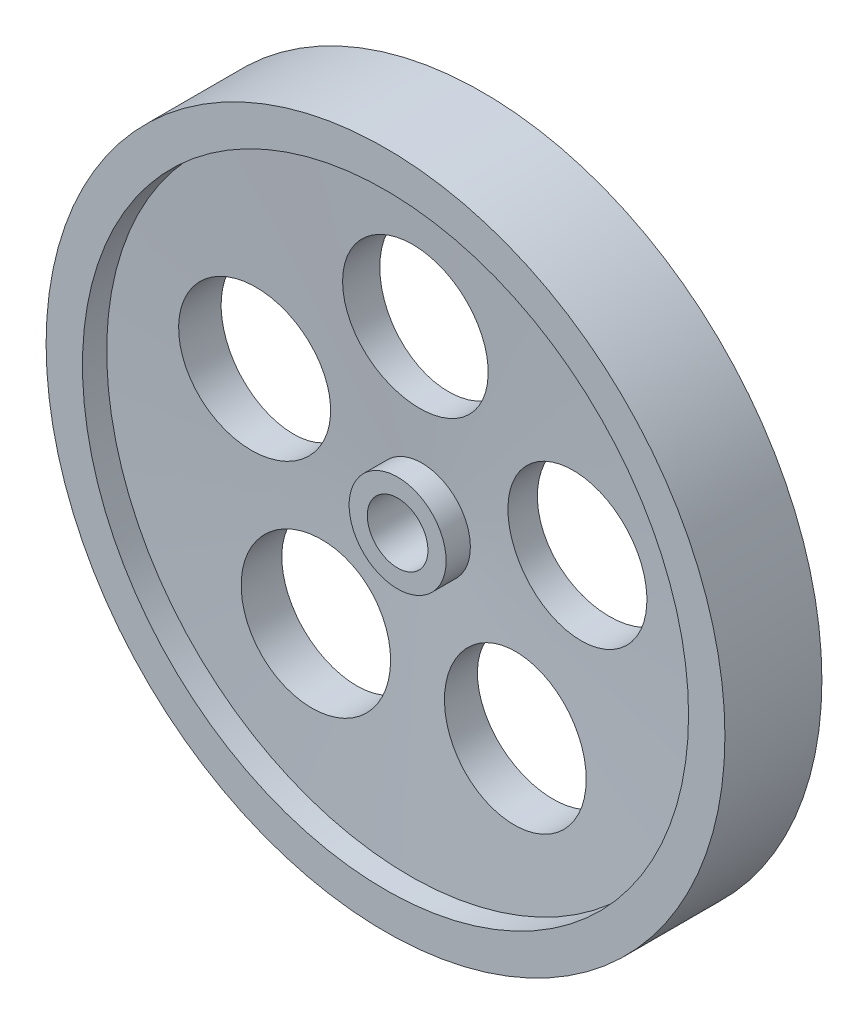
ISO-10303-21;
HEADER;
FILE_DESCRIPTION(('STEP AP214'),'2;1');
FILE_NAME('part.step','',(''),(''),'','','');
FILE_SCHEMA(('AUTOMOTIVE_DESIGN { 1 0 10303 214 1 1 1 1 }'));
ENDSEC;
DATA;
#1=APPLICATION_CONTEXT('core data for automotive mechanical design processes');
#2=APPLICATION_PROTOCOL_DEFINITION('international standard','automotive_design',2000,#1);
#3=PRODUCT_CONTEXT('',#1,'mechanical');
#4=PRODUCT('Part','Part','',(#3));
#5=PRODUCT_RELATED_PRODUCT_CATEGORY('part','',(#4));
#6=PRODUCT_DEFINITION_FORMATION('','',#4);
#7=PRODUCT_DEFINITION_CONTEXT('part definition',#1,'design');
#8=PRODUCT_DEFINITION('design','',#6,#7);
#9=PRODUCT_DEFINITION_SHAPE('','',#8);
#10=(LENGTH_UNIT() NAMED_UNIT(*) SI_UNIT(.MILLI.,.METRE.));
#11=(NAMED_UNIT(*) PLANE_ANGLE_UNIT() SI_UNIT($,.RADIAN.));
#12=(NAMED_UNIT(*) SI_UNIT($,.STERADIAN.) SOLID_ANGLE_UNIT());
#13=UNCERTAINTY_MEASURE_WITH_UNIT(LENGTH_MEASURE(1.E-05),#10,'distance_accuracy_value','');
#14=(GEOMETRIC_REPRESENTATION_CONTEXT(3) GLOBAL_UNCERTAINTY_ASSIGNED_CONTEXT((#13)) GLOBAL_UNIT_ASSIGNED_CONTEXT((#10,
#11,#12)) REPRESENTATION_CONTEXT('',''));
#15=CARTESIAN_POINT('',(0.,0.,0.));
#16=DIRECTION('',(0.,0.,1.));
#17=DIRECTION('',(1.,0.,0.));
#18=AXIS2_PLACEMENT_3D('',#15,#16,#17);
#19=CARTESIAN_POINT('',(0.,0.,22.1514215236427));
#20=DIRECTION('',(0.,0.,1.));
#21=DIRECTION('',(1.,0.,0.));
#22=AXIS2_PLACEMENT_3D('',#19,#20,#21);
#23=CYLINDRICAL_SURFACE('',#22,25.4);
#24=CARTESIAN_POINT('',(0.,0.,19.05));
#25=DIRECTION('',(0.,0.,1.));
#26=DIRECTION('',(1.,0.,0.));
#27=AXIS2_PLACEMENT_3D('',#24,#25,#26);
#28=CIRCLE('',#27,25.4);
#29=CARTESIAN_POINT('',(25.4,0.,19.05));
#30=VERTEX_POINT('',#29);
#31=EDGE_CURVE('E10',#30,#30,#28,.T.);
#32=ORIENTED_EDGE('',*,*,#31,.F.);
#33=EDGE_LOOP('',(#32));
#34=FACE_BOUND('',#33,.T.);
#35=CARTESIAN_POINT('',(0.,0.,6.35));
#36=DIRECTION('',(0.,0.,1.));
#37=DIRECTION('',(1.,0.,0.));
#38=AXIS2_PLACEMENT_3D('',#35,#36,#37);
#39=CIRCLE('',#38,25.4);
#40=CARTESIAN_POINT('',(25.4,0.,6.35));
#41=VERTEX_POINT('',#40);
#42=EDGE_CURVE('E75',#41,#41,#39,.T.);
#43=ORIENTED_EDGE('',*,*,#42,.T.);
#44=EDGE_LOOP('',(#43));
#45=FACE_BOUND('',#44,.T.);
#46=ADVANCED_FACE('F24',(#34,#45),#23,.T.);
#47=CARTESIAN_POINT('',(0.,15.875,19.05));
#48=DIRECTION('',(0.,0.,-1.));
#49=DIRECTION('',(-1.,0.,0.));
#50=AXIS2_PLACEMENT_3D('',#47,#48,#49);
#51=PLANE('',#50);
#52=CARTESIAN_POINT('',(0.,0.,19.05));
#53=DIRECTION('',(0.,0.,1.));
#54=DIRECTION('',(1.,0.,0.));
#55=AXIS2_PLACEMENT_3D('',#52,#53,#54);
#56=CIRCLE('',#55,15.875);
#57=CARTESIAN_POINT('',(15.875,0.,19.05));
#58=VERTEX_POINT('',#57);
#59=EDGE_CURVE('E35',#58,#58,#56,.T.);
#60=ORIENTED_EDGE('',*,*,#59,.F.);
#61=EDGE_LOOP('',(#60));
#62=FACE_BOUND('',#61,.T.);
#63=ORIENTED_EDGE('',*,*,#31,.T.);
#64=EDGE_LOOP('',(#63));
#65=FACE_BOUND('',#64,.T.);
#66=ADVANCED_FACE('F145',(#62,#65),#51,.F.);
#67=CARTESIAN_POINT('',(0.,0.,22.1514215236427));
#68=DIRECTION('',(0.,0.,1.));
#69=DIRECTION('',(1.,0.,0.));
#70=AXIS2_PLACEMENT_3D('',#67,#68,#69);
#71=CYLINDRICAL_SURFACE('',#70,15.875);
#72=CARTESIAN_POINT('',(0.,0.,-19.05));
#73=DIRECTION('',(0.,0.,1.));
#74=DIRECTION('',(1.,0.,0.));
#75=AXIS2_PLACEMENT_3D('',#72,#73,#74);
#76=CIRCLE('',#75,15.875);
#77=CARTESIAN_POINT('',(15.875,0.,-19.05));
#78=VERTEX_POINT('',#77);
#79=EDGE_CURVE('E40',#78,#78,#76,.T.);
#80=ORIENTED_EDGE('',*,*,#79,.F.);
#81=EDGE_LOOP('',(#80));
#82=FACE_BOUND('',#81,.T.);
#83=ORIENTED_EDGE('',*,*,#59,.T.);
#84=EDGE_LOOP('',(#83));
#85=FACE_BOUND('',#84,.T.);
#86=ADVANCED_FACE('F150',(#82,#85),#71,.F.);
#87=CARTESIAN_POINT('',(0.,15.875,-19.05));
#88=DIRECTION('',(0.,0.,1.));
#89=DIRECTION('',(1.,0.,0.));
#90=AXIS2_PLACEMENT_3D('',#87,#88,#89);
#91=PLANE('',#90);
#92=CARTESIAN_POINT('',(0.,0.,-19.05));
#93=DIRECTION('',(0.,0.,1.));
#94=DIRECTION('',(1.,0.,0.));
#95=AXIS2_PLACEMENT_3D('',#92,#93,#94);
#96=CIRCLE('',#95,25.4);
#97=CARTESIAN_POINT('',(25.4,0.,-19.05));
#98=VERTEX_POINT('',#97);
#99=EDGE_CURVE('E179',#98,#98,#96,.T.);
#100=ORIENTED_EDGE('',*,*,#99,.F.);
#101=EDGE_LOOP('',(#100));
#102=FACE_BOUND('',#101,.T.);
#103=ORIENTED_EDGE('',*,*,#79,.T.);
#104=EDGE_LOOP('',(#103));
#105=FACE_BOUND('',#104,.T.);
#106=ADVANCED_FACE('F184',(#102,#105),#91,.F.);
#107=CARTESIAN_POINT('',(0.,0.,22.1514215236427));
#108=DIRECTION('',(0.,0.,1.));
#109=DIRECTION('',(1.,0.,0.));
#110=AXIS2_PLACEMENT_3D('',#107,#108,#109);
#111=CYLINDRICAL_SURFACE('',#110,25.4);
#112=CARTESIAN_POINT('',(0.,0.,-6.35));
#113=DIRECTION('',(0.,0.,1.));
#114=DIRECTION('',(1.,0.,0.));
#115=AXIS2_PLACEMENT_3D('',#112,#113,#114);
#116=CIRCLE('',#115,25.4);
#117=CARTESIAN_POINT('',(25.4,0.,-6.35));
#118=VERTEX_POINT('',#117);
#119=EDGE_CURVE('E176',#118,#118,#116,.T.);
#120=ORIENTED_EDGE('',*,*,#119,.F.);
#121=EDGE_LOOP('',(#120));
#122=FACE_BOUND('',#121,.T.);
#123=ORIENTED_EDGE('',*,*,#99,.T.);
#124=EDGE_LOOP('',(#123));
#125=FACE_BOUND('',#124,.T.);
#126=ADVANCED_FACE('F86',(#122,#125),#111,.T.);
#127=CARTESIAN_POINT('',(0.,0.,-6.35));
#128=DIRECTION('',(0.,0.,-1.));
#129=DIRECTION('',(-1.,0.,0.));
#130=AXIS2_PLACEMENT_3D('',#127,#128,#129);
#131=CONICAL_SURFACE('',#130,25.4,1.52321322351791);
#132=CARTESIAN_POINT('',(-111.467946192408,0.509113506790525,-10.4485289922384));
#133=CARTESIAN_POINT('',(-110.709828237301,-0.247792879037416,-10.4122637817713));
#134=CARTESIAN_POINT('',(-109.919879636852,-0.972583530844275,-10.3748541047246));
#135=CARTESIAN_POINT('',(-108.281533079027,-2.35322601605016,-10.2978486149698));
#136=CARTESIAN_POINT('',(-107.43311975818,-3.00905961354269,-10.2582522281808));
#137=CARTESIAN_POINT('',(-105.683156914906,-4.24754186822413,-10.1769755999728));
#138=CARTESIAN_POINT('',(-104.781549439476,-4.83010845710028,-10.1352930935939));
#139=CARTESIAN_POINT('',(-102.932536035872,-5.91705165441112,-10.0500368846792));
#140=CARTESIAN_POINT('',(-101.985133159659,-6.42143346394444,-10.0064633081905));
#141=CARTESIAN_POINT('',(-100.051698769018,-7.34825040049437,-9.91760907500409));
#142=CARTESIAN_POINT('',(-99.0656860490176,-7.77072481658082,-9.87232924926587));
#143=CARTESIAN_POINT('',(-97.0616072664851,-8.53104721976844,-9.78022385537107));
#144=CARTESIAN_POINT('',(-96.0435406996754,-8.86889387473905,-9.73339826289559));
#145=CARTESIAN_POINT('',(-93.9828757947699,-9.45748972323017,-9.6384151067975));
#146=CARTESIAN_POINT('',(-92.9402837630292,-9.70826105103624,-9.59025788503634));
#147=CARTESIAN_POINT('',(-90.8377321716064,-10.1210570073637,-9.49282279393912));
#148=CARTESIAN_POINT('',(-89.7777726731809,-10.2830819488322,-9.44354492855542));
#149=CARTESIAN_POINT('',(-87.6473875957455,-10.5173158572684,-9.3440867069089));
#150=CARTESIAN_POINT('',(-86.5769562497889,-10.5894721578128,-9.29390583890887));
#151=CARTESIAN_POINT('',(-84.4338481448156,-10.643290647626,-9.19294639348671));
#152=CARTESIAN_POINT('',(-83.3611713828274,-10.6249527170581,-9.14216781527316));
#153=CARTESIAN_POINT('',(-81.2211507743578,-10.4979155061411,-9.04032095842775));
#154=CARTESIAN_POINT('',(-80.1538071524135,-10.3892124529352,-8.98925266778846));
#155=CARTESIAN_POINT('',(-78.0320804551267,-10.0822137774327,-8.88717729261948));
#156=CARTESIAN_POINT('',(-76.9776973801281,-9.88391815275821,-8.83617020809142));
#157=CARTESIAN_POINT('',(-74.8889810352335,-9.39904682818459,-8.73459128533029));
#158=CARTESIAN_POINT('',(-73.8546555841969,-9.11243740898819,-8.68401962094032));
#159=CARTESIAN_POINT('',(-71.813821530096,-8.45299255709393,-8.58377649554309));
#160=CARTESIAN_POINT('',(-70.8073129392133,-8.0801570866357,-8.53410503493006));
#161=CARTESIAN_POINT('',(-68.8292673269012,-7.25089589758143,-8.43616528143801));
#162=CARTESIAN_POINT('',(-67.8577303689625,-6.79447002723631,-8.38789699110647));
#163=CARTESIAN_POINT('',(-65.9565415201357,-5.80125428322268,-8.29333026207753));
#164=CARTESIAN_POINT('',(-65.0268896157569,-5.26446443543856,-8.24703182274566));
#165=CARTESIAN_POINT('',(-63.2163290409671,-4.1144657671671,-8.15705009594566));
#166=CARTESIAN_POINT('',(-62.3354075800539,-3.50127713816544,-8.11336612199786));
#167=CARTESIAN_POINT('',(-60.6283208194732,-2.20270196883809,-8.02929835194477));
#168=CARTESIAN_POINT('',(-59.8021555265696,-1.51731541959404,-7.98891455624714));
#169=CARTESIAN_POINT('',(-58.2104851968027,-0.0791971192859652,-7.91220159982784));
#170=CARTESIAN_POINT('',(-57.4449797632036,0.673534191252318,-7.87587241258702));
#171=CARTESIAN_POINT('',(-55.9801022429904,2.24101204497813,-7.8080571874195));
#172=CARTESIAN_POINT('',(-55.2807300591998,3.0557584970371,-7.7765711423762));
#173=CARTESIAN_POINT('',(-53.9542114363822,4.74011581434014,-7.71927533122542));
#174=CARTESIAN_POINT('',(-53.326950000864,5.60963580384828,-7.69345646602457));
#175=CARTESIAN_POINT('',(-52.1478472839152,7.3985486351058,-7.64815869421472));
#176=CARTESIAN_POINT('',(-51.5960059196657,8.31794142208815,-7.62867978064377));
#177=CARTESIAN_POINT('',(-50.5717211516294,10.2000302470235,-7.5966708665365));
#178=CARTESIAN_POINT('',(-50.0992759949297,11.1627253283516,-7.58414071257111));
#179=CARTESIAN_POINT('',(-49.2371682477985,13.1245594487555,-7.56645043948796));
#180=CARTESIAN_POINT('',(-48.847505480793,14.1236984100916,-7.5612903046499));
#181=CARTESIAN_POINT('',(-48.1547521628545,16.1483705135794,-7.55852500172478));
#182=CARTESIAN_POINT('',(-47.8514175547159,17.1738201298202,-7.56089830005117));
#183=CARTESIAN_POINT('',(-47.3319971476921,19.246538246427,-7.57306935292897));
#184=CARTESIAN_POINT('',(-47.1159111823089,20.2938067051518,-7.58286709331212));
#185=CARTESIAN_POINT('',(-46.7725083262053,22.4027101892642,-7.60955270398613));
#186=CARTESIAN_POINT('',(-46.6451917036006,23.4643452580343,-7.62644059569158));
#187=CARTESIAN_POINT('',(-46.4802056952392,25.5944342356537,-7.66676513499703));
#188=CARTESIAN_POINT('',(-46.4425363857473,26.6628881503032,-7.69020178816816));
#189=CARTESIAN_POINT('',(-46.4570752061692,28.7986744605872,-7.74292970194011));
#190=CARTESIAN_POINT('',(-46.509252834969,29.8660071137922,-7.77221897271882));
#191=CARTESIAN_POINT('',(-46.7030198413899,31.9923693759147,-7.83589533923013));
#192=CARTESIAN_POINT('',(-46.8446091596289,33.0513989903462,-7.87028243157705));
#193=CARTESIAN_POINT('',(-47.2161640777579,35.1536973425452,-7.94337301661));
#194=CARTESIAN_POINT('',(-47.4461305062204,36.1969659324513,-7.98207654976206));
#195=CARTESIAN_POINT('',(-47.992783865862,38.2603892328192,-8.06303991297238));
#196=CARTESIAN_POINT('',(-48.3094709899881,39.2805438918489,-8.105299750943));
#197=CARTESIAN_POINT('',(-49.0282950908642,41.2933344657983,-8.19278436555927));
#198=CARTESIAN_POINT('',(-49.4306648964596,42.2858868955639,-8.23801698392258));
#199=CARTESIAN_POINT('',(-50.3174600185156,44.2335255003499,-8.330687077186));
#200=CARTESIAN_POINT('',(-50.8018854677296,45.1886116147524,-8.37812455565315));
#201=CARTESIAN_POINT('',(-51.84935059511,47.0545789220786,-8.47461567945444));
#202=CARTESIAN_POINT('',(-52.4123908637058,47.9654597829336,-8.52366933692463));
#203=CARTESIAN_POINT('',(-53.6130877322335,49.7365754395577,-8.62286809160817));
#204=CARTESIAN_POINT('',(-54.2507443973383,50.5968101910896,-8.6730131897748));
#205=CARTESIAN_POINT('',(-55.5974357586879,52.262137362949,-8.77402614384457));
#206=CARTESIAN_POINT('',(-56.3066037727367,53.0671219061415,-8.82489519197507));
#207=CARTESIAN_POINT('',(-57.7902665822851,54.6144386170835,-8.92684903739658));
#208=CARTESIAN_POINT('',(-58.5647614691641,55.3567706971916,-8.97793383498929));
#209=CARTESIAN_POINT('',(-60.173579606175,56.7735123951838,-9.0799531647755));
#210=CARTESIAN_POINT('',(-61.0079030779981,57.4479217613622,-9.13088769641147));
#211=CARTESIAN_POINT('',(-62.7304504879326,58.7240203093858,-9.23228113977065));
#212=CARTESIAN_POINT('',(-63.6186744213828,59.3257094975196,-9.28274005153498));
#213=CARTESIAN_POINT('',(-65.4431272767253,60.4523403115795,-9.3829152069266));
#214=CARTESIAN_POINT('',(-66.379377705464,60.9772471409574,-9.43263110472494));
#215=CARTESIAN_POINT('',(-68.2928577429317,61.9462448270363,-9.53103743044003));
#216=CARTESIAN_POINT('',(-69.2700873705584,62.3903356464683,-9.57972785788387));
#217=CARTESIAN_POINT('',(-71.2585744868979,63.1945278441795,-9.67585022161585));
#218=CARTESIAN_POINT('',(-72.2698319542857,63.5546292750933,-9.72328215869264));
#219=CARTESIAN_POINT('',(-74.319179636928,64.1882644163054,-9.81667762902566));
#220=CARTESIAN_POINT('',(-75.3572698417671,64.4617981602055,-9.86264116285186));
#221=CARTESIAN_POINT('',(-77.4525605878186,64.9202605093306,-9.95289576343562));
#222=CARTESIAN_POINT('',(-78.5097549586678,65.1052172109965,-9.99718735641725));
#223=CARTESIAN_POINT('',(-80.6360498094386,65.3853195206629,-10.0839417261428));
#224=CARTESIAN_POINT('',(-81.7051502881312,65.4804651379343,-10.1264045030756));
#225=CARTESIAN_POINT('',(-83.8476419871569,65.580248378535,-10.2093453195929));
#226=CARTESIAN_POINT('',(-84.9210332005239,65.5848861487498,-10.2498233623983));
#227=CARTESIAN_POINT('',(-87.0644596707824,65.50360129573,-10.3286532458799));
#228=CARTESIAN_POINT('',(-88.1344949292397,65.4176787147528,-10.3670050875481));
#229=CARTESIAN_POINT('',(-90.2629012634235,65.1559495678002,-10.4414303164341));
#230=CARTESIAN_POINT('',(-91.3212793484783,64.9802004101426,-10.4775051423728));
#231=CARTESIAN_POINT('',(-93.4195258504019,64.5400813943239,-10.5472867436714));
#232=CARTESIAN_POINT('',(-94.4593942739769,64.2757115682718,-10.5809935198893));
#233=CARTESIAN_POINT('',(-96.5132063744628,63.6602166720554,-10.6459337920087));
#234=CARTESIAN_POINT('',(-97.5271501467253,63.3090919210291,-10.6771672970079));
#235=CARTESIAN_POINT('',(-99.5218867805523,62.5225707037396,-10.7370665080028));
#236=CARTESIAN_POINT('',(-100.502679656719,62.0871742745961,-10.7657322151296));
#237=CARTESIAN_POINT('',(-102.423440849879,61.1355319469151,-10.8203918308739));
#238=CARTESIAN_POINT('',(-103.363437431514,60.6193432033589,-10.8463876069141));
#239=CARTESIAN_POINT('',(-105.196640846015,59.509554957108,-10.8956552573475));
#240=CARTESIAN_POINT('',(-106.089847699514,58.9159554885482,-10.9189271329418));
#241=CARTESIAN_POINT('',(-107.823103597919,57.6555596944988,-10.962680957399));
#242=CARTESIAN_POINT('',(-108.663152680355,56.9887634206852,-10.9831629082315));
#243=CARTESIAN_POINT('',(-110.28410327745,55.5867111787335,-11.021279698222));
#244=CARTESIAN_POINT('',(-111.065004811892,54.8514552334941,-11.0389145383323));
#245=CARTESIAN_POINT('',(-112.561637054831,53.3181762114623,-11.0712786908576));
#246=CARTESIAN_POINT('',(-113.277406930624,52.520191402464,-11.0860097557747));
#247=CARTESIAN_POINT('',(-114.639207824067,50.8667371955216,-11.1125395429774));
#248=CARTESIAN_POINT('',(-115.285238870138,50.0112678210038,-11.1243382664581));
#249=CARTESIAN_POINT('',(-116.502958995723,48.2489263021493,-11.1449715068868));
#250=CARTESIAN_POINT('',(-117.074648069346,47.34205415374,-11.1538060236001));
#251=CARTESIAN_POINT('',(-118.139610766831,45.483357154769,-11.1684871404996));
#252=CARTESIAN_POINT('',(-118.632884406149,44.531532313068,-11.1743337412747));
#253=CARTESIAN_POINT('',(-119.537332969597,42.5900651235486,-11.1830217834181));
#254=CARTESIAN_POINT('',(-119.948538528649,41.6004370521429,-11.1858643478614));
#255=CARTESIAN_POINT('',(-120.686155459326,39.5900653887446,-11.1885406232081));
#256=CARTESIAN_POINT('',(-121.012566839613,38.5693217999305,-11.1883743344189));
#257=CARTESIAN_POINT('',(-121.57826295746,36.5040193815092,-11.1850334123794));
#258=CARTESIAN_POINT('',(-121.817551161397,35.4594615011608,-11.1818588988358));
#259=CARTESIAN_POINT('',(-122.207319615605,33.3539204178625,-11.1725101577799));
#260=CARTESIAN_POINT('',(-122.357799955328,32.2929372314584,-11.1663359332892));
#261=CARTESIAN_POINT('',(-122.5688637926,30.162327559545,-11.1510059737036));
#262=CARTESIAN_POINT('',(-122.629467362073,29.0927030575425,-11.1418509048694));
#263=CARTESIAN_POINT('',(-122.660417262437,26.9521745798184,-11.1205833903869));
#264=CARTESIAN_POINT('',(-122.630763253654,25.8812705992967,-11.1084709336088));
#265=CARTESIAN_POINT('',(-122.481397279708,23.7455254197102,-11.0813179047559));
#266=CARTESIAN_POINT('',(-122.361662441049,22.680685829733,-11.0662765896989));
#267=CARTESIAN_POINT('',(-122.032972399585,20.5649299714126,-11.0333090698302));
#268=CARTESIAN_POINT('',(-121.824018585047,19.5140134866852,-11.01538290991));
#269=CARTESIAN_POINT('',(-121.318228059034,17.4328996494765,-10.976682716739));
#270=CARTESIAN_POINT('',(-121.021336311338,16.4027157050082,-10.9559069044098));
#271=CARTESIAN_POINT('',(-120.341825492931,14.3710105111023,-10.9115727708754));
#272=CARTESIAN_POINT('',(-119.959200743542,13.3694911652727,-10.8880142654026));
#273=CARTESIAN_POINT('',(-119.111425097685,11.4033733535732,-10.8382095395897));
#274=CARTESIAN_POINT('',(-118.646365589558,10.4387354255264,-10.8119663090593));
#275=CARTESIAN_POINT('',(-117.636938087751,8.55237044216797,-10.7568562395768));
#276=CARTESIAN_POINT('',(-117.092590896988,7.63063221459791,-10.727990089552));
#277=CARTESIAN_POINT('',(-115.782339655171,5.6113268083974,-10.6601535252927));
#278=CARTESIAN_POINT('',(-114.99509239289,4.5275474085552,-10.620463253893));
#279=CARTESIAN_POINT('',(-113.31107918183,2.44886806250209,-10.537286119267));
#280=CARTESIAN_POINT('',(-112.414313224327,1.45396812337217,-10.4937992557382));
#281=CARTESIAN_POINT('',(-111.467946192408,0.509113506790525,-10.4485289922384));
#282=B_SPLINE_CURVE_WITH_KNOTS('',3,(#132,#133,#134,#135,#136,#137,#138,#139,#140,#141,#142,
#143,#144,#145,#146,#147,#148,#149,#150,#151,#152,#153,#154,#155,#156,#157,#158,#159,#160,#161,
#162,#163,#164,#165,#166,#167,#168,#169,#170,#171,#172,#173,#174,#175,#176,#177,#178,#179,#180,
#181,#182,#183,#184,#185,#186,#187,#188,#189,#190,#191,#192,#193,#194,#195,#196,#197,#198,#199,
#200,#201,#202,#203,#204,#205,#206,#207,#208,#209,#210,#211,#212,#213,#214,#215,#216,#217,#218,
#219,#220,#221,#222,#223,#224,#225,#226,#227,#228,#229,#230,#231,#232,#233,#234,#235,#236,#237,
#238,#239,#240,#241,#242,#243,#244,#245,#246,#247,#248,#249,#250,#251,#252,#253,#254,#255,#256,
#257,#258,#259,#260,#261,#262,#263,#264,#265,#266,#267,#268,#269,#270,#271,#272,#273,#274,#275,
#276,#277,#278,#279,#280,#281),.UNSPECIFIED.,.T.,.F.,(4,2,2,2,2,2,2,2,2,2,2,2,2,2,2,2,2,2,2,2,2,
2,2,2,2,2,2,2,2,2,2,2,2,2,2,2,2,2,2,2,2,2,2,2,2,2,2,2,2,2,2,2,2,2,2,2,2,2,2,2,2,2,2,2,2,2,2,2,2,
2,2,2,2,2,4),(0.,3.21452385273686,6.42989566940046,9.6488376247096,12.8675653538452,
16.0847452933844,19.3019758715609,22.5183880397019,25.7347888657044,28.9530737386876,
32.1713628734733,35.3897863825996,38.608209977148,41.8278639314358,45.0475192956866,
48.2671805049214,51.4868406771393,54.7056517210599,57.9244631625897,61.1432535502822,
64.3620392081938,67.5756184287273,70.7891941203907,74.0026988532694,77.2161967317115,
80.4205174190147,83.6248319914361,86.8291562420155,90.033483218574,93.2367226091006,
96.4399598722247,99.6432271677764,102.846501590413,106.058594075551,109.270691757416,
112.482813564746,115.694938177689,118.913165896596,122.131398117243,125.34964226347,
128.567886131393,131.78758396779,135.007283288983,138.226980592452,141.446676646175,
144.665350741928,147.884024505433,151.102693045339,154.321360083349,157.53797263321,
160.754584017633,163.971183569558,167.187781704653,170.402114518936,173.616445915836,
176.830775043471,180.045103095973,183.257485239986,186.469866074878,189.682247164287,
192.894627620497,196.105806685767,199.316985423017,202.52803638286,205.739084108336,
208.949414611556,212.159757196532,215.370915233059,218.582023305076,221.795145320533,
225.008480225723,228.218274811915,231.427228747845,235.439954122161,239.452679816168),.UNSPECIFIED.);
#283=CARTESIAN_POINT('',(-111.467946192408,0.509113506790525,-10.4485289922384));
#284=VERTEX_POINT('',#283);
#285=EDGE_CURVE('E106',#284,#284,#282,.T.);
#286=ORIENTED_EDGE('',*,*,#285,.T.);
#287=EDGE_LOOP('',(#286));
#288=FACE_BOUND('',#287,.T.);
#289=CARTESIAN_POINT('',(-79.2008477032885,-98.8564074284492,-11.1723949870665));
#290=CARTESIAN_POINT('',(-78.4445046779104,-99.6130968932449,-11.1779963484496));
#291=CARTESIAN_POINT('',(-77.6563501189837,-100.3378189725,-11.1821014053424));
#292=CARTESIAN_POINT('',(-76.0215927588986,-101.718615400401,-11.1873110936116));
#293=CARTESIAN_POINT('',(-75.1749747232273,-102.37467174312,-11.1884149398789));
#294=CARTESIAN_POINT('',(-73.428579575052,-103.613873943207,-11.1876159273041));
#295=CARTESIAN_POINT('',(-72.5287449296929,-104.196938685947,-11.1857097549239));
#296=CARTESIAN_POINT('',(-70.6832167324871,-105.285144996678,-11.1788899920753));
#297=CARTESIAN_POINT('',(-69.7375262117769,-105.790291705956,-11.1739766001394));
#298=CARTESIAN_POINT('',(-67.8074077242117,-106.718899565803,-11.1611585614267));
#299=CARTESIAN_POINT('',(-66.8229975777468,-107.142397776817,-11.1532552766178));
#300=CARTESIAN_POINT('',(-64.8220213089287,-107.904995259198,-11.1344782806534));
#301=CARTESIAN_POINT('',(-63.8054546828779,-108.244093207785,-11.1236045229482));
#302=CARTESIAN_POINT('',(-61.7476721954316,-108.83540222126,-11.098919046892));
#303=CARTESIAN_POINT('',(-60.7064626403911,-109.087635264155,-11.0851080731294));
#304=CARTESIAN_POINT('',(-58.6065512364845,-109.503549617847,-11.0545840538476));
#305=CARTESIAN_POINT('',(-57.5478494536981,-109.667231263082,-11.0378710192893));
#306=CARTESIAN_POINT('',(-55.420239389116,-109.904918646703,-11.0015846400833));
#307=CARTESIAN_POINT('',(-54.3513289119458,-109.978904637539,-10.982010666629));
#308=CARTESIAN_POINT('',(-52.2111281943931,-110.036622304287,-10.9400594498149));
#309=CARTESIAN_POINT('',(-51.139837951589,-110.02035388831,-10.9176822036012));
#310=CARTESIAN_POINT('',(-49.0024486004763,-109.897690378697,-10.8701865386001));
#311=CARTESIAN_POINT('',(-47.9363496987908,-109.791291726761,-10.8450680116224));
#312=CARTESIAN_POINT('',(-45.8169586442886,-109.489135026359,-10.7921625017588));
#313=CARTESIAN_POINT('',(-44.7636664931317,-109.293376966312,-10.764375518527));
#314=CARTESIAN_POINT('',(-42.6769525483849,-108.813813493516,-10.7062028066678));
#315=CARTESIAN_POINT('',(-41.6435388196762,-108.529973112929,-10.6758160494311));
#316=CARTESIAN_POINT('',(-39.6043526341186,-107.876305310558,-10.6125443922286));
#317=CARTESIAN_POINT('',(-38.5985801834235,-107.50647786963,-10.5796594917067));
#318=CARTESIAN_POINT('',(-36.6218163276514,-106.683481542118,-10.5114928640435));
#319=CARTESIAN_POINT('',(-35.6508249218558,-106.230312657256,-10.4762111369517));
#320=CARTESIAN_POINT('',(-33.7505118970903,-105.243870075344,-10.4033630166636));
#321=CARTESIAN_POINT('',(-32.8211902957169,-104.710596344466,-10.3657966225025));
#322=CARTESIAN_POINT('',(-31.0102448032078,-103.567393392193,-10.2884789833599));
#323=CARTESIAN_POINT('',(-30.1286508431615,-102.957416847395,-10.2487263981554));
#324=CARTESIAN_POINT('',(-28.4200371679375,-101.665419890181,-10.1671943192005));
#325=CARTESIAN_POINT('',(-27.5930174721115,-100.983399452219,-10.1254148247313));
#326=CARTESIAN_POINT('',(-25.9994158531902,-99.5521751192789,-10.039979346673));
#327=CARTESIAN_POINT('',(-25.2328339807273,-98.8029711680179,-9.9963233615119));
#328=CARTESIAN_POINT('',(-23.7655408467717,-97.2427151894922,-9.9073006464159));
#329=CARTESIAN_POINT('',(-23.0648296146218,-96.4316631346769,-9.8619339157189));
#330=CARTESIAN_POINT('',(-21.7337703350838,-94.7528885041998,-9.76963988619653));
#331=CARTESIAN_POINT('',(-21.1034723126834,-93.8851263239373,-9.72271150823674));
#332=CARTESIAN_POINT('',(-19.9182771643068,-92.0996226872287,-9.62752705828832));
#333=CARTESIAN_POINT('',(-19.3633800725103,-91.181881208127,-9.57927098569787));
#334=CARTESIAN_POINT('',(-18.3329159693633,-89.3029438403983,-9.48165536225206));
#335=CARTESIAN_POINT('',(-17.8573492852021,-88.3417477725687,-9.43229580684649));
#336=CARTESIAN_POINT('',(-16.9889166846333,-86.3827377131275,-9.33272301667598));
#337=CARTESIAN_POINT('',(-16.5960507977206,-85.3849237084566,-9.2825097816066));
#338=CARTESIAN_POINT('',(-15.8955838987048,-83.359136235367,-9.18147688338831));
#339=CARTESIAN_POINT('',(-15.5880360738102,-82.3311443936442,-9.13065686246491));
#340=CARTESIAN_POINT('',(-15.0607107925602,-80.2529028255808,-9.02875406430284));
#341=CARTESIAN_POINT('',(-14.8409333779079,-79.2026530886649,-8.97767128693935));
#342=CARTESIAN_POINT('',(-14.490709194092,-77.0873563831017,-8.87559495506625));
#343=CARTESIAN_POINT('',(-14.3602626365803,-76.0223093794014,-8.82460140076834));
#344=CARTESIAN_POINT('',(-14.1896310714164,-73.8849861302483,-8.72310091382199));
#345=CARTESIAN_POINT('',(-14.1494460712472,-72.8127098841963,-8.67259398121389));
#346=CARTESIAN_POINT('',(-14.1596328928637,-70.6682521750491,-8.57250213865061));
#347=CARTESIAN_POINT('',(-14.210029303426,-69.5960708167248,-8.52291748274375));
#348=CARTESIAN_POINT('',(-14.4010826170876,-67.4597130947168,-8.42519195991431));
#349=CARTESIAN_POINT('',(-14.5417395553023,-66.3955367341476,-8.37705109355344));
#350=CARTESIAN_POINT('',(-14.9123346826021,-64.2827494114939,-8.28278456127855));
#351=CARTESIAN_POINT('',(-15.1422732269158,-63.2341385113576,-8.23665890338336));
#352=CARTESIAN_POINT('',(-15.6898220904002,-61.1599451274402,-8.14706154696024));
#353=CARTESIAN_POINT('',(-16.0074323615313,-60.1343626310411,-8.10358984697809));
#354=CARTESIAN_POINT('',(-16.7278966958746,-58.114085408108,-8.02002703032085));
#355=CARTESIAN_POINT('',(-17.1307036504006,-57.1193739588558,-7.97993406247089));
#356=CARTESIAN_POINT('',(-18.0188352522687,-55.1673324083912,-7.90385905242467));
#357=CARTESIAN_POINT('',(-18.5041598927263,-54.2100023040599,-7.86787700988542));
#358=CARTESIAN_POINT('',(-19.5539001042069,-52.3395667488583,-7.80081373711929));
#359=CARTESIAN_POINT('',(-20.1183147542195,-51.4264607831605,-7.76973244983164));
#360=CARTESIAN_POINT('',(-21.3222472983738,-49.6509942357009,-7.7132542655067));
#361=CARTESIAN_POINT('',(-21.96176505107,-48.7886335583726,-7.68785735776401));
#362=CARTESIAN_POINT('',(-23.3099595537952,-47.1225750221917,-7.64351854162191));
#363=CARTESIAN_POINT('',(-24.0184897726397,-46.3187589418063,-7.62456332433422));
#364=CARTESIAN_POINT('',(-25.5007895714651,-44.7735703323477,-7.59363044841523));
#365=CARTESIAN_POINT('',(-26.274559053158,-44.0321977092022,-7.58165277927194));
#366=CARTESIAN_POINT('',(-27.8818083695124,-42.6172203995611,-7.56507945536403));
#367=CARTESIAN_POINT('',(-28.7152870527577,-41.943614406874,-7.56048365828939));
#368=CARTESIAN_POINT('',(-30.436011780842,-40.6689784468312,-7.55883500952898));
#369=CARTESIAN_POINT('',(-31.3232577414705,-40.0679483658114,-7.56178214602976));
#370=CARTESIAN_POINT('',(-33.1427459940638,-38.9442536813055,-7.5750976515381));
#371=CARTESIAN_POINT('',(-34.0748625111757,-38.421385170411,-7.58544628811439));
#372=CARTESIAN_POINT('',(-35.9796266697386,-37.455811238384,-7.6131914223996));
#373=CARTESIAN_POINT('',(-36.9522742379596,-37.0131056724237,-7.63058790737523));
#374=CARTESIAN_POINT('',(-38.9311963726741,-36.2109694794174,-7.67187518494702));
#375=CARTESIAN_POINT('',(-39.9374712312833,-35.851539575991,-7.69576603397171));
#376=CARTESIAN_POINT('',(-41.9765040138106,-35.2184712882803,-7.74934983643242));
#377=CARTESIAN_POINT('',(-43.0092619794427,-34.9448330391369,-7.77904279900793));
#378=CARTESIAN_POINT('',(-45.0948022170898,-34.4850581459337,-7.84349246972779));
#379=CARTESIAN_POINT('',(-46.1476001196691,-34.2989929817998,-7.87825328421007));
#380=CARTESIAN_POINT('',(-48.2649563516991,-34.0159715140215,-7.95203772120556));
#381=CARTESIAN_POINT('',(-49.3295146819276,-33.9190152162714,-7.99106134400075));
#382=CARTESIAN_POINT('',(-51.4628873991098,-33.814859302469,-8.07261338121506));
#383=CARTESIAN_POINT('',(-52.5317018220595,-33.8076604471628,-8.11514182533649));
#384=CARTESIAN_POINT('',(-54.6660450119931,-33.8830402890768,-8.20299463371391));
#385=CARTESIAN_POINT('',(-55.731573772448,-33.9656191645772,-8.24831900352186));
#386=CARTESIAN_POINT('',(-57.8548212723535,-34.2203046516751,-8.34124774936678));
#387=CARTESIAN_POINT('',(-58.9125096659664,-34.3926620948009,-8.38885817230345));
#388=CARTESIAN_POINT('',(-61.0095485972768,-34.8258080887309,-8.48565539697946));
#389=CARTESIAN_POINT('',(-62.0488991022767,-35.0865967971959,-8.53484220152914));
#390=CARTESIAN_POINT('',(-64.1019113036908,-35.6947456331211,-8.63427173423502));
#391=CARTESIAN_POINT('',(-65.1155728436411,-36.0421062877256,-8.68451446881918));
#392=CARTESIAN_POINT('',(-67.1100245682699,-36.8209288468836,-8.78559428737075));
#393=CARTESIAN_POINT('',(-68.0908147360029,-37.2523907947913,-8.83643137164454));
#394=CARTESIAN_POINT('',(-70.0139766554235,-38.1970427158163,-8.93836586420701));
#395=CARTESIAN_POINT('',(-70.9562904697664,-38.7103506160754,-8.98946354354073));
#396=CARTESIAN_POINT('',(-72.7942897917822,-39.8145964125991,-9.09148253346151));
#397=CARTESIAN_POINT('',(-73.6899752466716,-40.4055343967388,-9.14240384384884));
#398=CARTESIAN_POINT('',(-75.4283519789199,-41.6608457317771,-9.24374776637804));
#399=CARTESIAN_POINT('',(-76.2710430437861,-42.3252193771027,-9.29417037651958));
#400=CARTESIAN_POINT('',(-77.8974302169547,-43.7226820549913,-9.39422923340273));
#401=CARTESIAN_POINT('',(-78.6811263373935,-44.4557710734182,-9.44386548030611));
#402=CARTESIAN_POINT('',(-80.1840794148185,-45.9855978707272,-9.54210341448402));
#403=CARTESIAN_POINT('',(-80.9033246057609,-46.7823472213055,-9.59070491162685));
#404=CARTESIAN_POINT('',(-82.2720861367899,-48.4337165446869,-9.68663292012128));
#405=CARTESIAN_POINT('',(-82.9216024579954,-49.2883365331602,-9.73395943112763));
#406=CARTESIAN_POINT('',(-84.1462697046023,-51.0493721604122,-9.82712920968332));
#407=CARTESIAN_POINT('',(-84.7214205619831,-51.9557878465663,-9.87297247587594));
#408=CARTESIAN_POINT('',(-85.7932449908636,-53.8139671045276,-9.9629874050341));
#409=CARTESIAN_POINT('',(-86.2899185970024,-54.7657306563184,-10.0071590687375));
#410=CARTESIAN_POINT('',(-87.201042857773,-56.707426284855,-10.0936420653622));
#411=CARTESIAN_POINT('',(-87.615527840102,-57.6973422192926,-10.1359541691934));
#412=CARTESIAN_POINT('',(-88.3595651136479,-59.7086752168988,-10.2185830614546));
#413=CARTESIAN_POINT('',(-88.689117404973,-60.7300922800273,-10.2588998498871));
#414=CARTESIAN_POINT('',(-89.260911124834,-62.7971148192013,-10.3373960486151));
#415=CARTESIAN_POINT('',(-89.5031561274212,-63.8427193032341,-10.3755755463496));
#416=CARTESIAN_POINT('',(-89.8986084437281,-65.9507101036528,-10.4496714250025));
#417=CARTESIAN_POINT('',(-90.0518158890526,-67.0130963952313,-10.4855878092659));
#418=CARTESIAN_POINT('',(-90.2679975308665,-69.1462473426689,-10.5550147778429));
#419=CARTESIAN_POINT('',(-90.3310422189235,-70.2170047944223,-10.5885272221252));
#420=CARTESIAN_POINT('',(-90.3666562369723,-72.3601022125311,-10.6530731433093));
#421=CARTESIAN_POINT('',(-90.3392252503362,-73.4324421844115,-10.6841066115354));
#422=CARTESIAN_POINT('',(-90.1940455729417,-75.571333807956,-10.7436081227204));
#423=CARTESIAN_POINT('',(-90.0762741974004,-76.6378839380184,-10.7720755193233));
#424=CARTESIAN_POINT('',(-89.7512111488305,-78.7573048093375,-10.8263516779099));
#425=CARTESIAN_POINT('',(-89.5439209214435,-79.8101757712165,-10.852160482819));
#426=CARTESIAN_POINT('',(-89.0413409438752,-81.894500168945,-10.9010395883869));
#427=CARTESIAN_POINT('',(-88.746072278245,-82.9259586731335,-10.9241105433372));
#428=CARTESIAN_POINT('',(-88.0695881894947,-84.9604270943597,-10.9674570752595));
#429=CARTESIAN_POINT('',(-87.6883671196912,-85.9634351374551,-10.9877324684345));
#430=CARTESIAN_POINT('',(-86.8431469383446,-87.9327063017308,-11.025408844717));
#431=CARTESIAN_POINT('',(-86.3792397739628,-88.899008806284,-11.0428129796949));
#432=CARTESIAN_POINT('',(-85.3718397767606,-90.7888435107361,-11.074721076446));
#433=CARTESIAN_POINT('',(-84.8283678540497,-91.7123868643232,-11.0892257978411));
#434=CARTESIAN_POINT('',(-83.5189614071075,-93.7370875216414,-11.1185882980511));
#435=CARTESIAN_POINT('',(-82.7314704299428,-94.8244025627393,-11.1326150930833));
#436=CARTESIAN_POINT('',(-81.0462493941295,-96.9100096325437,-11.1560092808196));
#437=CARTESIAN_POINT('',(-80.1485193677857,-97.9083016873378,-11.1653766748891));
#438=CARTESIAN_POINT('',(-79.2008477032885,-98.8564074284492,-11.1723949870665));
#439=B_SPLINE_CURVE_WITH_KNOTS('',3,(#289,#290,#291,#292,#293,#294,#295,#296,#297,#298,#299,
#300,#301,#302,#303,#304,#305,#306,#307,#308,#309,#310,#311,#312,#313,#314,#315,#316,#317,#318,
#319,#320,#321,#322,#323,#324,#325,#326,#327,#328,#329,#330,#331,#332,#333,#334,#335,#336,#337,
#338,#339,#340,#341,#342,#343,#344,#345,#346,#347,#348,#349,#350,#351,#352,#353,#354,#355,#356,
#357,#358,#359,#360,#361,#362,#363,#364,#365,#366,#367,#368,#369,#370,#371,#372,#373,#374,#375,
#376,#377,#378,#379,#380,#381,#382,#383,#384,#385,#386,#387,#388,#389,#390,#391,#392,#393,#394,
#395,#396,#397,#398,#399,#400,#401,#402,#403,#404,#405,#406,#407,#408,#409,#410,#411,#412,#413,
#414,#415,#416,#417,#418,#419,#420,#421,#422,#423,#424,#425,#426,#427,#428,#429,#430,#431,#432,
#433,#434,#435,#436,#437,#438),.UNSPECIFIED.,.T.,.F.,(4,2,2,2,2,2,2,2,2,2,2,2,2,2,2,2,2,2,2,2,2,
2,2,2,2,2,2,2,2,2,2,2,2,2,2,2,2,2,2,2,2,2,2,2,2,2,2,2,2,2,2,2,2,2,2,2,2,2,2,2,2,2,2,2,2,2,2,2,2,
2,2,2,2,2,4),(0.,3.20849990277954,6.41783906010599,9.63071363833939,12.8433761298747,
16.0545769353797,19.2658280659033,22.4762661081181,25.6866920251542,28.897824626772,
32.1089604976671,35.3202231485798,38.531486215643,41.7440257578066,44.9565660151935,
48.169106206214,51.3816477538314,54.5961811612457,57.810715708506,61.0252529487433,
64.2397916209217,67.4565997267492,70.6734092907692,73.890232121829,77.1070561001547,
80.3258809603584,83.5447073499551,86.7635413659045,89.9823756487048,93.2020838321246,
96.4217932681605,99.641515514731,102.861235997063,106.079180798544,109.297125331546,
112.515032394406,115.732933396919,118.944145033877,122.155351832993,125.366496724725,
128.57763658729,131.78024729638,134.982852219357,138.185484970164,141.3881227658,
144.593370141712,147.79861772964,151.00389248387,154.20917360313,157.42345834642,
160.637748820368,163.852058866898,167.066370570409,170.285356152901,173.504345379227,
176.723347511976,179.942348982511,183.161936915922,186.381525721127,189.601117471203,
192.820707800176,196.0389505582,199.257193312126,202.475304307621,205.693410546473,
208.9089994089,212.124599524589,215.341007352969,218.557363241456,221.772948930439,
224.98874593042,228.20098901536,231.412389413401,235.43253005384,239.452669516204),.UNSPECIFIED.);
#440=CARTESIAN_POINT('',(-79.2008477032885,-98.8564074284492,-11.1723949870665));
#441=VERTEX_POINT('',#440);
#442=EDGE_CURVE('E99',#441,#441,#439,.T.);
#443=ORIENTED_EDGE('',*,*,#442,.T.);
#444=EDGE_LOOP('',(#443));
#445=FACE_BOUND('',#444,.T.);
#446=CARTESIAN_POINT('',(25.299782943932,-98.8488147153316,-9.99929177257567));
#447=CARTESIAN_POINT('',(26.0563901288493,-99.6061952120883,-10.0431647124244));
#448=CARTESIAN_POINT('',(26.8448773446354,-100.331596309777,-10.0861468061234));
#449=CARTESIAN_POINT('',(28.48044768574,-101.713713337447,-10.1701946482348));
#450=CARTESIAN_POINT('',(29.3275459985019,-102.370411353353,-10.2112598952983));
#451=CARTESIAN_POINT('',(31.0750533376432,-103.610837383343,-10.2913569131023));
#452=CARTESIAN_POINT('',(31.9755197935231,-104.194484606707,-10.3303864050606));
#453=CARTESIAN_POINT('',(33.8224719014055,-105.283776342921,-10.4062295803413));
#454=CARTESIAN_POINT('',(34.7689545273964,-105.789425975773,-10.4430434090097));
#455=CARTESIAN_POINT('',(36.7008508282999,-106.71894908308,-10.5143227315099));
#456=CARTESIAN_POINT('',(37.6862479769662,-107.142856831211,-10.5487892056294));
#457=CARTESIAN_POINT('',(39.6893560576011,-107.906131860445,-10.6152828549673));
#458=CARTESIAN_POINT('',(40.7070674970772,-108.245497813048,-10.6473099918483));
#459=CARTESIAN_POINT('',(42.7672868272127,-108.837170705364,-10.7088186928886));
#460=CARTESIAN_POINT('',(43.8097883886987,-109.089499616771,-10.7383008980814));
#461=CARTESIAN_POINT('',(45.9124136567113,-109.505402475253,-10.7946409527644));
#462=CARTESIAN_POINT('',(46.9725372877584,-109.668976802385,-10.821498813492));
#463=CARTESIAN_POINT('',(49.1024356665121,-109.906142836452,-10.8725019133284));
#464=CARTESIAN_POINT('',(50.1722063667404,-109.979770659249,-10.8966482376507));
#465=CARTESIAN_POINT('',(52.3142073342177,-110.036624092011,-10.9421718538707));
#466=CARTESIAN_POINT('',(53.386437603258,-110.019849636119,-10.963549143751));
#467=CARTESIAN_POINT('',(55.5257623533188,-109.896001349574,-11.0034754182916));
#468=CARTESIAN_POINT('',(56.5928566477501,-109.788924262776,-11.0220243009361));
#469=CARTESIAN_POINT('',(58.7142707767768,-109.485216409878,-11.0562415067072));
#470=CARTESIAN_POINT('',(59.768590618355,-109.288585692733,-11.0719098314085));
#471=CARTESIAN_POINT('',(61.8563268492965,-108.807303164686,-11.1003146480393));
#472=CARTESIAN_POINT('',(62.8897552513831,-108.522703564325,-11.1130528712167));
#473=CARTESIAN_POINT('',(64.9289975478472,-107.867461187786,-11.1355748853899));
#474=CARTESIAN_POINT('',(65.9348114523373,-107.496818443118,-11.1453586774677));
#475=CARTESIAN_POINT('',(67.9116627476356,-106.672121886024,-11.1619455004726));
#476=CARTESIAN_POINT('',(68.8827002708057,-106.218068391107,-11.1687485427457));
#477=CARTESIAN_POINT('',(70.7830917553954,-105.229775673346,-11.1793557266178));
#478=CARTESIAN_POINT('',(71.7124457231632,-104.695536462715,-11.1831598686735));
#479=CARTESIAN_POINT('',(73.52254154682,-103.550870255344,-11.1877583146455));
#480=CARTESIAN_POINT('',(74.4033001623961,-102.940469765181,-11.1885536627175));
#481=CARTESIAN_POINT('',(76.1102900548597,-101.647675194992,-11.1871352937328));
#482=CARTESIAN_POINT('',(76.9365213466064,-100.965281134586,-11.1849215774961));
#483=CARTESIAN_POINT('',(78.528580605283,-99.5333547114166,-11.177490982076));
#484=CARTESIAN_POINT('',(79.2944087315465,-98.7838225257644,-11.1722741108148));
#485=CARTESIAN_POINT('',(80.7602214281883,-97.2229503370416,-11.1588511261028));
#486=CARTESIAN_POINT('',(81.4602059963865,-96.4116103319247,-11.1506450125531));
#487=CARTESIAN_POINT('',(82.78931432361,-94.7329514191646,-11.1312661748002));
#488=CARTESIAN_POINT('',(83.4184428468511,-93.8656362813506,-11.1200936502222));
#489=CARTESIAN_POINT('',(84.6014275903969,-92.0811479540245,-11.0948118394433));
#490=CARTESIAN_POINT('',(85.155283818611,-91.1639747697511,-11.080702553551));
#491=CARTESIAN_POINT('',(86.1837964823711,-89.2862929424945,-11.0495855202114));
#492=CARTESIAN_POINT('',(86.6584528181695,-88.3257842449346,-11.0325777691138));
#493=CARTESIAN_POINT('',(87.5252021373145,-86.3682633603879,-10.9957104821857));
#494=CARTESIAN_POINT('',(87.9172951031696,-85.3712511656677,-10.9758509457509));
#495=CARTESIAN_POINT('',(88.6162221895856,-83.3475858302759,-10.9333305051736));
#496=CARTESIAN_POINT('',(88.9230372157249,-82.3209261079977,-10.9106689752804));
#497=CARTESIAN_POINT('',(89.4491255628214,-80.245480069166,-10.8626119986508));
#498=CARTESIAN_POINT('',(89.6683988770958,-79.1966937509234,-10.8372165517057));
#499=CARTESIAN_POINT('',(90.0178617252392,-77.0844492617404,-10.7837646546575));
#500=CARTESIAN_POINT('',(90.148051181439,-76.020991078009,-10.7557082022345));
#501=CARTESIAN_POINT('',(90.3184384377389,-73.8869606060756,-10.6970165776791));
#502=CARTESIAN_POINT('',(90.3586362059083,-72.8163883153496,-10.6663814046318));
#503=CARTESIAN_POINT('',(90.3487704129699,-70.6752193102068,-10.6026090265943));
#504=CARTESIAN_POINT('',(90.2986634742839,-69.6046228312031,-10.5694706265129));
#505=CARTESIAN_POINT('',(90.1084790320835,-67.4715287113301,-10.5008071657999));
#506=CARTESIAN_POINT('',(89.9684015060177,-66.4090310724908,-10.4652821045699));
#507=CARTESIAN_POINT('',(89.5992901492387,-64.2996789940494,-10.3919586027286));
#508=CARTESIAN_POINT('',(89.3702561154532,-63.2528245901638,-10.3541601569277));
#509=CARTESIAN_POINT('',(88.8248779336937,-61.1821930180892,-10.2764150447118));
#510=CARTESIAN_POINT('',(88.5085337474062,-60.1584158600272,-10.2364683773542));
#511=CARTESIAN_POINT('',(87.7905647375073,-58.1405410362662,-10.1545377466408));
#512=CARTESIAN_POINT('',(87.3888841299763,-57.146463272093,-10.1125524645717));
#513=CARTESIAN_POINT('',(86.5032390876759,-55.1957475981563,-10.0267208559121));
#514=CARTESIAN_POINT('',(86.0192746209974,-54.2391097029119,-9.9828745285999));
#515=CARTESIAN_POINT('',(84.9725157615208,-52.3700604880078,-9.89348817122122));
#516=CARTESIAN_POINT('',(84.4097211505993,-51.4576492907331,-9.84794813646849));
#517=CARTESIAN_POINT('',(83.2093153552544,-49.6835282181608,-9.75535920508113));
#518=CARTESIAN_POINT('',(82.5717041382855,-48.821818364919,-9.70831030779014));
#519=CARTESIAN_POINT('',(81.2257321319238,-47.1546237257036,-9.61287434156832));
#520=CARTESIAN_POINT('',(80.517321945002,-46.3491788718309,-9.56448635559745));
#521=CARTESIAN_POINT('',(79.0351720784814,-44.8008964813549,-9.46663085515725));
#522=CARTESIAN_POINT('',(78.2614323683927,-44.0580589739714,-9.41716334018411));
#523=CARTESIAN_POINT('',(76.6541270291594,-42.6402598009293,-9.31740115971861));
#524=CARTESIAN_POINT('',(75.8205612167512,-41.9652983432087,-9.26710649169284));
#525=CARTESIAN_POINT('',(74.0995322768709,-40.6880421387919,-9.16597221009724));
#526=CARTESIAN_POINT('',(73.2120691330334,-40.0857474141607,-9.11513259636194));
#527=CARTESIAN_POINT('',(71.3890410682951,-38.9577829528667,-9.01319622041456));
#528=CARTESIAN_POINT('',(70.4534495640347,-38.4321561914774,-8.96209933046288));
#529=CARTESIAN_POINT('',(68.5412704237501,-37.4616638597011,-8.86003313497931));
#530=CARTESIAN_POINT('',(67.5646827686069,-37.0167983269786,-8.80906382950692));
#531=CARTESIAN_POINT('',(65.5774461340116,-36.2109919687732,-8.70765505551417));
#532=CARTESIAN_POINT('',(64.5667970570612,-35.8500513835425,-8.65721558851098));
#533=CARTESIAN_POINT('',(62.5186170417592,-35.2146692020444,-8.55732146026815));
#534=CARTESIAN_POINT('',(61.4810861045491,-34.9402276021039,-8.5078667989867));
#535=CARTESIAN_POINT('',(59.386399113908,-34.4797827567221,-8.41045092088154));
#536=CARTESIAN_POINT('',(58.3292410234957,-34.2937887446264,-8.36248986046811));
#537=CARTESIAN_POINT('',(56.2029124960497,-34.0116230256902,-8.26864481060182));
#538=CARTESIAN_POINT('',(55.1337420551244,-33.9154513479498,-8.22276082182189));
#539=CARTESIAN_POINT('',(52.9909822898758,-33.8136396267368,-8.13371506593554));
#540=CARTESIAN_POINT('',(51.9173929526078,-33.8079998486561,-8.09055330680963));
#541=CARTESIAN_POINT('',(49.7734330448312,-33.8873241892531,-8.00766187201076));
#542=CARTESIAN_POINT('',(48.7030624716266,-33.9722882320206,-7.96793219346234));
#543=CARTESIAN_POINT('',(46.5741244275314,-34.2321333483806,-7.89270179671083));
#544=CARTESIAN_POINT('',(45.5155471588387,-34.406933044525,-7.85719728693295));
#545=CARTESIAN_POINT('',(43.4167492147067,-34.8451988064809,-7.79116559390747));
#546=CARTESIAN_POINT('',(42.3765285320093,-35.1086648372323,-7.76063840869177));
#547=CARTESIAN_POINT('',(40.3218868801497,-35.7224172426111,-7.70534171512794));
#548=CARTESIAN_POINT('',(39.3074654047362,-36.0727019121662,-7.68057209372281));
#549=CARTESIAN_POINT('',(37.3116582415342,-36.8576264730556,-7.63750390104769));
#550=CARTESIAN_POINT('',(36.330272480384,-37.2922661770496,-7.61920531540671));
#551=CARTESIAN_POINT('',(34.4099870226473,-38.2416222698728,-7.58969793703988));
#552=CARTESIAN_POINT('',(33.4709868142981,-38.7561348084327,-7.57847145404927));
#553=CARTESIAN_POINT('',(31.639562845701,-39.8623695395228,-7.5634161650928));
#554=CARTESIAN_POINT('',(30.7471390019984,-40.4540915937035,-7.55958734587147));
#555=CARTESIAN_POINT('',(29.0152515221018,-41.710519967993,-7.55946184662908));
#556=CARTESIAN_POINT('',(28.1757873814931,-42.3752255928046,-7.56316509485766));
#557=CARTESIAN_POINT('',(26.5558000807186,-43.7728743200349,-7.57797349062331));
#558=CARTESIAN_POINT('',(25.7752768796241,-44.5058173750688,-7.58907863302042));
#559=CARTESIAN_POINT('',(24.2802668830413,-46.0331240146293,-7.61828398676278));
#560=CARTESIAN_POINT('',(23.5656475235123,-46.8273581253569,-7.63636975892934));
#561=CARTESIAN_POINT('',(22.20568552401,-48.4729096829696,-7.67896688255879));
#562=CARTESIAN_POINT('',(21.5603427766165,-49.3242270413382,-7.703478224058));
#563=CARTESIAN_POINT('',(20.3434638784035,-51.0779114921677,-7.75822486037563));
#564=CARTESIAN_POINT('',(19.7719286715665,-51.9802792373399,-7.78846022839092));
#565=CARTESIAN_POINT('',(18.7066771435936,-53.8296630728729,-7.8538866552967));
#566=CARTESIAN_POINT('',(18.2129609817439,-54.7766792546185,-7.88907772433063));
#567=CARTESIAN_POINT('',(17.3059554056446,-56.7104565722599,-7.96370510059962));
#568=CARTESIAN_POINT('',(16.8928166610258,-57.6972880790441,-8.00314915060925));
#569=CARTESIAN_POINT('',(16.1509937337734,-59.7020596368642,-8.08547277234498));
#570=CARTESIAN_POINT('',(15.8223096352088,-60.7199997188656,-8.12835234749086));
#571=CARTESIAN_POINT('',(15.2516955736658,-62.7797607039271,-8.21684127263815));
#572=CARTESIAN_POINT('',(15.0097629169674,-63.8215808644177,-8.2624505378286));
#573=CARTESIAN_POINT('',(14.6143189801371,-65.9217761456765,-8.35575893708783));
#574=CARTESIAN_POINT('',(14.4608077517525,-66.9801512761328,-8.40345807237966));
#575=CARTESIAN_POINT('',(14.242999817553,-69.1086272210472,-8.50049145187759));
#576=CARTESIAN_POINT('',(14.1789252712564,-70.1787506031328,-8.54982945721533));
#577=CARTESIAN_POINT('',(14.1411447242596,-72.3205493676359,-8.64951289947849));
#578=CARTESIAN_POINT('',(14.1674392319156,-73.3922247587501,-8.69985834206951));
#579=CARTESIAN_POINT('',(14.3102208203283,-75.5298037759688,-8.80111340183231));
#580=CARTESIAN_POINT('',(14.4267312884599,-76.5957058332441,-8.85202316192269));
#581=CARTESIAN_POINT('',(14.7491395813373,-78.7138795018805,-8.95398920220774));
#582=CARTESIAN_POINT('',(14.9550360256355,-79.7661513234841,-9.00504548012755));
#583=CARTESIAN_POINT('',(15.4551274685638,-81.8511621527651,-9.10702311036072));
#584=CARTESIAN_POINT('',(15.7494528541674,-82.8838699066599,-9.15794415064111));
#585=CARTESIAN_POINT('',(16.4242204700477,-84.9208555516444,-9.25925884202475));
#586=CARTESIAN_POINT('',(16.8046684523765,-85.9251315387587,-9.30965245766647));
#587=CARTESIAN_POINT('',(17.6485184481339,-87.8969599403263,-9.40957004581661));
#588=CARTESIAN_POINT('',(18.1118287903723,-88.8645515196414,-9.45909491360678));
#589=CARTESIAN_POINT('',(19.1182142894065,-90.7569763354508,-9.55706126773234));
#590=CARTESIAN_POINT('',(19.6612685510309,-91.6818206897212,-9.60550303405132));
#591=CARTESIAN_POINT('',(20.9714699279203,-93.7118183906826,-9.71326504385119));
#592=CARTESIAN_POINT('',(21.7604772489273,-94.8029709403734,-9.77221688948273));
#593=CARTESIAN_POINT('',(23.4494868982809,-96.8958366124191,-9.88767819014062));
#594=CARTESIAN_POINT('',(24.3494892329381,-97.897549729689,-9.94418764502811));
#595=CARTESIAN_POINT('',(25.299782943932,-98.8488147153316,-9.99929177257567));
#596=B_SPLINE_CURVE_WITH_KNOTS('',3,(#446,#447,#448,#449,#450,#451,#452,#453,#454,#455,#456,
#457,#458,#459,#460,#461,#462,#463,#464,#465,#466,#467,#468,#469,#470,#471,#472,#473,#474,#475,
#476,#477,#478,#479,#480,#481,#482,#483,#484,#485,#486,#487,#488,#489,#490,#491,#492,#493,#494,
#495,#496,#497,#498,#499,#500,#501,#502,#503,#504,#505,#506,#507,#508,#509,#510,#511,#512,#513,
#514,#515,#516,#517,#518,#519,#520,#521,#522,#523,#524,#525,#526,#527,#528,#529,#530,#531,#532,
#533,#534,#535,#536,#537,#538,#539,#540,#541,#542,#543,#544,#545,#546,#547,#548,#549,#550,#551,
#552,#553,#554,#555,#556,#557,#558,#559,#560,#561,#562,#563,#564,#565,#566,#567,#568,#569,#570,
#571,#572,#573,#574,#575,#576,#577,#578,#579,#580,#581,#582,#583,#584,#585,#586,#587,#588,#589,
#590,#591,#592,#593,#594,#595),.UNSPECIFIED.,.T.,.F.,(4,2,2,2,2,2,2,2,2,2,2,2,2,2,2,2,2,2,2,2,2,
2,2,2,2,2,2,2,2,2,2,2,2,2,2,2,2,2,2,2,2,2,2,2,2,2,2,2,2,2,2,2,2,2,2,2,2,2,2,2,2,2,2,2,2,2,2,2,2,
2,2,2,2,2,4),(0.,3.2131753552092,6.42718645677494,9.64472127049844,12.8620447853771,
16.0780163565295,19.2940384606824,22.5092481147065,25.7244440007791,28.9383484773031,
32.1522552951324,35.3662780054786,38.5802989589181,41.7924160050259,45.0045318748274,
48.2166355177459,51.4287386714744,54.6397270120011,57.8507144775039,61.0616934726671,
64.2726725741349,67.4834356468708,70.6941983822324,73.904965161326,77.1157326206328,
80.3272184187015,83.5387044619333,86.7501933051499,89.9616832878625,93.1747163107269,
96.3877501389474,99.6007913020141,102.813833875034,106.028983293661,109.244133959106,
112.459293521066,115.674454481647,118.89187458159,122.109296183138,125.326727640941,
128.544160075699,131.763389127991,134.982619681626,138.201859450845,141.421099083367,
144.640674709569,147.860251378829,151.079837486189,154.299420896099,157.516092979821,
160.732763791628,163.949371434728,167.165971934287,170.374494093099,173.583010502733,
176.791496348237,179.99997996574,183.201862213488,186.403739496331,189.605657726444,
192.807582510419,196.015438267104,199.223297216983,202.431056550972,205.63881776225,
208.854532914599,212.070266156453,215.286833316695,218.503350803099,221.724634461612,
224.946133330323,228.164090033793,231.381205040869,235.416932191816,239.452659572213),.UNSPECIFIED.);
#597=CARTESIAN_POINT('',(25.299782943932,-98.8488147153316,-9.99929177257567));
#598=VERTEX_POINT('',#597);
#599=EDGE_CURVE('E95',#598,#598,#596,.T.);
#600=ORIENTED_EDGE('',*,*,#599,.T.);
#601=EDGE_LOOP('',(#600));
#602=FACE_BOUND('',#601,.T.);
#603=CARTESIAN_POINT('',(57.6479112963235,0.491145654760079,-7.8857144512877));
#604=CARTESIAN_POINT('',(58.0834411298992,0.0568984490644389,-7.90627701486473));
#605=CARTESIAN_POINT('',(58.5294802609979,-0.366792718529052,-7.92758178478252));
#606=CARTESIAN_POINT('',(59.4415641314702,-1.19210857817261,-7.97152982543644));
#607=CARTESIAN_POINT('',(59.9076117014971,-1.59373012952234,-7.99417328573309));
#608=CARTESIAN_POINT('',(60.8587963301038,-2.37409861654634,-8.04066351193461));
#609=CARTESIAN_POINT('',(61.3439419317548,-2.75283511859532,-8.06451081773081));
#610=CARTESIAN_POINT('',(62.3319820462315,-3.48636529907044,-8.1132606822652));
#611=CARTESIAN_POINT('',(62.8348787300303,-3.84115603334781,-8.13816337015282));
#612=CARTESIAN_POINT('',(64.370113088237,-4.8694389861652,-8.21433651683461));
#613=CARTESIAN_POINT('',(65.4276582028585,-5.50574541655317,-8.26700628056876));
#614=CARTESIAN_POINT('',(67.5989039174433,-6.67258162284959,-8.37503420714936));
#615=CARTESIAN_POINT('',(68.7125898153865,-7.20313891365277,-8.43039166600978));
#616=CARTESIAN_POINT('',(70.8379764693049,-8.09197494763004,-8.53562015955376));
#617=CARTESIAN_POINT('',(71.8440907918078,-8.46368772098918,-8.58526778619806));
#618=CARTESIAN_POINT('',(73.8839761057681,-9.1209701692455,-8.6854551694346));
#619=CARTESIAN_POINT('',(74.9177449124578,-9.40654662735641,-8.73599485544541));
#620=CARTESIAN_POINT('',(77.0047700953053,-9.88935836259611,-8.83748196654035));
#621=CARTESIAN_POINT('',(78.0580094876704,-10.0866671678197,-8.88842901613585));
#622=CARTESIAN_POINT('',(80.1773820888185,-10.3919053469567,-8.99038245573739));
#623=CARTESIAN_POINT('',(81.2435155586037,-10.4998329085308,-9.04138884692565));
#624=CARTESIAN_POINT('',(83.382660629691,-10.6256259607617,-9.14318693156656));
#625=CARTESIAN_POINT('',(84.455680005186,-10.6433596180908,-9.19397820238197));
#626=CARTESIAN_POINT('',(86.5994164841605,-10.5882780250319,-9.29496051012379));
#627=CARTESIAN_POINT('',(87.6701335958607,-10.5154630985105,-9.3451515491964));
#628=CARTESIAN_POINT('',(89.8018226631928,-10.2797752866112,-9.44466471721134));
#629=CARTESIAN_POINT('',(90.8627930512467,-10.1168881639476,-9.49398670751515));
#630=CARTESIAN_POINT('',(92.9672650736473,-9.70219358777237,-9.59150561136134));
#631=CARTESIAN_POINT('',(94.0107666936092,-9.45038606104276,-9.63970252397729));
#632=CARTESIAN_POINT('',(96.0727108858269,-8.85967469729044,-9.73474093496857));
#633=CARTESIAN_POINT('',(97.0911572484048,-8.52078412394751,-9.78158263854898));
#634=CARTESIAN_POINT('',(99.0958994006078,-7.75828578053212,-9.87371710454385));
#635=CARTESIAN_POINT('',(100.082195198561,-7.33467803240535,-9.91900986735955));
#636=CARTESIAN_POINT('',(102.015588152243,-6.40575421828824,-10.0078636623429));
#637=CARTESIAN_POINT('',(102.962685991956,-5.90043957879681,-10.0514247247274));
#638=CARTESIAN_POINT('',(104.810945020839,-4.81168022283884,-10.1366509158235));
#639=CARTESIAN_POINT('',(105.712106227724,-4.22823553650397,-10.1783160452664));
#640=CARTESIAN_POINT('',(107.461586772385,-2.98769295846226,-10.2595786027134));
#641=CARTESIAN_POINT('',(108.309934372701,-2.33063499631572,-10.2991771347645));
#642=CARTESIAN_POINT('',(109.948263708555,-0.947273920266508,-10.3761948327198));
#643=CARTESIAN_POINT('',(110.738245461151,-0.2209708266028,-10.413613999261));
#644=CARTESIAN_POINT('',(112.254198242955,1.29571724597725,-10.4861495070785));
#645=CARTESIAN_POINT('',(112.980169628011,2.08610186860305,-10.5212658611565));
#646=CARTESIAN_POINT('',(114.36291924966,3.72533791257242,-10.5890843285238));
#647=CARTESIAN_POINT('',(115.019697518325,4.57418930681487,-10.6217864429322));
#648=CARTESIAN_POINT('',(116.258929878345,6.32370622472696,-10.6846535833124));
#649=CARTESIAN_POINT('',(116.841435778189,7.22433498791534,-10.7148203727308));
#650=CARTESIAN_POINT('',(117.92849988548,9.07154543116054,-10.7725520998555));
#651=CARTESIAN_POINT('',(118.433058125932,10.01812709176,-10.8001170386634));
#652=CARTESIAN_POINT('',(119.360618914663,11.9505110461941,-10.8525644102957));
#653=CARTESIAN_POINT('',(119.783621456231,12.936313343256,-10.8774468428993));
#654=CARTESIAN_POINT('',(120.545043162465,14.9401232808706,-10.9244578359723));
#655=CARTESIAN_POINT('',(120.883462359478,15.9581309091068,-10.9465863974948));
#656=CARTESIAN_POINT('',(121.47309800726,18.0184230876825,-10.9880135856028));
#657=CARTESIAN_POINT('',(121.724371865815,19.0606911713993,-11.007314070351));
#658=CARTESIAN_POINT('',(122.138225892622,21.1627382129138,-11.0430489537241));
#659=CARTESIAN_POINT('',(122.300806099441,22.2225171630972,-11.0594833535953));
#660=CARTESIAN_POINT('',(122.536104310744,24.3520417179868,-11.0894409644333));
#661=CARTESIAN_POINT('',(122.608822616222,25.4217872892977,-11.102964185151));
#662=CARTESIAN_POINT('',(122.663871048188,27.5636347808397,-11.1270627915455));
#663=CARTESIAN_POINT('',(122.646201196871,28.6357367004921,-11.137638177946));
#664=CARTESIAN_POINT('',(122.52062235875,30.7741446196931,-11.1558082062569));
#665=CARTESIAN_POINT('',(122.41275722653,31.8404531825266,-11.1634042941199));
#666=CARTESIAN_POINT('',(122.107606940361,33.96021494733,-11.1756027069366));
#667=CARTESIAN_POINT('',(121.910321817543,35.0136681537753,-11.1802050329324));
#668=CARTESIAN_POINT('',(121.427731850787,37.1002246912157,-11.1864036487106));
#669=CARTESIAN_POINT('',(121.142427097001,38.1333280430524,-11.1879999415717));
#670=CARTESIAN_POINT('',(120.485826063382,40.1718372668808,-11.1881822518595));
#671=CARTESIAN_POINT('',(120.114529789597,41.17724314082,-11.1867682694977));
#672=CARTESIAN_POINT('',(119.28868337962,43.1529774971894,-11.1809344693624));
#673=CARTESIAN_POINT('',(118.834152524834,44.1233140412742,-11.1765153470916));
#674=CARTESIAN_POINT('',(117.845014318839,46.0222572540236,-11.1646837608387));
#675=CARTESIAN_POINT('',(117.310406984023,46.9508639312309,-11.1572712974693));
#676=CARTESIAN_POINT('',(116.164921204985,48.7597480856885,-11.1394728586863));
#677=CARTESIAN_POINT('',(115.554042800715,49.6400255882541,-11.1290868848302));
#678=CARTESIAN_POINT('',(114.260363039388,51.3459986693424,-11.1053693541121));
#679=CARTESIAN_POINT('',(113.577561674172,52.1716942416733,-11.0920377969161));
#680=CARTESIAN_POINT('',(112.144853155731,53.7626883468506,-11.0624643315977));
#681=CARTESIAN_POINT('',(111.394941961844,54.5279832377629,-11.0462222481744));
#682=CARTESIAN_POINT('',(109.833387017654,55.9926889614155,-11.0108727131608));
#683=CARTESIAN_POINT('',(109.021743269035,56.6920997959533,-10.9917652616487));
#684=CARTESIAN_POINT('',(107.342498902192,58.0200772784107,-10.9507378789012));
#685=CARTESIAN_POINT('',(106.474898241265,58.6486438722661,-10.9288179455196));
#686=CARTESIAN_POINT('',(104.689913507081,59.8304779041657,-10.882227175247));
#687=CARTESIAN_POINT('',(103.772529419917,60.3837453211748,-10.8575563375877));
#688=CARTESIAN_POINT('',(101.894181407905,61.4112400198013,-10.8055253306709));
#689=CARTESIAN_POINT('',(100.933202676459,61.8854401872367,-10.7781642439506));
#690=CARTESIAN_POINT('',(98.9747947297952,62.7512153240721,-10.720839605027));
#691=CARTESIAN_POINT('',(97.9773655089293,63.1427902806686,-10.6908760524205));
#692=CARTESIAN_POINT('',(95.9531487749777,63.840550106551,-10.6284358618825));
#693=CARTESIAN_POINT('',(94.9263612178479,64.146734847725,-10.5959592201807));
#694=CARTESIAN_POINT('',(92.8507282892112,64.6715566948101,-10.5285924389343));
#695=CARTESIAN_POINT('',(91.8018829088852,64.8901937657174,-10.4937022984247));
#696=CARTESIAN_POINT('',(89.6889855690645,65.2384855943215,-10.4215982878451));
#697=CARTESIAN_POINT('',(88.6249252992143,65.3680896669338,-10.3843831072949));
#698=CARTESIAN_POINT('',(86.4897479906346,65.5372133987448,-10.3077688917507));
#699=CARTESIAN_POINT('',(85.4186309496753,65.5767330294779,-10.2683698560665));
#700=CARTESIAN_POINT('',(83.2769483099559,65.5654267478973,-10.1875222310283));
#701=CARTESIAN_POINT('',(82.2063827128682,65.5146005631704,-10.1460736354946));
#702=CARTESIAN_POINT('',(80.073409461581,65.3229825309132,-10.0612750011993));
#703=CARTESIAN_POINT('',(79.0110018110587,65.182190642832,-10.0179249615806));
#704=CARTESIAN_POINT('',(76.9011521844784,64.8115303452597,-9.92945566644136));
#705=CARTESIAN_POINT('',(75.8537211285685,64.5816000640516,-9.8843352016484));
#706=CARTESIAN_POINT('',(73.7820220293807,64.034319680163,-9.79253350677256));
#707=CARTESIAN_POINT('',(72.7577539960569,63.7169695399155,-9.74585227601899));
#708=CARTESIAN_POINT('',(70.7396530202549,62.9971193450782,-9.65112796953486));
#709=CARTESIAN_POINT('',(69.7458201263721,62.5946191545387,-9.60308489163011));
#710=CARTESIAN_POINT('',(67.7956453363,61.7073415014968,-9.50585742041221));
#711=CARTESIAN_POINT('',(66.839303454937,61.2225640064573,-9.45667302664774));
#712=CARTESIAN_POINT('',(64.9702717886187,60.1738341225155,-9.35737480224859));
#713=CARTESIAN_POINT('',(64.0576115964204,59.6098290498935,-9.30726037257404));
#714=CARTESIAN_POINT('',(62.2831096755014,58.4069057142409,-9.20640805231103));
#715=CARTESIAN_POINT('',(61.421267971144,57.7679874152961,-9.15567016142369));
#716=CARTESIAN_POINT('',(59.7545197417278,56.4197789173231,-9.05387760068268));
#717=CARTESIAN_POINT('',(58.9496135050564,55.7104883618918,-9.00282292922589));
#718=CARTESIAN_POINT('',(57.4024576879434,54.2265780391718,-8.90074216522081));
#719=CARTESIAN_POINT('',(56.6602081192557,53.451958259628,-8.84971607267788));
#720=CARTESIAN_POINT('',(55.2433503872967,51.8425610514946,-8.74806098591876));
#721=CARTESIAN_POINT('',(54.5687698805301,51.0077592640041,-8.69743216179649));
#722=CARTESIAN_POINT('',(53.2923935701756,49.2842042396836,-8.59703301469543));
#723=CARTESIAN_POINT('',(52.6905977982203,48.3954509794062,-8.54726269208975));
#724=CARTESIAN_POINT('',(51.5640734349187,46.5702936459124,-8.44907783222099));
#725=CARTESIAN_POINT('',(51.039345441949,45.6338892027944,-8.40066330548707));
#726=CARTESIAN_POINT('',(50.0707070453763,43.7200804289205,-8.30575121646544));
#727=CARTESIAN_POINT('',(49.6267966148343,42.7426761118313,-8.25925365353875));
#728=CARTESIAN_POINT('',(48.8230573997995,40.7540192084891,-8.16881277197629));
#729=CARTESIAN_POINT('',(48.4632104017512,39.742774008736,-8.12486890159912));
#730=CARTESIAN_POINT('',(47.8300598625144,37.6934103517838,-8.04021729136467));
#731=CARTESIAN_POINT('',(47.5567563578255,36.6552918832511,-7.99950955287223));
#732=CARTESIAN_POINT('',(47.0986850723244,34.5596233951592,-7.92208268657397));
#733=CARTESIAN_POINT('',(46.9139117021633,33.5020746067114,-7.88536330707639));
#734=CARTESIAN_POINT('',(46.6342286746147,31.3750076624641,-7.8166972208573));
#735=CARTESIAN_POINT('',(46.539318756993,30.3054895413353,-7.78475050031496));
#736=CARTESIAN_POINT('',(46.440163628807,28.163966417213,-7.72646906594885));
#737=CARTESIAN_POINT('',(46.4357614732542,27.0919689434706,-7.70012471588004));
#738=CARTESIAN_POINT('',(46.517290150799,24.9512709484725,-7.65371335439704));
#739=CARTESIAN_POINT('',(46.6032213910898,23.8825704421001,-7.63364637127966));
#740=CARTESIAN_POINT('',(46.8648813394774,21.7557309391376,-7.60040595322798));
#741=CARTESIAN_POINT('',(47.0406413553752,20.6975957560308,-7.58723492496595));
#742=CARTESIAN_POINT('',(47.4807350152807,18.5998663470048,-7.56823844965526));
#743=CARTESIAN_POINT('',(47.7450664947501,17.5602716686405,-7.56241282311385));
#744=CARTESIAN_POINT('',(48.3597392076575,15.509319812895,-7.55831512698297));
#745=CARTESIAN_POINT('',(48.7098890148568,14.4979052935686,-7.56002638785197));
#746=CARTESIAN_POINT('',(49.4940297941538,12.5080523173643,-7.57090470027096));
#747=CARTESIAN_POINT('',(49.9280284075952,11.529616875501,-7.58007243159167));
#748=CARTESIAN_POINT('',(50.8759867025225,9.61431019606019,-7.60552976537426));
#749=CARTESIAN_POINT('',(51.3898182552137,8.67737539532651,-7.62180803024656));
#750=CARTESIAN_POINT('',(52.4940505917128,6.8504070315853,-7.66095133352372));
#751=CARTESIAN_POINT('',(53.0844232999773,5.96035643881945,-7.68381396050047));
#752=CARTESIAN_POINT('',(54.3047694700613,4.27844732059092,-7.73409923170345));
#753=CARTESIAN_POINT('',(54.9310246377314,3.48388636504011,-7.76121863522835));
#754=CARTESIAN_POINT('',(55.9161024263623,2.33145934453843,-7.80539322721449));
#755=CARTESIAN_POINT('',(56.2521350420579,1.95382871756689,-7.8207034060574));
#756=CARTESIAN_POINT('',(56.9390460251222,1.2121341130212,-7.85241318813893));
#757=CARTESIAN_POINT('',(57.2899286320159,0.848074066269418,-7.86881310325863));
#758=CARTESIAN_POINT('',(57.6479112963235,0.491145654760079,-7.8857144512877));
#759=B_SPLINE_CURVE_WITH_KNOTS('',3,(#603,#604,#605,#606,#607,#608,#609,#610,#611,#612,#613,
#614,#615,#616,#617,#618,#619,#620,#621,#622,#623,#624,#625,#626,#627,#628,#629,#630,#631,#632,
#633,#634,#635,#636,#637,#638,#639,#640,#641,#642,#643,#644,#645,#646,#647,#648,#649,#650,#651,
#652,#653,#654,#655,#656,#657,#658,#659,#660,#661,#662,#663,#664,#665,#666,#667,#668,#669,#670,
#671,#672,#673,#674,#675,#676,#677,#678,#679,#680,#681,#682,#683,#684,#685,#686,#687,#688,#689,
#690,#691,#692,#693,#694,#695,#696,#697,#698,#699,#700,#701,#702,#703,#704,#705,#706,#707,#708,
#709,#710,#711,#712,#713,#714,#715,#716,#717,#718,#719,#720,#721,#722,#723,#724,#725,#726,#727,
#728,#729,#730,#731,#732,#733,#734,#735,#736,#737,#738,#739,#740,#741,#742,#743,#744,#745,#746,
#747,#748,#749,#750,#751,#752,#753,#754,#755,#756,#757,#758),.UNSPECIFIED.,.T.,.F.,(4,2,2,2,2,2,
2,2,2,2,2,2,2,2,2,2,2,2,2,2,2,2,2,2,2,2,2,2,2,2,2,2,2,2,2,2,2,2,2,2,2,2,2,2,2,2,2,2,2,2,2,2,2,2,
2,2,2,2,2,2,2,2,2,2,2,2,2,2,2,2,2,2,2,2,2,2,2,4),(0.,1.84595027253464,3.69216256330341,
5.53921031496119,7.38648475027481,11.0862026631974,14.7849566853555,18.0024153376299,
21.2196205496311,24.4341407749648,27.6487261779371,30.8680088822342,34.0872800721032,
37.3070602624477,40.5268431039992,43.7461358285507,46.9654277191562,50.1846634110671,
53.4038978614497,56.6213945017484,59.8388902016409,63.0563680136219,66.2738443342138,
69.4890638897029,72.7042820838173,75.9195005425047,79.134717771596,82.3478129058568,
85.5609066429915,88.7739896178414,91.9870718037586,95.1985926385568,98.4101123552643,
101.621628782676,104.833144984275,108.043918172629,111.254690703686,114.465461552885,
117.676232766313,120.887197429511,124.098162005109,127.309129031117,130.520096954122,
133.732163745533,136.944231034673,140.156303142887,143.368376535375,146.582276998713,
149.796178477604,153.010089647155,156.224002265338,159.440149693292,162.656298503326,
165.872452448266,169.088607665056,172.306911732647,175.525217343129,178.743539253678,
181.961861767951,185.181494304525,188.401128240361,191.620787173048,194.84044503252,
198.059404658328,201.278365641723,204.49712336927,207.71587177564,210.929038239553,
214.142219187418,217.356520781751,220.570743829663,223.777861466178,226.985271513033,
230.187585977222,233.388729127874,236.421433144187,237.93827138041,239.455545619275),.UNSPECIFIED.);
#760=CARTESIAN_POINT('',(57.6479112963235,0.491145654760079,-7.8857144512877));
#761=VERTEX_POINT('',#760);
#762=EDGE_CURVE('E51',#761,#761,#759,.T.);
#763=ORIENTED_EDGE('',*,*,#762,.T.);
#764=EDGE_LOOP('',(#763));
#765=FACE_BOUND('',#764,.T.);
#766=CARTESIAN_POINT('',(-26.9776231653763,61.9961369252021,-8.36007079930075));
#767=CARTESIAN_POINT('',(-26.2221693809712,61.2386006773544,-8.3126401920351));
#768=CARTESIAN_POINT('',(-25.4348470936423,60.5129709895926,-8.2661541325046));
#769=CARTESIAN_POINT('',(-23.8015960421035,59.1302351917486,-8.17566592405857));
#770=CARTESIAN_POINT('',(-22.9556521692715,58.4731468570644,-8.13166442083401));
#771=CARTESIAN_POINT('',(-21.210407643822,57.2317715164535,-8.04680059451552));
#772=CARTESIAN_POINT('',(-20.3110495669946,56.6475650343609,-8.00594176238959));
#773=CARTESIAN_POINT('',(-18.466228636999,55.5569877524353,-7.92816356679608));
#774=CARTESIAN_POINT('',(-17.5207688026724,55.0506118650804,-7.89124394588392));
#775=CARTESIAN_POINT('',(-15.5907199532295,54.1194434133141,-7.82213640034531));
#776=CARTESIAN_POINT('',(-14.6061442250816,53.694623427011,-7.78994688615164));
#777=CARTESIAN_POINT('',(-12.6045355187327,52.9294051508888,-7.73107104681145));
#778=CARTESIAN_POINT('',(-11.5875020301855,52.5890081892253,-7.70438480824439));
#779=CARTESIAN_POINT('',(-9.52850693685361,51.9951863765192,-7.65726323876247));
#780=CARTESIAN_POINT('',(-8.48655209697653,51.7417382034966,-7.6368262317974));
#781=CARTESIAN_POINT('',(-6.38488754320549,51.3235290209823,-7.6028238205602));
#782=CARTESIAN_POINT('',(-5.32517793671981,51.1587674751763,-7.58925837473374));
#783=CARTESIAN_POINT('',(-3.19787946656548,50.919389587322,-7.56947291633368));
#784=CARTESIAN_POINT('',(-2.1303125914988,50.844579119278,-7.56323708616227));
#785=CARTESIAN_POINT('',(0.00734857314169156,50.7849999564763,-7.55827482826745));
#786=CARTESIAN_POINT('',(1.07744286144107,50.8002312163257,-7.5595483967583));
#787=CARTESIAN_POINT('',(3.21255989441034,50.9206265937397,-7.56956024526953));
#788=CARTESIAN_POINT('',(4.27758247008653,51.0257936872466,-7.57829877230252));
#789=CARTESIAN_POINT('',(6.39492927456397,51.3252998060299,-7.60294025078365));
#790=CARTESIAN_POINT('',(7.44725350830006,51.5196387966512,-7.61884319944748));
#791=CARTESIAN_POINT('',(9.5301348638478,51.9957175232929,-7.65726799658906));
#792=CARTESIAN_POINT('',(10.560722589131,52.2773242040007,-7.67977976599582));
#793=CARTESIAN_POINT('',(12.5944845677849,52.926006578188,-7.73076406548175));
#794=CARTESIAN_POINT('',(13.5976588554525,53.2930821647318,-7.75923658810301));
#795=CARTESIAN_POINT('',(15.5695270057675,54.1100765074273,-7.82138917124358));
#796=CARTESIAN_POINT('',(16.5382205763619,54.5599959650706,-7.8550692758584));
#797=CARTESIAN_POINT('',(18.4343034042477,55.539468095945,-7.92685589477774));
#798=CARTESIAN_POINT('',(19.3616925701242,56.0690209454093,-7.96496241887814));
#799=CARTESIAN_POINT('',(21.1707337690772,57.2053064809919,-8.04492967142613));
#800=CARTESIAN_POINT('',(22.052275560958,57.8122140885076,-8.08679884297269));
#801=CARTESIAN_POINT('',(23.7611069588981,59.0979346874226,-8.17349228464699));
#802=CARTESIAN_POINT('',(24.5883965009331,59.7767477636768,-8.218316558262));
#803=CARTESIAN_POINT('',(26.1829019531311,61.201467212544,-8.31025727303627));
#804=CARTESIAN_POINT('',(26.950117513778,61.9473739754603,-8.35737372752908));
#805=CARTESIAN_POINT('',(28.4190680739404,63.5009948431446,-8.45330137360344));
#806=CARTESIAN_POINT('',(29.120802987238,64.3087090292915,-8.50211256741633));
#807=CARTESIAN_POINT('',(30.4554228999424,65.9822043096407,-8.60101400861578));
#808=CARTESIAN_POINT('',(31.0881416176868,66.8481178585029,-8.65110700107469));
#809=CARTESIAN_POINT('',(32.2783436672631,68.6301555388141,-8.75198581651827));
#810=CARTESIAN_POINT('',(32.8358268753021,69.5462797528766,-8.80277164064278));
#811=CARTESIAN_POINT('',(33.871610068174,71.4222410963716,-8.90461602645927));
#812=CARTESIAN_POINT('',(34.3499095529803,72.3820785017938,-8.95567458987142));
#813=CARTESIAN_POINT('',(35.223927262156,74.3386481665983,-9.05769188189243));
#814=CARTESIAN_POINT('',(35.6196454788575,75.3353804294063,-9.10865061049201));
#815=CARTESIAN_POINT('',(36.3259698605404,77.3594720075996,-9.21017830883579));
#816=CARTESIAN_POINT('',(36.6365079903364,78.3868550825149,-9.26074693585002));
#817=CARTESIAN_POINT('',(37.1698393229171,80.4641846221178,-9.36115838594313));
#818=CARTESIAN_POINT('',(37.3926324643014,81.5141311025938,-9.41100120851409));
#819=CARTESIAN_POINT('',(37.7488785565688,83.6291188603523,-9.50969738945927));
#820=CARTESIAN_POINT('',(37.8823315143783,84.6941601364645,-9.55855074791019));
#821=CARTESIAN_POINT('',(38.0589346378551,86.8317586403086,-9.65503140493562));
#822=CARTESIAN_POINT('',(38.102084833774,87.9043158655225,-9.70265870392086));
#823=CARTESIAN_POINT('',(38.0977606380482,90.0491445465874,-9.79646690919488));
#824=CARTESIAN_POINT('',(38.0503002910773,91.1214160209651,-9.84264803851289));
#825=CARTESIAN_POINT('',(37.8651039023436,93.2582044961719,-9.9333792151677));
#826=CARTESIAN_POINT('',(37.7273678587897,94.322721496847,-9.97792926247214));
#827=CARTESIAN_POINT('',(37.362583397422,96.4364150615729,-10.0652239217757));
#828=CARTESIAN_POINT('',(37.1355351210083,97.4855916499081,-10.1079685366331));
#829=CARTESIAN_POINT('',(36.5937252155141,99.5611267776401,-10.1914942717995));
#830=CARTESIAN_POINT('',(36.2789636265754,100.587485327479,-10.2322753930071));
#831=CARTESIAN_POINT('',(35.5641587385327,102.609478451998,-10.3117075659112));
#832=CARTESIAN_POINT('',(35.1641648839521,103.605130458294,-10.3503598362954));
#833=CARTESIAN_POINT('',(34.2816173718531,105.559233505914,-10.4254296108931));
#834=CARTESIAN_POINT('',(33.799063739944,106.517684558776,-10.4618471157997));
#835=CARTESIAN_POINT('',(32.7548176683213,108.390547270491,-10.5323292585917));
#836=CARTESIAN_POINT('',(32.1931254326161,109.304959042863,-10.5663939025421));
#837=CARTESIAN_POINT('',(30.9945869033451,111.08322018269,-10.632063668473));
#838=CARTESIAN_POINT('',(30.3577406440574,111.947069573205,-10.6636687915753));
#839=CARTESIAN_POINT('',(29.0138922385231,113.617448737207,-10.724301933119));
#840=CARTESIAN_POINT('',(28.3069398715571,114.424018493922,-10.7533317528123));
#841=CARTESIAN_POINT('',(26.8275239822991,115.974754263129,-10.8087532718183));
#842=CARTESIAN_POINT('',(26.0550604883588,116.718920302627,-10.8351449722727));
#843=CARTESIAN_POINT('',(24.4501131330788,118.139536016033,-10.8852136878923));
#844=CARTESIAN_POINT('',(23.6176294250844,118.815985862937,-10.9088907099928));
#845=CARTESIAN_POINT('',(21.8985592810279,120.096341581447,-10.9534627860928));
#846=CARTESIAN_POINT('',(21.0119728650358,120.700247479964,-10.9743578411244));
#847=CARTESIAN_POINT('',(19.1915934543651,121.830836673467,-11.0132949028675));
#848=CARTESIAN_POINT('',(18.2578313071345,122.357569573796,-11.0313387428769));
#849=CARTESIAN_POINT('',(16.3492121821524,123.330518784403,-11.064539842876));
#850=CARTESIAN_POINT('',(15.3743552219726,123.776735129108,-11.0796971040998));
#851=CARTESIAN_POINT('',(13.3904818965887,124.585465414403,-11.1070836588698));
#852=CARTESIAN_POINT('',(12.3814656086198,124.947979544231,-11.1193129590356));
#853=CARTESIAN_POINT('',(10.3364502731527,125.586718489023,-11.1408105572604));
#854=CARTESIAN_POINT('',(9.30045123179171,125.862943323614,-11.1500788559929));
#855=CARTESIAN_POINT('',(7.20932623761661,126.327024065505,-11.1656259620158));
#856=CARTESIAN_POINT('',(6.15420933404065,126.5149207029,-11.171906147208));
#857=CARTESIAN_POINT('',(4.03188700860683,126.801193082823,-11.1814665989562));
#858=CARTESIAN_POINT('',(2.96468159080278,126.89956885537,-11.1847468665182));
#859=CARTESIAN_POINT('',(0.825773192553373,127.006097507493,-11.1882987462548));
#860=CARTESIAN_POINT('',(-0.245929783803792,127.014250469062,-11.1885703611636));
#861=CARTESIAN_POINT('',(-2.38621187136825,126.940275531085,-11.1861042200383));
#862=CARTESIAN_POINT('',(-3.45479098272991,126.858147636,-11.1833664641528));
#863=CARTESIAN_POINT('',(-5.5810126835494,126.604222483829,-11.1748897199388));
#864=CARTESIAN_POINT('',(-6.63865741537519,126.432443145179,-11.1691513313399));
#865=CARTESIAN_POINT('',(-8.73570871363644,126.000450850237,-11.1546889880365));
#866=CARTESIAN_POINT('',(-9.77511528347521,125.740237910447,-11.1459650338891));
#867=CARTESIAN_POINT('',(-11.8283015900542,125.133234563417,-11.1255549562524));
#868=CARTESIAN_POINT('',(-12.8420813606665,124.786444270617,-11.1138688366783));
#869=CARTESIAN_POINT('',(-14.8368121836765,124.008758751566,-11.0875659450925));
#870=CARTESIAN_POINT('',(-15.8177632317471,123.577863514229,-11.0729491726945));
#871=CARTESIAN_POINT('',(-17.7399573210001,122.6349963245,-11.0408232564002));
#872=CARTESIAN_POINT('',(-18.6811966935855,122.123016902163,-11.023313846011));
#873=CARTESIAN_POINT('',(-20.5171871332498,121.021659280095,-10.9854517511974));
#874=CARTESIAN_POINT('',(-21.4119382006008,120.432281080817,-10.9650990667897));
#875=CARTESIAN_POINT('',(-23.1486033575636,119.180323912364,-10.9216070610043));
#876=CARTESIAN_POINT('',(-23.9905173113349,118.517744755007,-10.8984677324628));
#877=CARTESIAN_POINT('',(-25.615533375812,117.124106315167,-10.849467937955));
#878=CARTESIAN_POINT('',(-26.3986354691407,116.393047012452,-10.8236074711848));
#879=CARTESIAN_POINT('',(-27.9007531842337,114.867371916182,-10.7692298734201));
#880=CARTESIAN_POINT('',(-28.6197450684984,114.072732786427,-10.7407117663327));
#881=CARTESIAN_POINT('',(-29.9882208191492,112.425792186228,-10.6811109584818));
#882=CARTESIAN_POINT('',(-30.6377046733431,111.573490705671,-10.6500282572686));
#883=CARTESIAN_POINT('',(-31.8625666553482,109.817289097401,-10.585391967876));
#884=CARTESIAN_POINT('',(-32.4379444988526,108.913388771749,-10.5518383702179));
#885=CARTESIAN_POINT('',(-33.5105206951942,107.06042343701,-10.4823645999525));
#886=CARTESIAN_POINT('',(-34.0077190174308,106.111358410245,-10.446444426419));
#887=CARTESIAN_POINT('',(-34.9206998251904,104.174224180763,-10.3723302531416));
#888=CARTESIAN_POINT('',(-35.3364327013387,103.186131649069,-10.3341348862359));
#889=CARTESIAN_POINT('',(-36.083169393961,101.178514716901,-10.2556174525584));
#890=CARTESIAN_POINT('',(-36.4141731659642,100.158990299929,-10.2152953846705));
#891=CARTESIAN_POINT('',(-36.989107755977,98.0957976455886,-10.1326663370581));
#892=CARTESIAN_POINT('',(-37.2330417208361,97.0521302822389,-10.0903594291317));
#893=CARTESIAN_POINT('',(-37.6321392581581,94.9480343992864,-10.003913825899));
#894=CARTESIAN_POINT('',(-37.7873028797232,93.8876058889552,-9.95977513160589));
#895=CARTESIAN_POINT('',(-38.0078418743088,91.7568846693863,-9.8698092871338));
#896=CARTESIAN_POINT('',(-38.0731637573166,90.6865864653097,-9.82398114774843));
#897=CARTESIAN_POINT('',(-38.1133994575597,88.5443522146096,-9.73084913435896));
#898=CARTESIAN_POINT('',(-38.0883128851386,87.4724161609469,-9.68354525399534));
#899=CARTESIAN_POINT('',(-37.947906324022,85.3342514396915,-9.58765770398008));
#900=CARTESIAN_POINT('',(-37.8325632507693,84.2680243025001,-9.53907370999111));
#901=CARTESIAN_POINT('',(-37.512451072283,82.1491457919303,-9.44086937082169));
#902=CARTESIAN_POINT('',(-37.3076833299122,81.0964942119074,-9.39124904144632));
#903=CARTESIAN_POINT('',(-36.809911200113,79.0110728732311,-9.29117320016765));
#904=CARTESIAN_POINT('',(-36.516809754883,77.978326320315,-9.24071682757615));
#905=CARTESIAN_POINT('',(-35.8445252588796,75.9411964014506,-9.13930779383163));
#906=CARTESIAN_POINT('',(-35.4653365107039,74.9368149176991,-9.08835510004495));
#907=CARTESIAN_POINT('',(-34.6240362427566,72.9646930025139,-8.98633513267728));
#908=CARTESIAN_POINT('',(-34.1620159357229,71.9969136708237,-8.93526804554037));
#909=CARTESIAN_POINT('',(-33.1582392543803,70.1040213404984,-8.8333450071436));
#910=CARTESIAN_POINT('',(-32.616503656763,69.1788973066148,-8.78248900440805));
#911=CARTESIAN_POINT('',(-31.3077986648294,67.1458199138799,-8.66837133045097));
#912=CARTESIAN_POINT('',(-30.5187272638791,66.0519938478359,-8.60528090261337));
#913=CARTESIAN_POINT('',(-28.8291460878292,63.9539696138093,-8.48098496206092));
#914=CARTESIAN_POINT('',(-27.9286362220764,62.9497715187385,-8.41977945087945));
#915=CARTESIAN_POINT('',(-26.9776231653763,61.9961369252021,-8.36007079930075));
#916=B_SPLINE_CURVE_WITH_KNOTS('',3,(#766,#767,#768,#769,#770,#771,#772,#773,#774,#775,#776,
#777,#778,#779,#780,#781,#782,#783,#784,#785,#786,#787,#788,#789,#790,#791,#792,#793,#794,#795,
#796,#797,#798,#799,#800,#801,#802,#803,#804,#805,#806,#807,#808,#809,#810,#811,#812,#813,#814,
#815,#816,#817,#818,#819,#820,#821,#822,#823,#824,#825,#826,#827,#828,#829,#830,#831,#832,#833,
#834,#835,#836,#837,#838,#839,#840,#841,#842,#843,#844,#845,#846,#847,#848,#849,#850,#851,#852,
#853,#854,#855,#856,#857,#858,#859,#860,#861,#862,#863,#864,#865,#866,#867,#868,#869,#870,#871,
#872,#873,#874,#875,#876,#877,#878,#879,#880,#881,#882,#883,#884,#885,#886,#887,#888,#889,#890,
#891,#892,#893,#894,#895,#896,#897,#898,#899,#900,#901,#902,#903,#904,#905,#906,#907,#908,#909,
#910,#911,#912,#913,#914,#915),.UNSPECIFIED.,.T.,.F.,(4,2,2,2,2,2,2,2,2,2,2,2,2,2,2,2,2,2,2,2,2,
2,2,2,2,2,2,2,2,2,2,2,2,2,2,2,2,2,2,2,2,2,2,2,2,2,2,2,2,2,2,2,2,2,2,2,2,2,2,2,2,2,2,2,2,2,2,2,2,
2,2,2,2,2,4),(0.,3.21151835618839,6.42386752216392,9.63973501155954,12.8553922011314,
16.0699662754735,19.284590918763,22.4983526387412,25.7120949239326,28.9188890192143,
32.1256814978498,35.3325800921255,38.5394774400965,41.7415091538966,44.9435368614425,
48.1455916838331,51.3476535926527,54.5570892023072,57.7665285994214,60.975986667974,
64.1854489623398,67.4024805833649,70.6195174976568,73.8365747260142,77.0536322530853,
80.2732518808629,83.492873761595,86.7124953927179,89.9321159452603,93.1512374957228,
96.3703591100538,99.5894756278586,102.808590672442,106.025843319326,109.24309496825,
112.460338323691,115.677580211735,118.892553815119,122.10752602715,125.32249002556,
128.537452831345,131.750339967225,134.963225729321,138.176104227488,141.388981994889,
144.600376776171,147.811770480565,151.0231612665,154.23455189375,157.445300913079,
160.656049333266,163.866793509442,167.077538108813,170.288578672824,173.499619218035,
176.710668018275,179.92171776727,183.133951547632,186.346185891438,189.558432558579,
192.770680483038,195.984878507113,199.199078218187,202.413161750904,205.627243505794,
208.843238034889,212.059246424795,215.276077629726,218.492859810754,221.713189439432,
224.933732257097,228.150750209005,231.366931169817,235.409790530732,239.45265318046),.UNSPECIFIED.);
#917=CARTESIAN_POINT('',(-26.9776231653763,61.9961369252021,-8.36007079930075));
#918=VERTEX_POINT('',#917);
#919=EDGE_CURVE('E50',#918,#918,#916,.T.);
#920=ORIENTED_EDGE('',*,*,#919,.T.);
#921=EDGE_LOOP('',(#920));
#922=FACE_BOUND('',#921,.T.);
#923=CARTESIAN_POINT('',(0.,0.,-12.7));
#924=DIRECTION('',(0.,0.,1.));
#925=DIRECTION('',(1.,0.,0.));
#926=AXIS2_PLACEMENT_3D('',#923,#924,#925);
#927=CIRCLE('',#926,158.75);
#928=CARTESIAN_POINT('',(158.75,0.,-12.7));
#929=VERTEX_POINT('',#928);
#930=EDGE_CURVE('E173',#929,#929,#927,.T.);
#931=ORIENTED_EDGE('',*,*,#930,.F.);
#932=EDGE_LOOP('',(#931));
#933=FACE_BOUND('',#932,.T.);
#934=ORIENTED_EDGE('',*,*,#119,.T.);
#935=EDGE_LOOP('',(#934));
#936=FACE_BOUND('',#935,.T.);
#937=ADVANCED_FACE('F80',(#288,#445,#602,#765,#922,#933,#936),#131,.F.);
#938=CARTESIAN_POINT('',(0.,0.,22.1514215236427));
#939=DIRECTION('',(0.,0.,1.));
#940=DIRECTION('',(1.,0.,0.));
#941=AXIS2_PLACEMENT_3D('',#938,#939,#940);
#942=CYLINDRICAL_SURFACE('',#941,158.75);
#943=CARTESIAN_POINT('',(0.,0.,-25.4));
#944=DIRECTION('',(0.,0.,1.));
#945=DIRECTION('',(1.,0.,0.));
#946=AXIS2_PLACEMENT_3D('',#943,#944,#945);
#947=CIRCLE('',#946,158.75);
#948=CARTESIAN_POINT('',(158.75,0.,-25.4));
#949=VERTEX_POINT('',#948);
#950=EDGE_CURVE('E170',#949,#949,#947,.T.);
#951=ORIENTED_EDGE('',*,*,#950,.F.);
#952=EDGE_LOOP('',(#951));
#953=FACE_BOUND('',#952,.T.);
#954=ORIENTED_EDGE('',*,*,#930,.T.);
#955=EDGE_LOOP('',(#954));
#956=FACE_BOUND('',#955,.T.);
#957=ADVANCED_FACE('F85',(#953,#956),#942,.F.);
#958=CARTESIAN_POINT('',(0.,158.75,-25.4));
#959=DIRECTION('',(0.,0.,1.));
#960=DIRECTION('',(1.,0.,0.));
#961=AXIS2_PLACEMENT_3D('',#958,#959,#960);
#962=PLANE('',#961);
#963=CARTESIAN_POINT('',(0.,0.,-25.4));
#964=DIRECTION('',(0.,0.,1.));
#965=DIRECTION('',(1.,0.,0.));
#966=AXIS2_PLACEMENT_3D('',#963,#964,#965);
#967=CIRCLE('',#966,177.8);
#968=CARTESIAN_POINT('',(177.8,0.,-25.4));
#969=VERTEX_POINT('',#968);
#970=EDGE_CURVE('E167',#969,#969,#967,.T.);
#971=ORIENTED_EDGE('',*,*,#970,.F.);
#972=EDGE_LOOP('',(#971));
#973=FACE_BOUND('',#972,.T.);
#974=ORIENTED_EDGE('',*,*,#950,.T.);
#975=EDGE_LOOP('',(#974));
#976=FACE_BOUND('',#975,.T.);
#977=ADVANCED_FACE('F211',(#973,#976),#962,.F.);
#978=CARTESIAN_POINT('',(0.,0.,22.1514215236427));
#979=DIRECTION('',(0.,0.,1.));
#980=DIRECTION('',(1.,0.,0.));
#981=AXIS2_PLACEMENT_3D('',#978,#979,#980);
#982=CYLINDRICAL_SURFACE('',#981,177.8);
#983=CARTESIAN_POINT('',(0.,0.,25.4));
#984=DIRECTION('',(0.,0.,1.));
#985=DIRECTION('',(1.,0.,0.));
#986=AXIS2_PLACEMENT_3D('',#983,#984,#985);
#987=CIRCLE('',#986,177.8);
#988=CARTESIAN_POINT('',(177.8,0.,25.4));
#989=VERTEX_POINT('',#988);
#990=EDGE_CURVE('E162',#989,#989,#987,.T.);
#991=ORIENTED_EDGE('',*,*,#990,.F.);
#992=EDGE_LOOP('',(#991));
#993=FACE_BOUND('',#992,.T.);
#994=ORIENTED_EDGE('',*,*,#970,.T.);
#995=EDGE_LOOP('',(#994));
#996=FACE_BOUND('',#995,.T.);
#997=ADVANCED_FACE('F218',(#993,#996),#982,.T.);
#998=CARTESIAN_POINT('',(0.,158.75,25.4));
#999=DIRECTION('',(0.,0.,-1.));
#1000=DIRECTION('',(-1.,0.,0.));
#1001=AXIS2_PLACEMENT_3D('',#998,#999,#1000);
#1002=PLANE('',#1001);
#1003=CARTESIAN_POINT('',(0.,0.,25.4));
#1004=DIRECTION('',(0.,0.,1.));
#1005=DIRECTION('',(1.,0.,0.));
#1006=AXIS2_PLACEMENT_3D('',#1003,#1004,#1005);
#1007=CIRCLE('',#1006,158.75);
#1008=CARTESIAN_POINT('',(158.75,0.,25.4));
#1009=VERTEX_POINT('',#1008);
#1010=EDGE_CURVE('E158',#1009,#1009,#1007,.T.);
#1011=ORIENTED_EDGE('',*,*,#1010,.F.);
#1012=EDGE_LOOP('',(#1011));
#1013=FACE_BOUND('',#1012,.T.);
#1014=ORIENTED_EDGE('',*,*,#990,.T.);
#1015=EDGE_LOOP('',(#1014));
#1016=FACE_BOUND('',#1015,.T.);
#1017=ADVANCED_FACE('F225',(#1013,#1016),#1002,.F.);
#1018=CARTESIAN_POINT('',(0.,0.,22.1514215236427));
#1019=DIRECTION('',(0.,0.,1.));
#1020=DIRECTION('',(1.,0.,0.));
#1021=AXIS2_PLACEMENT_3D('',#1018,#1019,#1020);
#1022=CYLINDRICAL_SURFACE('',#1021,158.75);
#1023=CARTESIAN_POINT('',(0.,0.,12.7));
#1024=DIRECTION('',(0.,0.,1.));
#1025=DIRECTION('',(1.,0.,0.));
#1026=AXIS2_PLACEMENT_3D('',#1023,#1024,#1025);
#1027=CIRCLE('',#1026,158.75);
#1028=CARTESIAN_POINT('',(158.75,0.,12.7));
#1029=VERTEX_POINT('',#1028);
#1030=EDGE_CURVE('E156',#1029,#1029,#1027,.T.);
#1031=ORIENTED_EDGE('',*,*,#1030,.F.);
#1032=EDGE_LOOP('',(#1031));
#1033=FACE_BOUND('',#1032,.T.);
#1034=ORIENTED_EDGE('',*,*,#1010,.T.);
#1035=EDGE_LOOP('',(#1034));
#1036=FACE_BOUND('',#1035,.T.);
#1037=ADVANCED_FACE('F233',(#1033,#1036),#1022,.F.);
#1038=CARTESIAN_POINT('',(0.,0.,12.7));
#1039=DIRECTION('',(0.,0.,1.));
#1040=DIRECTION('',(1.,0.,0.));
#1041=AXIS2_PLACEMENT_3D('',#1038,#1039,#1040);
#1042=CONICAL_SURFACE('',#1041,158.75,1.52321322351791);
#1043=CARTESIAN_POINT('',(-111.467946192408,0.509113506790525,10.4485289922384));
#1044=CARTESIAN_POINT('',(-112.225285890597,1.26522080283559,10.4847567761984));
#1045=CARTESIAN_POINT('',(-112.950680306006,2.05319680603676,10.519833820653));
#1046=CARTESIAN_POINT('',(-114.33285243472,3.68772646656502,10.5875959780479));
#1047=CARTESIAN_POINT('',(-114.989612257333,4.53429530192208,10.6202804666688));
#1048=CARTESIAN_POINT('',(-116.23023081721,6.28072892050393,10.6831783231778));
#1049=CARTESIAN_POINT('',(-116.81400886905,7.18065109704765,10.7133889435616));
#1050=CARTESIAN_POINT('',(-117.903632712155,9.02650502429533,10.7712074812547));
#1051=CARTESIAN_POINT('',(-118.409483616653,9.97243375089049,10.7988155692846));
#1052=CARTESIAN_POINT('',(-119.339479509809,11.9032134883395,10.8513390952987));
#1053=CARTESIAN_POINT('',(-119.763659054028,12.8880478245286,10.8762556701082));
#1054=CARTESIAN_POINT('',(-120.527552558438,14.8900295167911,10.9233386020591));
#1055=CARTESIAN_POINT('',(-120.867265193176,15.9071773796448,10.9455049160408));
#1056=CARTESIAN_POINT('',(-121.459708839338,17.9662746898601,10.9870191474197));
#1057=CARTESIAN_POINT('',(-121.71246178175,19.0082178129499,11.0063677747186));
#1058=CARTESIAN_POINT('',(-122.129292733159,21.1097372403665,11.0421995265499));
#1059=CARTESIAN_POINT('',(-122.293371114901,22.1693134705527,11.0586826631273));
#1060=CARTESIAN_POINT('',(-122.531637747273,24.2982253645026,11.0887335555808));
#1061=CARTESIAN_POINT('',(-122.605854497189,25.3675578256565,11.1023022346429));
#1062=CARTESIAN_POINT('',(-122.663955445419,27.5087083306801,11.1264940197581));
#1063=CARTESIAN_POINT('',(-122.647839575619,28.5805263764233,11.1371171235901));
#1064=CARTESIAN_POINT('',(-122.525380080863,30.7190604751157,11.1553894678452));
#1065=CARTESIAN_POINT('',(-122.419033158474,31.7857763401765,11.1630385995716));
#1066=CARTESIAN_POINT('',(-122.116858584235,33.9064752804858,11.1753419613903));
#1067=CARTESIAN_POINT('',(-121.921030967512,34.9604583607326,11.1799961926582));
#1068=CARTESIAN_POINT('',(-121.441377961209,37.0477882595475,11.1862961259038));
#1069=CARTESIAN_POINT('',(-121.157586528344,38.0811428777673,11.1879429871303));
#1070=CARTESIAN_POINT('',(-120.503998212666,40.1202858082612,11.1882273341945));
#1071=CARTESIAN_POINT('',(-120.134201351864,41.1260741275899,11.1868648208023));
#1072=CARTESIAN_POINT('',(-119.311233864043,43.1029299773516,11.1811340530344));
#1073=CARTESIAN_POINT('',(-118.858063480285,44.0739976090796,11.1767658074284));
#1074=CARTESIAN_POINT('',(-117.871573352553,45.974511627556,11.1650352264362));
#1075=CARTESIAN_POINT('',(-117.338253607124,46.9039580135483,11.1576728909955));
#1076=CARTESIAN_POINT('',(-116.195310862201,48.7145450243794,11.1399745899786));
#1077=CARTESIAN_POINT('',(-115.585694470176,49.5956898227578,11.1296388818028));
#1078=CARTESIAN_POINT('',(-114.294461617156,51.3035008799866,11.1060213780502));
#1079=CARTESIAN_POINT('',(-113.612845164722,52.1301671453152,11.0927395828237));
#1080=CARTESIAN_POINT('',(-112.182465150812,53.7231500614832,11.0632659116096));
#1081=CARTESIAN_POINT('',(-111.43370170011,54.4894668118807,11.0470740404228));
#1082=CARTESIAN_POINT('',(-109.87435582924,55.9563140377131,11.0118244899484));
#1083=CARTESIAN_POINT('',(-109.06377339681,56.6568445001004,10.9927668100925));
#1084=CARTESIAN_POINT('',(-107.386386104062,57.9872870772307,10.9518342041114));
#1085=CARTESIAN_POINT('',(-106.519569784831,58.6171847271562,10.9299587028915));
#1086=CARTESIAN_POINT('',(-104.736032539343,59.8017314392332,10.8834549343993));
#1087=CARTESIAN_POINT('',(-103.81931160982,60.3563804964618,10.858826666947));
#1088=CARTESIAN_POINT('',(-101.942485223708,61.3865035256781,10.8068876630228));
#1089=CARTESIAN_POINT('',(-100.982379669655,61.8619773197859,10.7795769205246));
#1090=CARTESIAN_POINT('',(-99.0256141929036,62.7303858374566,10.7223525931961));
#1091=CARTESIAN_POINT('',(-98.0289542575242,63.1233205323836,10.6924390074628));
#1092=CARTESIAN_POINT('',(-96.0056958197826,63.8240393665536,10.6300837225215));
#1093=CARTESIAN_POINT('',(-94.9790836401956,64.1317839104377,10.5976408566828));
#1094=CARTESIAN_POINT('',(-92.9036648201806,64.6597114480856,10.5303386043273));
#1095=CARTESIAN_POINT('',(-91.8548581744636,64.8798944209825,10.4954792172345));
#1096=CARTESIAN_POINT('',(-89.7425046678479,65.2311536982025,10.4234540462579));
#1097=CARTESIAN_POINT('',(-88.678957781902,65.3622298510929,10.3862882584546));
#1098=CARTESIAN_POINT('',(-86.54468233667,65.534363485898,10.3097720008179));
#1099=CARTESIAN_POINT('',(-85.473953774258,65.5754209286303,10.2704215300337));
#1100=CARTESIAN_POINT('',(-83.3322257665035,65.56724246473,10.1896438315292));
#1101=CARTESIAN_POINT('',(-82.261226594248,65.5179481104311,10.1482152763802));
#1102=CARTESIAN_POINT('',(-80.1272628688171,65.3293214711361,10.0634528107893));
#1103=CARTESIAN_POINT('',(-79.0642983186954,65.1899891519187,10.0201188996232));
#1104=CARTESIAN_POINT('',(-76.9539514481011,64.822294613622,9.93170849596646));
#1105=CARTESIAN_POINT('',(-75.9065691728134,64.5939321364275,9.88663199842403));
#1106=CARTESIAN_POINT('',(-73.8348259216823,64.0498166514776,9.79491614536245));
#1107=CARTESIAN_POINT('',(-72.8104649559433,63.7340636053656,9.74827678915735));
#1108=CARTESIAN_POINT('',(-70.7913217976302,63.0171716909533,9.65360027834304));
#1109=CARTESIAN_POINT('',(-69.796560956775,62.6159728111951,9.60556216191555));
#1110=CARTESIAN_POINT('',(-67.8444382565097,61.7311869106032,9.50833986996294));
#1111=CARTESIAN_POINT('',(-66.8870764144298,61.2475998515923,9.45915569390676));
#1112=CARTESIAN_POINT('',(-65.016546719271,60.2014830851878,9.35988602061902));
#1113=CARTESIAN_POINT('',(-64.1033789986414,59.6389531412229,9.3098005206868));
#1114=CARTESIAN_POINT('',(-62.3277226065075,58.4389554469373,9.20900156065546));
#1115=CARTESIAN_POINT('',(-61.4652339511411,57.801487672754,9.15828810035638));
#1116=CARTESIAN_POINT('',(-59.7965756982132,56.4557573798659,9.05650987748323));
#1117=CARTESIAN_POINT('',(-58.9904388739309,55.7474542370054,9.00544492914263));
#1118=CARTESIAN_POINT('',(-57.4407595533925,54.2653956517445,8.90333737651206));
#1119=CARTESIAN_POINT('',(-56.697217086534,53.4916401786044,8.85229477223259));
#1120=CARTESIAN_POINT('',(-55.2780096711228,51.8841708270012,8.75062049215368));
#1121=CARTESIAN_POINT('',(-54.602344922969,51.0504567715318,8.69998881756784));
#1122=CARTESIAN_POINT('',(-53.3237012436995,49.3289903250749,8.59957581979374));
#1123=CARTESIAN_POINT('',(-52.7207223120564,48.4412379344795,8.54979449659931));
#1124=CARTESIAN_POINT('',(-51.5916585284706,46.6178554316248,8.45157116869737));
#1125=CARTESIAN_POINT('',(-51.0655853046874,45.6822181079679,8.40312936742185));
#1126=CARTESIAN_POINT('',(-50.0941954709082,43.7698275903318,8.30815253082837));
#1127=CARTESIAN_POINT('',(-49.6488788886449,42.7930743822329,8.26161749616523));
#1128=CARTESIAN_POINT('',(-48.8421882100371,40.8053807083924,8.17108038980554));
#1129=CARTESIAN_POINT('',(-48.4808143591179,39.7944401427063,8.12707832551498));
#1130=CARTESIAN_POINT('',(-47.8446085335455,37.7455524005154,8.04229952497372));
#1131=CARTESIAN_POINT('',(-47.5697764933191,36.7076052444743,8.00152278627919));
#1132=CARTESIAN_POINT('',(-47.1088295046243,34.6129278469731,7.92397562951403));
#1133=CARTESIAN_POINT('',(-46.9226430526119,33.5562134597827,7.88720200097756));
#1134=CARTESIAN_POINT('',(-46.6400193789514,31.4306952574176,7.81840855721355));
#1135=CARTESIAN_POINT('',(-46.5435821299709,30.3618914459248,7.78638874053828));
#1136=CARTESIAN_POINT('',(-46.4411837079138,28.2198233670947,7.72789133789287));
#1137=CARTESIAN_POINT('',(-46.4352210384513,27.1465591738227,7.70141366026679));
#1138=CARTESIAN_POINT('',(-46.5138478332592,25.0032153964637,7.65473928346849));
#1139=CARTESIAN_POINT('',(-46.5984371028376,23.9331358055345,7.63454257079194));
#1140=CARTESIAN_POINT('',(-46.8572811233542,21.80638438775,7.60109676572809));
#1141=CARTESIAN_POINT('',(-47.0313194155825,20.7496864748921,7.58783105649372));
#1142=CARTESIAN_POINT('',(-47.4677210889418,18.6546216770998,7.56861610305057));
#1143=CARTESIAN_POINT('',(-47.730084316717,17.6162547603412,7.56266684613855));
#1144=CARTESIAN_POINT('',(-48.3412676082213,15.5652852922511,7.55829248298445));
#1145=CARTESIAN_POINT('',(-48.6900864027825,14.5526823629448,7.55986726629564));
#1146=CARTESIAN_POINT('',(-49.4716880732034,12.5604585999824,7.57048519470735));
#1147=CARTESIAN_POINT('',(-49.9044708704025,11.5808377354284,7.57952833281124));
#1148=CARTESIAN_POINT('',(-50.8498310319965,9.66372467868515,7.60474348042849));
#1149=CARTESIAN_POINT('',(-51.3622268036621,8.72614271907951,7.62089941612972));
#1150=CARTESIAN_POINT('',(-52.4638548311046,6.89740902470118,7.65981499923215));
#1151=CARTESIAN_POINT('',(-53.0530869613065,6.00625721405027,7.68257463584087));
#1152=CARTESIAN_POINT('',(-54.3041952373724,4.27666366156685,7.73402624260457));
#1153=CARTESIAN_POINT('',(-54.9660722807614,3.43822257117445,7.76271828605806));
#1154=CARTESIAN_POINT('',(-56.3577587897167,1.81996205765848,7.82527897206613));
#1155=CARTESIAN_POINT('',(-57.0875683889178,1.04014274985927,7.85914762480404));
#1156=CARTESIAN_POINT('',(-58.6111609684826,-0.456594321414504,7.93133813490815));
#1157=CARTESIAN_POINT('',(-59.4050442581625,-1.17340963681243,7.96966701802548));
#1158=CARTESIAN_POINT('',(-61.0501349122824,-2.53770117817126,8.04996791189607));
#1159=CARTESIAN_POINT('',(-61.901342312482,-3.18517736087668,8.09193992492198));
#1160=CARTESIAN_POINT('',(-63.655062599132,-4.40625288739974,8.17880737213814));
#1161=CARTESIAN_POINT('',(-64.5575759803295,-4.97985151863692,8.22370283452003));
#1162=CARTESIAN_POINT('',(-66.4075209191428,-6.04914260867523,8.31575764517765));
#1163=CARTESIAN_POINT('',(-67.3549525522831,-6.54483493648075,8.36291699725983));
#1164=CARTESIAN_POINT('',(-69.2906379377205,-7.45605816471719,8.45903505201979));
#1165=CARTESIAN_POINT('',(-70.2789943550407,-7.87137051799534,8.50799824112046));
#1166=CARTESIAN_POINT('',(-72.2871295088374,-8.61724660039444,8.60707126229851));
#1167=CARTESIAN_POINT('',(-73.306908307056,-8.94781016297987,8.6571810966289));
#1168=CARTESIAN_POINT('',(-75.3706222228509,-9.52184592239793,8.75807350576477));
#1169=CARTESIAN_POINT('',(-76.4145565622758,-9.76532092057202,8.80885605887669));
#1170=CARTESIAN_POINT('',(-78.5192100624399,-10.1634734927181,8.91067762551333));
#1171=CARTESIAN_POINT('',(-79.5799292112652,-10.3181511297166,8.961716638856));
#1172=CARTESIAN_POINT('',(-81.7117295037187,-10.5377262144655,9.06373372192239));
#1173=CARTESIAN_POINT('',(-82.7828201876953,-10.602531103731,9.11471167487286));
#1174=CARTESIAN_POINT('',(-84.9266773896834,-10.6415984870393,9.21622466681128));
#1175=CARTESIAN_POINT('',(-85.9994439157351,-10.6158605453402,9.26675970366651));
#1176=CARTESIAN_POINT('',(-88.1392936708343,-10.4739990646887,9.36710601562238));
#1177=CARTESIAN_POINT('',(-89.2063753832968,-10.3578525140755,9.41691710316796));
#1178=CARTESIAN_POINT('',(-91.3269680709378,-10.0359649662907,9.51553900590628));
#1179=CARTESIAN_POINT('',(-92.3804792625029,-9.83022539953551,9.5643498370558));
#1180=CARTESIAN_POINT('',(-94.4669330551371,-9.3304866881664,9.66075889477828));
#1181=CARTESIAN_POINT('',(-95.4998658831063,-9.03644662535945,9.70835654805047));
#1182=CARTESIAN_POINT('',(-97.5373557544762,-8.36220359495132,9.80210607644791));
#1183=CARTESIAN_POINT('',(-98.5419109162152,-7.98199492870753,9.84825785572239));
#1184=CARTESIAN_POINT('',(-100.514334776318,-7.1385718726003,9.93887111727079));
#1185=CARTESIAN_POINT('',(-101.482242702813,-6.67544946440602,9.9833344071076));
#1186=CARTESIAN_POINT('',(-103.37532670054,-5.6693841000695,10.0704363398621));
#1187=CARTESIAN_POINT('',(-104.300513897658,-5.12646208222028,10.1130754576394));
#1188=CARTESIAN_POINT('',(-106.330790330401,-3.81682370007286,10.2069732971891));
#1189=CARTESIAN_POINT('',(-107.421917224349,-3.02828501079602,10.2576719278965));
#1190=CARTESIAN_POINT('',(-109.514814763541,-1.34022271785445,10.3556953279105));
#1191=CARTESIAN_POINT('',(-110.516585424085,-0.440699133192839,10.4030200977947));
#1192=CARTESIAN_POINT('',(-111.467946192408,0.509113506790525,10.4485289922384));
#1193=B_SPLINE_CURVE_WITH_KNOTS('',3,(#1043,#1044,#1045,#1046,#1047,#1048,#1049,#1050,#1051,
#1052,#1053,#1054,#1055,#1056,#1057,#1058,#1059,#1060,#1061,#1062,#1063,#1064,#1065,#1066,#1067,
#1068,#1069,#1070,#1071,#1072,#1073,#1074,#1075,#1076,#1077,#1078,#1079,#1080,#1081,#1082,#1083,
#1084,#1085,#1086,#1087,#1088,#1089,#1090,#1091,#1092,#1093,#1094,#1095,#1096,#1097,#1098,#1099,
#1100,#1101,#1102,#1103,#1104,#1105,#1106,#1107,#1108,#1109,#1110,#1111,#1112,#1113,#1114,#1115,
#1116,#1117,#1118,#1119,#1120,#1121,#1122,#1123,#1124,#1125,#1126,#1127,#1128,#1129,#1130,#1131,
#1132,#1133,#1134,#1135,#1136,#1137,#1138,#1139,#1140,#1141,#1142,#1143,#1144,#1145,#1146,#1147,
#1148,#1149,#1150,#1151,#1152,#1153,#1154,#1155,#1156,#1157,#1158,#1159,#1160,#1161,#1162,#1163,
#1164,#1165,#1166,#1167,#1168,#1169,#1170,#1171,#1172,#1173,#1174,#1175,#1176,#1177,#1178,#1179,
#1180,#1181,#1182,#1183,#1184,#1185,#1186,#1187,#1188,#1189,#1190,#1191,#1192),.UNSPECIFIED.,
.T.,.F.,(4,2,2,2,2,2,2,2,2,2,2,2,2,2,2,2,2,2,2,2,2,2,2,2,2,2,2,2,2,2,2,2,2,2,2,2,2,2,2,2,2,2,2,
2,2,2,2,2,2,2,2,2,2,2,2,2,2,2,2,2,2,2,2,2,2,2,2,2,2,2,2,2,2,2,4),(0.,3.2111726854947,
6.42318033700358,9.63870821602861,12.854025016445,16.0679783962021,19.2819822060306,
22.4951748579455,25.7083540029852,28.9205138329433,32.1326760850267,35.3449557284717,
38.5572341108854,41.7682739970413,44.9793130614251,48.1903427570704,51.4013725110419,
54.6121243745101,57.8228758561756,61.033622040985,64.2443688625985,67.4557720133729,
70.6671753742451,73.8785859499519,77.0899976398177,80.3028994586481,83.5158020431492,
86.7287100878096,89.9416195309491,93.1566081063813,96.371597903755,99.586597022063,
102.80159755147,106.018863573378,109.23613108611,112.453408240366,115.670686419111,
118.889820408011,122.108955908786,125.328100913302,128.547245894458,131.766877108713,
134.986509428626,138.206151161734,141.425790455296,144.642828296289,147.859865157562,
151.076848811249,154.293825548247,157.503053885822,160.712276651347,163.921452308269,
167.130624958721,170.332582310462,173.534534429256,176.736526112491,179.938524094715,
183.145635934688,186.352749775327,189.559894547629,192.767044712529,195.982796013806,
199.198553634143,202.414207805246,205.629859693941,208.848820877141,212.067797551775,
215.287593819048,218.507338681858,221.72857787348,224.950030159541,228.167930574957,
231.384988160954,235.418824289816,239.452659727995),.UNSPECIFIED.);
#1194=CARTESIAN_POINT('',(-111.467946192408,0.509113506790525,10.4485289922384));
#1195=VERTEX_POINT('',#1194);
#1196=EDGE_CURVE('E27',#1195,#1195,#1193,.T.);
#1197=ORIENTED_EDGE('',*,*,#1196,.T.);
#1198=EDGE_LOOP('',(#1197));
#1199=FACE_BOUND('',#1198,.T.);
#1200=CARTESIAN_POINT('',(-79.2008477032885,-98.8564074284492,11.1723949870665));
#1201=CARTESIAN_POINT('',(-79.9573580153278,-98.0995727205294,11.1667927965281));
#1202=CARTESIAN_POINT('',(-80.6818630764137,-97.310938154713,11.1596950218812));
#1203=CARTESIAN_POINT('',(-82.0621541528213,-95.675255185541,11.1425240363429));
#1204=CARTESIAN_POINT('',(-82.7179220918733,-94.8281915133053,11.1324500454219));
#1205=CARTESIAN_POINT('',(-83.9564844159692,-93.080946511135,11.1093418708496));
#1206=CARTESIAN_POINT('',(-84.539197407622,-92.1807075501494,11.0963044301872));
#1207=CARTESIAN_POINT('',(-85.6266432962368,-90.3344232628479,11.0673118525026));
#1208=CARTESIAN_POINT('',(-86.1313813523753,-89.3883809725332,11.0513569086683));
#1209=CARTESIAN_POINT('',(-87.0591192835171,-87.457628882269,11.0165805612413));
#1210=CARTESIAN_POINT('',(-87.4821571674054,-86.4729373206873,10.9977604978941));
#1211=CARTESIAN_POINT('',(-88.24379830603,-84.4714622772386,10.9573002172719));
#1212=CARTESIAN_POINT('',(-88.5824002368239,-83.4546782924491,10.9356599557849));
#1213=CARTESIAN_POINT('',(-89.1726917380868,-81.3965282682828,10.8896260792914));
#1214=CARTESIAN_POINT('',(-89.4244033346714,-80.3551685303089,10.8652331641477));
#1215=CARTESIAN_POINT('',(-89.8392595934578,-78.2550240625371,10.813759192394));
#1216=CARTESIAN_POINT('',(-90.0024045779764,-77.1962393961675,10.7866781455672));
#1217=CARTESIAN_POINT('',(-90.2390346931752,-75.0683345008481,10.7298951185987));
#1218=CARTESIAN_POINT('',(-90.312483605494,-73.9992102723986,10.7001920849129));
#1219=CARTESIAN_POINT('',(-90.3690973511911,-71.8586463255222,10.6382628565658));
#1220=CARTESIAN_POINT('',(-90.3522620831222,-70.7872066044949,10.6060366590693));
#1221=CARTESIAN_POINT('',(-90.2284432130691,-68.6495816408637,10.5391582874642));
#1222=CARTESIAN_POINT('',(-90.121455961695,-67.5833966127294,10.5045060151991));
#1223=CARTESIAN_POINT('',(-89.818107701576,-65.4638965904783,10.4328858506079));
#1224=CARTESIAN_POINT('',(-89.6217466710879,-64.4105815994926,10.3959179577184));
#1225=CARTESIAN_POINT('',(-89.1409228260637,-62.3236829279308,10.3197646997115));
#1226=CARTESIAN_POINT('',(-88.8564081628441,-61.2901112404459,10.2805780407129));
#1227=CARTESIAN_POINT('',(-88.2013563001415,-59.2506794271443,10.2001402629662));
#1228=CARTESIAN_POINT('',(-87.8308190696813,-58.244819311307,10.1588891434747));
#1229=CARTESIAN_POINT('',(-87.0063728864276,-56.2679504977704,10.0744690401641));
#1230=CARTESIAN_POINT('',(-86.5524638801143,-55.2969418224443,10.0313000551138));
#1231=CARTESIAN_POINT('',(-85.5645154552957,-53.3966656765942,9.94320570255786));
#1232=CARTESIAN_POINT('',(-85.0304760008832,-52.4673982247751,9.89828033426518));
#1233=CARTESIAN_POINT('',(-83.8856695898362,-50.6565546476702,9.80681890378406));
#1234=CARTESIAN_POINT('',(-83.2748487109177,-49.7750126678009,9.76028172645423));
#1235=CARTESIAN_POINT('',(-81.9811312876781,-48.0665851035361,9.66582378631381));
#1236=CARTESIAN_POINT('',(-81.2982347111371,-47.2396995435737,9.61790302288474));
#1237=CARTESIAN_POINT('',(-79.8652288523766,-45.6464505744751,9.5208960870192));
#1238=CARTESIAN_POINT('',(-79.1151194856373,-44.8800872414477,9.47180991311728));
#1239=CARTESIAN_POINT('',(-77.5530258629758,-43.4133192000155,9.3727147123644));
#1240=CARTESIAN_POINT('',(-76.7410415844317,-42.7129145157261,9.32270568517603));
#1241=CARTESIAN_POINT('',(-75.0604362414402,-41.3826078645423,9.22200325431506));
#1242=CARTESIAN_POINT('',(-74.1917795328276,-40.7527509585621,9.17130943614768));
#1243=CARTESIAN_POINT('',(-72.4044696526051,-39.5685246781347,9.06957201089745));
#1244=CARTESIAN_POINT('',(-71.4858164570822,-39.0141553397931,9.01852840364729));
#1245=CARTESIAN_POINT('',(-69.605038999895,-37.9848396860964,8.91643226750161));
#1246=CARTESIAN_POINT('',(-68.6429145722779,-37.5098936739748,8.86537973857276));
#1247=CARTESIAN_POINT('',(-66.6820317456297,-36.6428031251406,8.7636505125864));
#1248=CARTESIAN_POINT('',(-65.6832733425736,-36.2506585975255,8.71297381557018));
#1249=CARTESIAN_POINT('',(-63.6559029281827,-35.5518557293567,8.6124153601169));
#1250=CARTESIAN_POINT('',(-62.6272818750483,-35.2452235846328,8.56253384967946));
#1251=CARTESIAN_POINT('',(-60.5477835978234,-34.7197955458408,8.46407315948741));
#1252=CARTESIAN_POINT('',(-59.4969063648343,-34.5009996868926,8.41549398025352));
#1253=CARTESIAN_POINT('',(-57.3803556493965,-34.1528160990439,8.32019190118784));
#1254=CARTESIAN_POINT('',(-56.3146821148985,-34.0234286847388,8.27346900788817));
#1255=CARTESIAN_POINT('',(-54.1761133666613,-33.8550065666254,8.18250030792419));
#1256=CARTESIAN_POINT('',(-53.1032181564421,-33.8159718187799,8.13825450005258));
#1257=CARTESIAN_POINT('',(-50.958342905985,-33.8285588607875,8.05294706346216));
#1258=CARTESIAN_POINT('',(-49.8863626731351,-33.880137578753,8.01188393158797));
#1259=CARTESIAN_POINT('',(-47.7504282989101,-34.0735360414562,7.93366285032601));
#1260=CARTESIAN_POINT('',(-46.6864741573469,-34.2153557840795,7.89650490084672));
#1261=CARTESIAN_POINT('',(-44.5741794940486,-34.588262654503,7.82687857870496));
#1262=CARTESIAN_POINT('',(-43.5258388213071,-34.8193489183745,7.79441016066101));
#1263=CARTESIAN_POINT('',(-41.4522429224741,-35.3691798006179,7.73495282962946));
#1264=CARTESIAN_POINT('',(-40.4269876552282,-35.687924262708,7.70796390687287));
#1265=CARTESIAN_POINT('',(-38.4088819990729,-36.4101195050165,7.6602591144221));
#1266=CARTESIAN_POINT('',(-37.4159718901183,-36.8134025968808,7.63953102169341));
#1267=CARTESIAN_POINT('',(-35.4675422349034,-37.7022046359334,7.60491218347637));
#1268=CARTESIAN_POINT('',(-34.5120226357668,-38.187723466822,7.5910214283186));
#1269=CARTESIAN_POINT('',(-32.645229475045,-39.2375385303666,7.57053900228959));
#1270=CARTESIAN_POINT('',(-31.7339549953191,-39.8018331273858,7.56394717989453));
#1271=CARTESIAN_POINT('',(-29.9621561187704,-41.0051804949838,7.55829201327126));
#1272=CARTESIAN_POINT('',(-29.1016316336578,-41.6442331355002,7.55922865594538));
#1273=CARTESIAN_POINT('',(-27.4397709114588,-42.9906728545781,7.56858434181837));
#1274=CARTESIAN_POINT('',(-26.6382789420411,-43.6978678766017,7.57698287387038));
#1275=CARTESIAN_POINT('',(-25.0975805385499,-45.1770156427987,7.60094531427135));
#1276=CARTESIAN_POINT('',(-24.3583739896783,-45.9489682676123,7.6165092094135));
#1277=CARTESIAN_POINT('',(-22.9474708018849,-47.5521386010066,7.65429680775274));
#1278=CARTESIAN_POINT('',(-22.2757746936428,-48.3833567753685,7.67652056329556));
#1279=CARTESIAN_POINT('',(-21.0046320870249,-50.099142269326,7.72696578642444));
#1280=CARTESIAN_POINT('',(-20.4051856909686,-50.9837096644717,7.75518726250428));
#1281=CARTESIAN_POINT('',(-19.282450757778,-52.8004027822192,7.81689286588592));
#1282=CARTESIAN_POINT('',(-18.7592031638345,-53.7325537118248,7.85037980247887));
#1283=CARTESIAN_POINT('',(-17.7929121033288,-55.6373721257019,7.92182263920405));
#1284=CARTESIAN_POINT('',(-17.3498686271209,-56.6100396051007,7.95977853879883));
#1285=CARTESIAN_POINT('',(-16.5470745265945,-58.5890222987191,8.03939205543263));
#1286=CARTESIAN_POINT('',(-16.1873245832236,-59.5953377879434,8.0810497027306));
#1287=CARTESIAN_POINT('',(-15.553626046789,-61.6345067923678,8.16734327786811));
#1288=CARTESIAN_POINT('',(-15.27967763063,-62.667360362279,8.21197921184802));
#1289=CARTESIAN_POINT('',(-14.8188352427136,-64.7552701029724,8.3036954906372));
#1290=CARTESIAN_POINT('',(-14.6321893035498,-65.8103807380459,8.35078238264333));
#1291=CARTESIAN_POINT('',(-14.3483979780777,-67.9324933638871,8.44668152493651));
#1292=CARTESIAN_POINT('',(-14.2512527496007,-68.9994953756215,8.495493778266));
#1293=CARTESIAN_POINT('',(-14.1471337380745,-71.1378432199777,8.59430672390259));
#1294=CARTESIAN_POINT('',(-14.1401606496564,-72.2091890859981,8.6443074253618));
#1295=CARTESIAN_POINT('',(-14.2164258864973,-74.3486313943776,8.74502057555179));
#1296=CARTESIAN_POINT('',(-14.2996642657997,-75.4167278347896,8.79573302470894));
#1297=CARTESIAN_POINT('',(-14.5559578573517,-77.5437719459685,8.89752777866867));
#1298=CARTESIAN_POINT('',(-14.729153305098,-78.6027027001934,8.94861053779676));
#1299=CARTESIAN_POINT('',(-15.1642098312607,-80.7021958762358,9.05069231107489));
#1300=CARTESIAN_POINT('',(-15.4260710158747,-81.7427582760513,9.10169132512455));
#1301=CARTESIAN_POINT('',(-16.0366014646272,-83.7981198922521,9.20327293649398));
#1302=CARTESIAN_POINT('',(-16.3852708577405,-84.8129190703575,9.25385553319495));
#1303=CARTESIAN_POINT('',(-17.1669451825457,-86.8095358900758,9.35430796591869));
#1304=CARTESIAN_POINT('',(-17.5999500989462,-87.791353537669,9.40417780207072));
#1305=CARTESIAN_POINT('',(-18.5473418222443,-89.7152577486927,9.50295207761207));
#1306=CARTESIAN_POINT('',(-19.0617485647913,-90.6573345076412,9.55185627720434));
#1307=CARTESIAN_POINT('',(-20.1682177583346,-92.4947903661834,9.64844894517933));
#1308=CARTESIAN_POINT('',(-20.7602802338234,-93.3901694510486,9.69613741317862));
#1309=CARTESIAN_POINT('',(-22.0178585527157,-95.1278474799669,9.79008456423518));
#1310=CARTESIAN_POINT('',(-22.683374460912,-95.9701463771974,9.83634324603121));
#1311=CARTESIAN_POINT('',(-24.0831323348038,-97.5956536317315,9.92723737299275));
#1312=CARTESIAN_POINT('',(-24.8173742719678,-98.3788620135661,9.97187281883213));
#1313=CARTESIAN_POINT('',(-26.3490506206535,-99.8802866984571,10.0593273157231));
#1314=CARTESIAN_POINT('',(-27.1464588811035,-100.598529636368,10.1021471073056));
#1315=CARTESIAN_POINT('',(-28.7990657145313,-101.965257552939,10.1858311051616));
#1316=CARTESIAN_POINT('',(-29.6542642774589,-102.613742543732,10.2266953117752));
#1317=CARTESIAN_POINT('',(-31.416371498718,-103.836319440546,10.3063240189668));
#1318=CARTESIAN_POINT('',(-32.3232801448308,-104.410411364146,10.3450885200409));
#1319=CARTESIAN_POINT('',(-34.1823559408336,-105.480094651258,10.4203869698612));
#1320=CARTESIAN_POINT('',(-35.1345230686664,-105.975686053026,10.4569209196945));
#1321=CARTESIAN_POINT('',(-37.0767061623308,-106.884522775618,10.5276166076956));
#1322=CARTESIAN_POINT('',(-38.0666971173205,-107.297821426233,10.5617798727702));
#1323=CARTESIAN_POINT('',(-40.0780682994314,-108.03951444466,10.6276531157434));
#1324=CARTESIAN_POINT('',(-41.0994485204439,-108.367908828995,10.6593630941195));
#1325=CARTESIAN_POINT('',(-43.1662863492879,-108.937424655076,10.7202319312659));
#1326=CARTESIAN_POINT('',(-44.211742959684,-109.178549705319,10.7493908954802));
#1327=CARTESIAN_POINT('',(-46.3193296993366,-109.571810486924,10.805072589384));
#1328=CARTESIAN_POINT('',(-47.3814598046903,-109.723946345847,10.8315953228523));
#1329=CARTESIAN_POINT('',(-49.5139740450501,-109.938042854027,10.8819074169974));
#1330=CARTESIAN_POINT('',(-50.5843508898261,-110.000075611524,10.9056989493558));
#1331=CARTESIAN_POINT('',(-52.7265874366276,-110.033739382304,10.95050556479));
#1332=CARTESIAN_POINT('',(-53.7984471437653,-110.005370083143,10.9715206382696));
#1333=CARTESIAN_POINT('',(-55.936285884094,-109.858398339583,11.0107203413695));
#1334=CARTESIAN_POINT('',(-57.002263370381,-109.739773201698,11.0289042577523));
#1335=CARTESIAN_POINT('',(-59.1204551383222,-109.413098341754,11.0623847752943));
#1336=CARTESIAN_POINT('',(-60.1726696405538,-109.20505005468,11.0776814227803));
#1337=CARTESIAN_POINT('',(-62.2557356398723,-108.701029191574,11.1053443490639));
#1338=CARTESIAN_POINT('',(-63.2865896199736,-108.405066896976,11.1177109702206));
#1339=CARTESIAN_POINT('',(-65.3197799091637,-107.727290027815,11.1394833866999));
#1340=CARTESIAN_POINT('',(-66.3221143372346,-107.345469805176,11.1488889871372));
#1341=CARTESIAN_POINT('',(-68.2899814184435,-106.499155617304,11.1647041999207));
#1342=CARTESIAN_POINT('',(-69.2555535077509,-106.034753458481,11.1711171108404));
#1343=CARTESIAN_POINT('',(-71.1438828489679,-105.026474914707,11.1809439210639));
#1344=CARTESIAN_POINT('',(-72.0666512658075,-104.48261940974,11.1843586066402));
#1345=CARTESIAN_POINT('',(-74.088992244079,-103.172857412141,11.1886628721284));
#1346=CARTESIAN_POINT('',(-75.1747530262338,-102.385489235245,11.1887027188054));
#1347=CARTESIAN_POINT('',(-77.2573318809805,-100.700816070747,11.1840740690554));
#1348=CARTESIAN_POINT('',(-78.2541499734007,-99.8035111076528,11.1794055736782));
#1349=CARTESIAN_POINT('',(-79.2008477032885,-98.8564074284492,11.1723949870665));
#1350=B_SPLINE_CURVE_WITH_KNOTS('',3,(#1200,#1201,#1202,#1203,#1204,#1205,#1206,#1207,#1208,
#1209,#1210,#1211,#1212,#1213,#1214,#1215,#1216,#1217,#1218,#1219,#1220,#1221,#1222,#1223,#1224,
#1225,#1226,#1227,#1228,#1229,#1230,#1231,#1232,#1233,#1234,#1235,#1236,#1237,#1238,#1239,#1240,
#1241,#1242,#1243,#1244,#1245,#1246,#1247,#1248,#1249,#1250,#1251,#1252,#1253,#1254,#1255,#1256,
#1257,#1258,#1259,#1260,#1261,#1262,#1263,#1264,#1265,#1266,#1267,#1268,#1269,#1270,#1271,#1272,
#1273,#1274,#1275,#1276,#1277,#1278,#1279,#1280,#1281,#1282,#1283,#1284,#1285,#1286,#1287,#1288,
#1289,#1290,#1291,#1292,#1293,#1294,#1295,#1296,#1297,#1298,#1299,#1300,#1301,#1302,#1303,#1304,
#1305,#1306,#1307,#1308,#1309,#1310,#1311,#1312,#1313,#1314,#1315,#1316,#1317,#1318,#1319,#1320,
#1321,#1322,#1323,#1324,#1325,#1326,#1327,#1328,#1329,#1330,#1331,#1332,#1333,#1334,#1335,#1336,
#1337,#1338,#1339,#1340,#1341,#1342,#1343,#1344,#1345,#1346,#1347,#1348,#1349),.UNSPECIFIED.,
.T.,.F.,(4,2,2,2,2,2,2,2,2,2,2,2,2,2,2,2,2,2,2,2,2,2,2,2,2,2,2,2,2,2,2,2,2,2,2,2,2,2,2,2,2,2,2,
2,2,2,2,2,2,2,2,2,2,2,2,2,2,2,2,2,2,2,2,2,2,2,2,2,2,2,2,2,2,2,4),(0.,3.20916352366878,
6.41916887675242,9.6327194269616,12.8460572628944,16.0578965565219,19.2697862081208,
22.4808610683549,25.6919242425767,28.9042835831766,32.1166465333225,35.3291395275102,
38.5416333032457,41.7560201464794,44.9704081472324,48.1847982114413,51.3991897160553,
54.6158513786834,57.8325144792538,61.0491816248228,64.2658499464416,67.4845612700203,
70.7032741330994,73.9219992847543,77.140724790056,80.3604352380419,83.5801469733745,
86.7998700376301,90.019591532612,93.2377829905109,96.4559743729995,99.6741346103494,
102.892289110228,106.104119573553,109.315945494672,112.527704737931,115.739458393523,
118.942410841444,122.145357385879,125.348329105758,128.551305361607,131.755996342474,
134.960686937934,138.165403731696,141.370127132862,144.583900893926,147.797680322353,
151.011484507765,154.225290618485,157.444121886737,160.662957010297,163.881796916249,
167.100636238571,170.320265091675,173.539894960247,176.75952766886,179.979159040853,
183.197464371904,186.415769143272,189.634073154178,192.85237559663,196.068585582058,
199.28479494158,202.500871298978,205.716943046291,208.930439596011,212.14394725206,
215.358263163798,218.57252749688,221.786416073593,225.000516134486,228.211065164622,
231.420771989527,235.436723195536,239.452673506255),.UNSPECIFIED.);
#1351=CARTESIAN_POINT('',(-79.2008477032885,-98.8564074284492,11.1723949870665));
#1352=VERTEX_POINT('',#1351);
#1353=EDGE_CURVE('E105',#1352,#1352,#1350,.T.);
#1354=ORIENTED_EDGE('',*,*,#1353,.T.);
#1355=EDGE_LOOP('',(#1354));
#1356=FACE_BOUND('',#1355,.T.);
#1357=CARTESIAN_POINT('',(25.299782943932,-98.8488147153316,9.99929177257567));
#1358=CARTESIAN_POINT('',(24.5424215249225,-98.0907013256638,9.95537609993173));
#1359=CARTESIAN_POINT('',(23.8171834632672,-97.3007269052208,9.91057833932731));
#1360=CARTESIAN_POINT('',(22.4356652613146,-95.6622663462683,9.81937101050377));
#1361=CARTESIAN_POINT('',(21.7794033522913,-94.813764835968,9.77296102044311));
#1362=CARTESIAN_POINT('',(20.540088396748,-93.0635611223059,9.67868670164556));
#1363=CARTESIAN_POINT('',(19.9571174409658,-92.1618008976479,9.63082081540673));
#1364=CARTESIAN_POINT('',(18.8693961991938,-90.3124151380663,9.53390332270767));
#1365=CARTESIAN_POINT('',(18.3646407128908,-89.3647926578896,9.48485179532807));
#1366=CARTESIAN_POINT('',(17.4371111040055,-87.4308419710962,9.38582469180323));
#1367=CARTESIAN_POINT('',(17.0142983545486,-86.4445322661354,9.33584956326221));
#1368=CARTESIAN_POINT('',(16.253348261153,-84.4397878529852,9.23522030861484));
#1369=CARTESIAN_POINT('',(15.9152122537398,-83.4213526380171,9.1845661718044));
#1370=CARTESIAN_POINT('',(15.3260976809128,-81.3598775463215,9.08289315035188));
#1371=CARTESIAN_POINT('',(15.0750969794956,-80.3168439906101,9.03187436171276));
#1372=CARTESIAN_POINT('',(14.6619149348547,-78.2133365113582,8.92979687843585));
#1373=CARTESIAN_POINT('',(14.4997332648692,-77.1528626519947,8.87873818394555));
#1374=CARTESIAN_POINT('',(14.2652939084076,-75.0215692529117,8.77694037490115));
#1375=CARTESIAN_POINT('',(14.1930727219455,-73.9507456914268,8.72620139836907));
#1376=CARTESIAN_POINT('',(14.1391947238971,-71.8067848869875,8.62549411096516));
#1377=CARTESIAN_POINT('',(14.1575380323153,-70.7336476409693,8.57552580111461));
#1378=CARTESIAN_POINT('',(14.2846735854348,-68.5926397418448,8.47684405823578));
#1379=CARTESIAN_POINT('',(14.3934696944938,-67.5247693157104,8.42813067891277));
#1380=CARTESIAN_POINT('',(14.700760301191,-65.4019311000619,8.33250946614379));
#1381=CARTESIAN_POINT('',(14.8992547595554,-64.3469633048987,8.28560163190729));
#1382=CARTESIAN_POINT('',(15.38450122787,-62.2576603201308,8.19421623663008));
#1383=CARTESIAN_POINT('',(15.6712338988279,-61.2233206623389,8.14973814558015));
#1384=CARTESIAN_POINT('',(16.3309617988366,-59.182393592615,8.06388188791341));
#1385=CARTESIAN_POINT('',(16.7039570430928,-58.1758061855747,8.02250372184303));
#1386=CARTESIAN_POINT('',(17.5335871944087,-56.1975591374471,7.94358784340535));
#1387=CARTESIAN_POINT('',(17.9902216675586,-55.2258993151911,7.90605011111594));
#1388=CARTESIAN_POINT('',(18.9839143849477,-53.3244363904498,7.8355971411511));
#1389=CARTESIAN_POINT('',(19.5209725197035,-52.3946332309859,7.80268189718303));
#1390=CARTESIAN_POINT('',(20.6708537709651,-50.584890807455,7.74231126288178));
#1391=CARTESIAN_POINT('',(21.2835621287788,-49.7048788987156,7.71484776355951));
#1392=CARTESIAN_POINT('',(22.5810434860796,-47.9995055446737,7.66606912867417));
#1393=CARTESIAN_POINT('',(23.2658164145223,-47.1741440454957,7.64475398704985));
#1394=CARTESIAN_POINT('',(24.7025457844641,-45.5840041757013,7.60892168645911));
#1395=CARTESIAN_POINT('',(25.4545005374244,-44.8192242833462,7.59440435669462));
#1396=CARTESIAN_POINT('',(27.0202464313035,-43.3557127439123,7.57264718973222));
#1397=CARTESIAN_POINT('',(27.8340374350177,-42.6569809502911,7.56540733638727));
#1398=CARTESIAN_POINT('',(29.5152340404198,-41.3324706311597,7.55846701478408));
#1399=CARTESIAN_POINT('',(30.382480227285,-40.7064898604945,7.55874511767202));
#1400=CARTESIAN_POINT('',(32.1664888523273,-39.5296453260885,7.56677804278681));
#1401=CARTESIAN_POINT('',(33.0832511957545,-38.9787814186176,7.57453285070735));
#1402=CARTESIAN_POINT('',(34.9597595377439,-37.9560799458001,7.59725139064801));
#1403=CARTESIAN_POINT('',(35.9195056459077,-37.484242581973,7.61221514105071));
#1404=CARTESIAN_POINT('',(37.8751446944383,-36.6229282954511,7.64886172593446));
#1405=CARTESIAN_POINT('',(38.8710376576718,-36.2334514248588,7.67054456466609));
#1406=CARTESIAN_POINT('',(40.8912448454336,-35.5398133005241,7.71996119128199));
#1407=CARTESIAN_POINT('',(41.9155405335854,-35.2355977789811,7.74769111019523));
#1408=CARTESIAN_POINT('',(43.9859056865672,-34.714267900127,7.80846363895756));
#1409=CARTESIAN_POINT('',(45.0319751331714,-34.4971534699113,7.84150624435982));
#1410=CARTESIAN_POINT('',(47.138506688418,-34.1515186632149,7.9121236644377));
#1411=CARTESIAN_POINT('',(48.1989689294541,-34.0229991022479,7.94969852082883));
#1412=CARTESIAN_POINT('',(50.3267996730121,-33.8554260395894,8.02861126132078));
#1413=CARTESIAN_POINT('',(51.394168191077,-33.8163727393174,8.06994915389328));
#1414=CARTESIAN_POINT('',(53.5311598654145,-33.8279904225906,8.15577633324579));
#1415=CARTESIAN_POINT('',(54.6007813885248,-33.8789023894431,8.20027377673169));
#1416=CARTESIAN_POINT('',(56.731847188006,-34.0705288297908,8.29164823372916));
#1417=CARTESIAN_POINT('',(57.7932914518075,-34.2112434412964,8.33852525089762));
#1418=CARTESIAN_POINT('',(59.9005088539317,-34.5814590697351,8.43405204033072));
#1419=CARTESIAN_POINT('',(60.9462818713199,-34.8109607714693,8.48270182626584));
#1420=CARTESIAN_POINT('',(63.0147593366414,-35.3571112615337,8.58123213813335));
#1421=CARTESIAN_POINT('',(64.0374637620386,-35.6737601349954,8.63111266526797));
#1422=CARTESIAN_POINT('',(66.0546098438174,-36.3926801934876,8.7317254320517));
#1423=CARTESIAN_POINT('',(67.0489903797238,-36.7951226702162,8.78245918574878));
#1424=CARTESIAN_POINT('',(69.0002775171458,-37.6823857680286,8.88425239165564));
#1425=CARTESIAN_POINT('',(69.9571840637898,-38.1672065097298,8.9353118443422));
#1426=CARTESIAN_POINT('',(71.8267321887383,-39.2157840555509,9.03737803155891));
#1427=CARTESIAN_POINT('',(72.7393735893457,-39.7795411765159,9.08838476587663));
#1428=CARTESIAN_POINT('',(74.513903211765,-40.9819878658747,9.19000939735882));
#1429=CARTESIAN_POINT('',(75.3757914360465,-41.6206774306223,9.24062729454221));
#1430=CARTESIAN_POINT('',(77.0431292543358,-42.9688138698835,9.34120193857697));
#1431=CARTESIAN_POINT('',(77.8485487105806,-43.678298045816,9.39115832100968));
#1432=CARTESIAN_POINT('',(79.3967101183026,-45.1627007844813,9.49011500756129));
#1433=CARTESIAN_POINT('',(80.1394520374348,-45.9376193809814,9.53911531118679));
#1434=CARTESIAN_POINT('',(81.5569625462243,-47.5473838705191,9.63591983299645));
#1435=CARTESIAN_POINT('',(82.2317311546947,-48.3822297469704,9.68372405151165));
#1436=CARTESIAN_POINT('',(83.5084793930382,-50.1059141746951,9.77792036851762));
#1437=CARTESIAN_POINT('',(84.1104590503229,-50.9947527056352,9.82431246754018));
#1438=CARTESIAN_POINT('',(85.2371698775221,-52.819844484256,9.91547662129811));
#1439=CARTESIAN_POINT('',(85.7619227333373,-53.7560843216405,9.96024912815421));
#1440=CARTESIAN_POINT('',(86.7306298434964,-55.6695511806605,10.0480113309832));
#1441=CARTESIAN_POINT('',(87.174584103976,-56.6467781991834,10.0910010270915));
#1442=CARTESIAN_POINT('',(87.9785136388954,-58.6352643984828,10.175037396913));
#1443=CARTESIAN_POINT('',(88.3384890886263,-59.6465235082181,10.2160840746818));
#1444=CARTESIAN_POINT('',(88.9718787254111,-61.6958767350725,10.2960891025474));
#1445=CARTESIAN_POINT('',(89.2452929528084,-62.7339708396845,10.3350474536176));
#1446=CARTESIAN_POINT('',(89.7034488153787,-64.8289436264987,10.4107201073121));
#1447=CARTESIAN_POINT('',(89.8882458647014,-65.8858101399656,10.4474357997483));
#1448=CARTESIAN_POINT('',(90.1680865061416,-68.0114377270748,10.5185301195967));
#1449=CARTESIAN_POINT('',(90.2631301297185,-69.0801987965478,10.552908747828));
#1450=CARTESIAN_POINT('',(90.3627675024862,-71.2220023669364,10.619220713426));
#1451=CARTESIAN_POINT('',(90.3673614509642,-72.2950448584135,10.6511540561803));
#1452=CARTESIAN_POINT('',(90.2860483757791,-74.4377684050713,10.7124780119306));
#1453=CARTESIAN_POINT('',(90.2001413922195,-75.5074494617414,10.7418686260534));
#1454=CARTESIAN_POINT('',(89.9385132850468,-77.6350746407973,10.7979998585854));
#1455=CARTESIAN_POINT('',(89.7628555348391,-78.6930265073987,10.8247423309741));
#1456=CARTESIAN_POINT('',(89.3229941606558,-80.7904262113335,10.8755230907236));
#1457=CARTESIAN_POINT('',(89.0587905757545,-81.8298740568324,10.8995613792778));
#1458=CARTESIAN_POINT('',(88.4437046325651,-83.8828576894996,10.9448651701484));
#1459=CARTESIAN_POINT('',(88.0928225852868,-84.8963935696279,10.9661306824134));
#1460=CARTESIAN_POINT('',(87.3068646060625,-86.8903348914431,11.0058293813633));
#1461=CARTESIAN_POINT('',(86.8717887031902,-87.8707403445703,11.0242625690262));
#1462=CARTESIAN_POINT('',(85.9208232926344,-89.7908419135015,11.0582351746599));
#1463=CARTESIAN_POINT('',(85.4049836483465,-90.7305626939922,11.0737763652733));
#1464=CARTESIAN_POINT('',(84.2959586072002,-92.5632442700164,11.1019365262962));
#1465=CARTESIAN_POINT('',(83.7027732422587,-93.4562050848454,11.1145554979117));
#1466=CARTESIAN_POINT('',(82.443270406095,-95.1890078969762,11.136837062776));
#1467=CARTESIAN_POINT('',(81.7769529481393,-96.0288499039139,11.1464996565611));
#1468=CARTESIAN_POINT('',(80.3759222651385,-97.6494344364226,11.162842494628));
#1469=CARTESIAN_POINT('',(79.6412090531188,-98.4301769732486,11.1695227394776));
#1470=CARTESIAN_POINT('',(78.1089280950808,-99.9266945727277,11.1798808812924));
#1471=CARTESIAN_POINT('',(77.3113863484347,-100.642496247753,11.1835600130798));
#1472=CARTESIAN_POINT('',(75.6588546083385,-102.00440140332,11.1879107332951));
#1473=CARTESIAN_POINT('',(74.8038646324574,-102.650504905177,11.1885823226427));
#1474=CARTESIAN_POINT('',(73.0425154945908,-103.868419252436,11.1869161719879));
#1475=CARTESIAN_POINT('',(72.1361562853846,-104.440230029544,11.1845784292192));
#1476=CARTESIAN_POINT('',(70.2785157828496,-105.505493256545,11.1768998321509));
#1477=CARTESIAN_POINT('',(69.3272344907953,-105.998945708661,11.1715589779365));
#1478=CARTESIAN_POINT('',(67.3866322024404,-106.903932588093,11.157889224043));
#1479=CARTESIAN_POINT('',(66.3973157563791,-107.315476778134,11.1495606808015));
#1480=CARTESIAN_POINT('',(64.3875717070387,-108.053800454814,11.129937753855));
#1481=CARTESIAN_POINT('',(63.3671441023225,-108.380579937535,11.1186433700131));
#1482=CARTESIAN_POINT('',(61.3024739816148,-108.947047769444,11.0931196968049));
#1483=CARTESIAN_POINT('',(60.2582323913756,-109.186739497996,11.0788905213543));
#1484=CARTESIAN_POINT('',(58.1533206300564,-109.577355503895,11.0475356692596));
#1485=CARTESIAN_POINT('',(57.0926504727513,-109.728279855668,11.030409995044));
#1486=CARTESIAN_POINT('',(54.9623663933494,-109.940305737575,10.9933082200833));
#1487=CARTESIAN_POINT('',(53.8927520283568,-110.001402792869,10.9733319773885));
#1488=CARTESIAN_POINT('',(51.75222869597,-110.033339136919,10.9305851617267));
#1489=CARTESIAN_POINT('',(50.6813197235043,-110.004178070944,10.9078145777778));
#1490=CARTESIAN_POINT('',(48.545546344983,-109.855800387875,10.859537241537));
#1491=CARTESIAN_POINT('',(47.4806835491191,-109.736560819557,10.8340297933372));
#1492=CARTESIAN_POINT('',(45.3648607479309,-109.408865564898,10.7803572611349));
#1493=CARTESIAN_POINT('',(44.3139005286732,-109.200411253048,10.752192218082));
#1494=CARTESIAN_POINT('',(42.2324157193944,-108.695562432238,10.6932609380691));
#1495=CARTESIAN_POINT('',(41.2019098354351,-108.399091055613,10.6624924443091));
#1496=CARTESIAN_POINT('',(39.1695476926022,-107.720383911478,10.5984663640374));
#1497=CARTESIAN_POINT('',(38.1676933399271,-107.338142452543,10.5652086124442));
#1498=CARTESIAN_POINT('',(36.2008916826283,-106.491095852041,10.4963458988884));
#1499=CARTESIAN_POINT('',(35.2359049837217,-106.026382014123,10.4607435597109));
#1500=CARTESIAN_POINT('',(33.3488299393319,-105.0176087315,10.3872855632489));
#1501=CARTESIAN_POINT('',(32.4267304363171,-104.473570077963,10.3494304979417));
#1502=CARTESIAN_POINT('',(30.4061644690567,-103.163689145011,10.2618016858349));
#1503=CARTESIAN_POINT('',(29.3215117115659,-102.376447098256,10.2114209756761));
#1504=CARTESIAN_POINT('',(27.2411402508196,-100.692298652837,10.1075824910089));
#1505=CARTESIAN_POINT('',(26.245421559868,-99.7953922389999,10.0541247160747));
#1506=CARTESIAN_POINT('',(25.299782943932,-98.8488147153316,9.99929177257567));
#1507=B_SPLINE_CURVE_WITH_KNOTS('',3,(#1357,#1358,#1359,#1360,#1361,#1362,#1363,#1364,#1365,
#1366,#1367,#1368,#1369,#1370,#1371,#1372,#1373,#1374,#1375,#1376,#1377,#1378,#1379,#1380,#1381,
#1382,#1383,#1384,#1385,#1386,#1387,#1388,#1389,#1390,#1391,#1392,#1393,#1394,#1395,#1396,#1397,
#1398,#1399,#1400,#1401,#1402,#1403,#1404,#1405,#1406,#1407,#1408,#1409,#1410,#1411,#1412,#1413,
#1414,#1415,#1416,#1417,#1418,#1419,#1420,#1421,#1422,#1423,#1424,#1425,#1426,#1427,#1428,#1429,
#1430,#1431,#1432,#1433,#1434,#1435,#1436,#1437,#1438,#1439,#1440,#1441,#1442,#1443,#1444,#1445,
#1446,#1447,#1448,#1449,#1450,#1451,#1452,#1453,#1454,#1455,#1456,#1457,#1458,#1459,#1460,#1461,
#1462,#1463,#1464,#1465,#1466,#1467,#1468,#1469,#1470,#1471,#1472,#1473,#1474,#1475,#1476,#1477,
#1478,#1479,#1480,#1481,#1482,#1483,#1484,#1485,#1486,#1487,#1488,#1489,#1490,#1491,#1492,#1493,
#1494,#1495,#1496,#1497,#1498,#1499,#1500,#1501,#1502,#1503,#1504,#1505,#1506),.UNSPECIFIED.,
.T.,.F.,(4,2,2,2,2,2,2,2,2,2,2,2,2,2,2,2,2,2,2,2,2,2,2,2,2,2,2,2,2,2,2,2,2,2,2,2,2,2,2,2,2,2,2,
2,2,2,2,2,2,2,2,2,2,2,2,2,2,2,2,2,2,2,2,2,2,2,2,2,2,2,2,2,2,2,4),(0.,3.21633563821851,
6.43351926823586,9.65427484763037,12.8748161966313,16.0938357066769,19.3129060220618,
22.5311579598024,25.7493980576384,28.9689434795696,32.1884931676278,35.4081804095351,
38.6278662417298,41.8468469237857,45.0658281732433,48.2847927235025,51.5037528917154,
54.7178886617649,57.9320212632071,61.1460731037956,64.3601178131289,67.5650023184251,
70.7698806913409,73.9747672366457,77.1796558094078,80.3824998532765,83.5853412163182,
86.7882120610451,89.9910901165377,93.2025604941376,96.4140358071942,99.6255358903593,
102.837039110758,106.055015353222,109.27299630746,112.490990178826,115.708983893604,
118.928682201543,122.148382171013,125.368081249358,128.587779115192,131.806571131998,
135.025362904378,138.244147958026,141.462931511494,144.679699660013,147.896466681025,
151.113226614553,154.329985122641,157.544475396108,160.758964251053,163.973441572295,
167.187917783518,170.400417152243,173.61291519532,176.825412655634,180.037909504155,
183.249083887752,186.460257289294,189.671433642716,192.882609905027,196.093403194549,
199.304196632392,202.514865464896,205.725531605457,208.936357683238,212.147196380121,
215.35885344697,218.570461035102,221.78488169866,224.999515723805,228.210612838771,
231.420869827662,235.43677383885,239.452678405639),.UNSPECIFIED.);
#1508=CARTESIAN_POINT('',(25.299782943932,-98.8488147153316,9.99929177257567));
#1509=VERTEX_POINT('',#1508);
#1510=EDGE_CURVE('E104',#1509,#1509,#1507,.T.);
#1511=ORIENTED_EDGE('',*,*,#1510,.T.);
#1512=EDGE_LOOP('',(#1511));
#1513=FACE_BOUND('',#1512,.T.);
#1514=CARTESIAN_POINT('',(57.6479112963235,0.491145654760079,7.8857144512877));
#1515=CARTESIAN_POINT('',(57.2123137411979,0.92546050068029,7.86514867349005));
#1516=CARTESIAN_POINT('',(56.7872098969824,1.3703535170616,7.84532442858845));
#1517=CARTESIAN_POINT('',(55.9589575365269,2.28029522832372,7.80730675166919));
#1518=CARTESIAN_POINT('',(55.5558121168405,2.74534674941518,7.78911354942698));
#1519=CARTESIAN_POINT('',(54.7723025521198,3.69469584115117,7.75450135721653));
#1520=CARTESIAN_POINT('',(54.3919487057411,4.17900195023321,7.73808316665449));
#1521=CARTESIAN_POINT('',(53.6551080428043,5.16552652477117,7.70717341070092));
#1522=CARTESIAN_POINT('',(53.2986241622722,5.66774718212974,7.69268208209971));
#1523=CARTESIAN_POINT('',(52.2652103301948,7.20114322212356,7.65226740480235));
#1524=CARTESIAN_POINT('',(51.6253735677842,8.25777371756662,7.62945054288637));
#1525=CARTESIAN_POINT('',(50.4514013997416,10.4278184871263,7.59306955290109));
#1526=CARTESIAN_POINT('',(49.9172381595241,11.5412177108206,7.5795029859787));
#1527=CARTESIAN_POINT('',(49.0229335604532,13.6636935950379,7.56335633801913));
#1528=CARTESIAN_POINT('',(48.6491071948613,14.66701634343,7.55955758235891));
#1529=CARTESIAN_POINT('',(47.9872102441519,16.7015047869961,7.55949049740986));
#1530=CARTESIAN_POINT('',(47.6991327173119,17.7326682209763,7.56322155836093));
#1531=CARTESIAN_POINT('',(47.210963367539,19.8146521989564,7.57807701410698));
#1532=CARTESIAN_POINT('',(47.0107988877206,20.8654557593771,7.58919528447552));
#1533=CARTESIAN_POINT('',(46.6995062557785,22.9800952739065,7.61844264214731));
#1534=CARTESIAN_POINT('',(46.5883798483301,24.0439314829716,7.63657186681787));
#1535=CARTESIAN_POINT('',(46.4560045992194,26.1758811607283,7.67924469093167));
#1536=CARTESIAN_POINT('',(46.4346576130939,27.2439886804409,7.70378125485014));
#1537=CARTESIAN_POINT('',(46.4816873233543,29.3780717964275,7.75857536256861));
#1538=CARTESIAN_POINT('',(46.5500635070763,30.4440474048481,7.78883287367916));
#1539=CARTESIAN_POINT('',(46.7760361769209,32.566519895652,7.85430601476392));
#1540=CARTESIAN_POINT('',(46.9336471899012,33.6230152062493,7.8895224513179));
#1541=CARTESIAN_POINT('',(47.3369513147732,35.7189092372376,7.9641298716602));
#1542=CARTESIAN_POINT('',(47.5826447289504,36.7583078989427,8.00352086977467));
#1543=CARTESIAN_POINT('',(48.16104482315,38.8151671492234,8.08582410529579));
#1544=CARTESIAN_POINT('',(48.4939593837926,39.8325689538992,8.12874458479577));
#1545=CARTESIAN_POINT('',(49.2441390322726,41.8356606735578,8.21731853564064));
#1546=CARTESIAN_POINT('',(49.6614042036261,42.8213505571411,8.26297200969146));
#1547=CARTESIAN_POINT('',(50.5773094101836,44.7540565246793,8.35636926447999));
#1548=CARTESIAN_POINT('',(51.0759488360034,45.7010728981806,8.40411302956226));
#1549=CARTESIAN_POINT('',(52.151064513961,47.5497597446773,8.50111513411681));
#1550=CARTESIAN_POINT('',(52.7275408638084,48.4514301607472,8.55037347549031));
#1551=CARTESIAN_POINT('',(53.9556233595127,50.2050294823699,8.6500041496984));
#1552=CARTESIAN_POINT('',(54.6073951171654,51.0568422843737,8.70037873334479));
#1553=CARTESIAN_POINT('',(55.9803911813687,52.7024894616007,8.80167798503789));
#1554=CARTESIAN_POINT('',(56.7016155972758,53.4963237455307,8.85260265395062));
#1555=CARTESIAN_POINT('',(58.2083960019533,55.0203831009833,8.95459803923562));
#1556=CARTESIAN_POINT('',(58.9939520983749,55.7506080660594,9.00566875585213));
#1557=CARTESIAN_POINT('',(60.6238180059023,57.1422626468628,9.10759810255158));
#1558=CARTESIAN_POINT('',(61.4681278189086,57.8036922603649,9.15845673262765));
#1559=CARTESIAN_POINT('',(63.2101117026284,59.0534884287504,9.25967886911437));
#1560=CARTESIAN_POINT('',(64.1078223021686,59.6418041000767,9.31004200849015));
#1561=CARTESIAN_POINT('',(65.9496967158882,60.7406463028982,9.40995318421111));
#1562=CARTESIAN_POINT('',(66.8938605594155,61.2511727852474,9.4595012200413));
#1563=CARTESIAN_POINT('',(68.8219305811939,62.1907950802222,9.55752792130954));
#1564=CARTESIAN_POINT('',(69.8058368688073,62.6198906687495,9.60600658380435));
#1565=CARTESIAN_POINT('',(71.8063907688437,63.393582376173,9.70166582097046));
#1566=CARTESIAN_POINT('',(72.8230383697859,63.7381785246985,9.74884639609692));
#1567=CARTESIAN_POINT('',(74.8816285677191,64.3403408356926,9.84169382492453));
#1568=CARTESIAN_POINT('',(75.9235659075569,64.5979249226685,9.8873609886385));
#1569=CARTESIAN_POINT('',(78.0255228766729,65.0243103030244,9.97700556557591));
#1570=CARTESIAN_POINT('',(79.0855425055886,65.1931115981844,10.0209829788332));
#1571=CARTESIAN_POINT('',(81.2161136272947,65.4407104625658,10.1070791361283));
#1572=CARTESIAN_POINT('',(82.2866650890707,65.5195082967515,10.1491978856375));
#1573=CARTESIAN_POINT('',(84.4306765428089,65.5865204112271,10.2314236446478));
#1574=CARTESIAN_POINT('',(85.5041365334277,65.5747347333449,10.2715306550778));
#1575=CARTESIAN_POINT('',(87.6456737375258,65.4606783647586,10.3495704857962));
#1576=CARTESIAN_POINT('',(88.7137537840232,65.3584617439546,10.3875045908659));
#1577=CARTESIAN_POINT('',(90.8375696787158,65.0643257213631,10.4610984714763));
#1578=CARTESIAN_POINT('',(91.8933055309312,64.8724063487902,10.4967582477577));
#1579=CARTESIAN_POINT('',(93.9849072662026,64.4002130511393,10.565689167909));
#1580=CARTESIAN_POINT('',(95.0207731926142,64.1199393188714,10.5989603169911));
#1581=CARTESIAN_POINT('',(97.0652516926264,63.4730155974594,10.6630108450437));
#1582=CARTESIAN_POINT('',(98.0738642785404,63.1063656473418,10.69379022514));
#1583=CARTESIAN_POINT('',(100.055940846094,62.2895741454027,10.7527435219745));
#1584=CARTESIAN_POINT('',(101.029429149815,61.8394917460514,10.78091926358));
#1585=CARTESIAN_POINT('',(102.935069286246,60.8588531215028,10.8346069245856));
#1586=CARTESIAN_POINT('',(103.867221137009,60.3282969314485,10.8601188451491));
#1587=CARTESIAN_POINT('',(105.68354079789,59.1904757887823,10.9084053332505));
#1588=CARTESIAN_POINT('',(106.56770873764,58.5832110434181,10.9311799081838));
#1589=CARTESIAN_POINT('',(108.281757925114,57.2962841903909,10.973927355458));
#1590=CARTESIAN_POINT('',(109.111639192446,56.6166221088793,10.993900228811));
#1591=CARTESIAN_POINT('',(110.710687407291,55.1901847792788,11.0309768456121));
#1592=CARTESIAN_POINT('',(111.479892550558,54.4434523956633,11.0480824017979));
#1593=CARTESIAN_POINT('',(112.952691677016,52.8878120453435,11.0793927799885));
#1594=CARTESIAN_POINT('',(113.656285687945,52.0789041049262,11.0935976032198));
#1595=CARTESIAN_POINT('',(114.992847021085,50.4046641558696,11.1190678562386));
#1596=CARTESIAN_POINT('',(115.625814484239,49.539332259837,11.1303332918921));
#1597=CARTESIAN_POINT('',(116.816613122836,47.7583968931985,11.1498944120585));
#1598=CARTESIAN_POINT('',(117.374444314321,46.8427934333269,11.1581900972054));
#1599=CARTESIAN_POINT('',(118.410765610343,44.968243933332,11.1717864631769));
#1600=CARTESIAN_POINT('',(118.889290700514,44.0093172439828,11.1770884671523));
#1601=CARTESIAN_POINT('',(119.763892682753,42.0545631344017,11.1846889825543));
#1602=CARTESIAN_POINT('',(120.159969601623,41.058735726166,11.1869874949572));
#1603=CARTESIAN_POINT('',(120.866856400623,39.0372632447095,11.1885749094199));
#1604=CARTESIAN_POINT('',(121.177666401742,38.0116182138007,11.1878638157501));
#1605=CARTESIAN_POINT('',(121.711810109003,35.9378036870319,11.1834339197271));
#1606=CARTESIAN_POINT('',(121.935143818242,34.889634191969,11.1797151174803));
#1607=CARTESIAN_POINT('',(122.292717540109,32.7784128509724,11.1692806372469));
#1608=CARTESIAN_POINT('',(122.426973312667,31.7153636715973,11.1625654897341));
#1609=CARTESIAN_POINT('',(122.605504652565,29.581759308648,11.1461563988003));
#1610=CARTESIAN_POINT('',(122.649780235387,28.5112041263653,11.1364624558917));
#1611=CARTESIAN_POINT('',(122.648043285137,26.3701975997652,11.1141218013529));
#1612=CARTESIAN_POINT('',(122.602030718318,25.2997462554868,11.1014750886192));
#1613=CARTESIAN_POINT('',(122.420053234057,23.1665558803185,11.0732630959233));
#1614=CARTESIAN_POINT('',(122.284088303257,22.1038168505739,11.0576978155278));
#1615=CARTESIAN_POINT('',(121.923161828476,19.9934792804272,11.0236891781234));
#1616=CARTESIAN_POINT('',(121.698189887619,18.9458825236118,11.0052454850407));
#1617=CARTESIAN_POINT('',(121.160860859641,16.8733996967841,10.9655322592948));
#1618=CARTESIAN_POINT('',(120.848503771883,15.8485136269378,10.944262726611));
#1619=CARTESIAN_POINT('',(120.138637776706,13.8287316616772,10.8989573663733));
#1620=CARTESIAN_POINT('',(119.741128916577,12.8338357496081,10.8749215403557));
#1621=CARTESIAN_POINT('',(118.863797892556,10.8810961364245,10.8241519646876));
#1622=CARTESIAN_POINT('',(118.383975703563,9.92325244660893,10.7974182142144));
#1623=CARTESIAN_POINT('',(117.345238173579,8.05104759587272,10.7413193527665));
#1624=CARTESIAN_POINT('',(116.786291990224,7.13670357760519,10.7119532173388));
#1625=CARTESIAN_POINT('',(115.593435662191,5.3583875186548,10.6506856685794));
#1626=CARTESIAN_POINT('',(114.959525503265,4.4944154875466,10.618784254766));
#1627=CARTESIAN_POINT('',(113.621257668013,2.82296759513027,10.5525431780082));
#1628=CARTESIAN_POINT('',(112.916899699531,2.01549196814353,10.5182035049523));
#1629=CARTESIAN_POINT('',(111.442756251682,0.462763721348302,10.4471937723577));
#1630=CARTESIAN_POINT('',(110.672970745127,-0.282488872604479,10.4105237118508));
#1631=CARTESIAN_POINT('',(109.07297271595,-1.70591946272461,10.3349495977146));
#1632=CARTESIAN_POINT('',(108.24272425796,-2.3840569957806,10.2960442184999));
#1633=CARTESIAN_POINT('',(106.528121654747,-3.667945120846,10.2161509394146));
#1634=CARTESIAN_POINT('',(105.643767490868,-4.2736956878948,10.175163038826));
#1635=CARTESIAN_POINT('',(103.827242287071,-5.40852550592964,10.0912492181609));
#1636=CARTESIAN_POINT('',(102.895070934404,-5.93760425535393,10.0483232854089));
#1637=CARTESIAN_POINT('',(100.989547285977,-6.91534408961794,9.96069306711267));
#1638=CARTESIAN_POINT('',(100.016194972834,-7.36400514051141,9.91598878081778));
#1639=CARTESIAN_POINT('',(98.0345035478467,-8.178037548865,9.82494426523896));
#1640=CARTESIAN_POINT('',(97.026139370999,-8.54334775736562,9.77860286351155));
#1641=CARTESIAN_POINT('',(94.9822724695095,-9.1876770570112,9.68450951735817));
#1642=CARTESIAN_POINT('',(93.9467697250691,-9.46669608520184,9.63675757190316));
#1643=CARTESIAN_POINT('',(91.8560473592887,-9.93646102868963,9.54006117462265));
#1644=CARTESIAN_POINT('',(90.8008288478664,-10.1272118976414,9.49111678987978));
#1645=CARTESIAN_POINT('',(88.6781174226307,-10.4191208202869,9.39227208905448));
#1646=CARTESIAN_POINT('',(87.6106245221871,-10.520278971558,9.34237177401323));
#1647=CARTESIAN_POINT('',(85.4704244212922,-10.6323213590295,9.24185728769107));
#1648=CARTESIAN_POINT('',(84.3977149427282,-10.6431617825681,9.19124278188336));
#1649=CARTESIAN_POINT('',(82.255212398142,-10.5743831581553,9.08962207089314));
#1650=CARTESIAN_POINT('',(81.1854193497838,-10.4947635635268,9.03861586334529));
#1651=CARTESIAN_POINT('',(79.0559523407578,-10.2455851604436,8.93652834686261));
#1652=CARTESIAN_POINT('',(77.9962823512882,-10.0759924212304,8.88544701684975));
#1653=CARTESIAN_POINT('',(75.8950262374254,-9.64805552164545,8.78360834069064));
#1654=CARTESIAN_POINT('',(74.853439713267,-9.38971332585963,8.73285098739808));
#1655=CARTESIAN_POINT('',(72.7947202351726,-8.78580998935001,8.63203754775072));
#1656=CARTESIAN_POINT('',(71.7776121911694,-8.44016380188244,8.58198219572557));
#1657=CARTESIAN_POINT('',(69.7760571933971,-7.66419155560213,8.4831039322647));
#1658=CARTESIAN_POINT('',(68.791613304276,-7.2338575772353,8.43428113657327));
#1659=CARTESIAN_POINT('',(66.8640455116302,-6.29232965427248,8.33849682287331));
#1660=CARTESIAN_POINT('',(65.9208578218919,-5.78126660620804,8.29153244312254));
#1661=CARTESIAN_POINT('',(64.0811876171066,-4.68161376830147,8.20001064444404));
#1662=CARTESIAN_POINT('',(63.1846880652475,-4.09305253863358,8.15545234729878));
#1663=CARTESIAN_POINT('',(61.4855518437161,-2.8719659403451,8.07143548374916));
#1664=CARTESIAN_POINT('',(60.6804804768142,-2.2428447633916,8.03183532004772));
#1665=CARTESIAN_POINT('',(59.5127477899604,-1.25225985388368,7.97500309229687));
#1666=CARTESIAN_POINT('',(59.1300859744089,-0.914184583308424,7.95648401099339));
#1667=CARTESIAN_POINT('',(58.3785057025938,-0.222791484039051,7.92037751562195));
#1668=CARTESIAN_POINT('',(58.009591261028,0.13053073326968,7.90279037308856));
#1669=CARTESIAN_POINT('',(57.6479112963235,0.491145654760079,7.8857144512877));
#1670=B_SPLINE_CURVE_WITH_KNOTS('',3,(#1514,#1515,#1516,#1517,#1518,#1519,#1520,#1521,#1522,
#1523,#1524,#1525,#1526,#1527,#1528,#1529,#1530,#1531,#1532,#1533,#1534,#1535,#1536,#1537,#1538,
#1539,#1540,#1541,#1542,#1543,#1544,#1545,#1546,#1547,#1548,#1549,#1550,#1551,#1552,#1553,#1554,
#1555,#1556,#1557,#1558,#1559,#1560,#1561,#1562,#1563,#1564,#1565,#1566,#1567,#1568,#1569,#1570,
#1571,#1572,#1573,#1574,#1575,#1576,#1577,#1578,#1579,#1580,#1581,#1582,#1583,#1584,#1585,#1586,
#1587,#1588,#1589,#1590,#1591,#1592,#1593,#1594,#1595,#1596,#1597,#1598,#1599,#1600,#1601,#1602,
#1603,#1604,#1605,#1606,#1607,#1608,#1609,#1610,#1611,#1612,#1613,#1614,#1615,#1616,#1617,#1618,
#1619,#1620,#1621,#1622,#1623,#1624,#1625,#1626,#1627,#1628,#1629,#1630,#1631,#1632,#1633,#1634,
#1635,#1636,#1637,#1638,#1639,#1640,#1641,#1642,#1643,#1644,#1645,#1646,#1647,#1648,#1649,#1650,
#1651,#1652,#1653,#1654,#1655,#1656,#1657,#1658,#1659,#1660,#1661,#1662,#1663,#1664,#1665,#1666,
#1667,#1668,#1669),.UNSPECIFIED.,.T.,.F.,(4,2,2,2,2,2,2,2,2,2,2,2,2,2,2,2,2,2,2,2,2,2,2,2,2,2,2,
2,2,2,2,2,2,2,2,2,2,2,2,2,2,2,2,2,2,2,2,2,2,2,2,2,2,2,2,2,2,2,2,2,2,2,2,2,2,2,2,2,2,2,2,2,2,2,2,
2,2,4),(0.,1.8462358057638,3.69273129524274,5.54005495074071,7.38760541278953,11.0876618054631,
14.7867422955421,17.9951222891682,21.203242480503,24.408706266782,27.6142328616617,
30.8162543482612,34.018257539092,37.2207821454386,40.4233177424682,43.6335567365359,
46.8437989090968,50.0540170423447,53.2642392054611,56.4816617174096,59.6990892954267,
62.9165222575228,66.1339553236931,69.3536151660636,72.5732770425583,75.7929477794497,
79.0126173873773,82.2316233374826,85.4506292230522,88.6696256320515,91.8886205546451,
95.1056920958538,98.3227625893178,101.539826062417,104.756888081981,107.971677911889,
111.186466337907,114.401246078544,117.616024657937,120.828763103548,124.041500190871,
127.254230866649,130.466960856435,133.678269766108,136.889577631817,140.100880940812,
143.312184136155,146.522919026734,149.73365336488,152.94438890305,156.155124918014,
159.366236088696,162.577347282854,165.788456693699,168.999567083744,172.211932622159,
175.424298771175,178.636678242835,181.849059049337,185.063364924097,188.277671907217,
191.491999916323,194.706329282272,197.923009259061,201.139691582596,204.356193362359,
207.572691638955,210.79075013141,214.008828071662,217.228120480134,220.447341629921,
223.669710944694,226.892381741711,230.10987984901,233.326195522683,236.390124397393,
237.922623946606,239.45556758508),.UNSPECIFIED.);
#1671=CARTESIAN_POINT('',(57.6479112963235,0.491145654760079,7.8857144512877));
#1672=VERTEX_POINT('',#1671);
#1673=EDGE_CURVE('E52',#1672,#1672,#1670,.T.);
#1674=ORIENTED_EDGE('',*,*,#1673,.T.);
#1675=EDGE_LOOP('',(#1674));
#1676=FACE_BOUND('',#1675,.T.);
#1677=CARTESIAN_POINT('',(-26.9776231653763,61.9961369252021,8.36007079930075));
#1678=CARTESIAN_POINT('',(-27.7343741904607,62.7549520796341,8.40758300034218));
#1679=CARTESIAN_POINT('',(-28.4589681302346,63.5456013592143,8.45603160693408));
#1680=CARTESIAN_POINT('',(-29.8391438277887,65.1853641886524,8.55427423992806));
#1681=CARTESIAN_POINT('',(-30.4947072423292,66.0344931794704,8.60406861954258));
#1682=CARTESIAN_POINT('',(-31.7325847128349,67.7859190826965,8.70454833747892));
#1683=CARTESIAN_POINT('',(-32.3148162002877,68.6882742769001,8.75523460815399));
#1684=CARTESIAN_POINT('',(-33.4010187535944,70.538820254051,8.85700301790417));
#1685=CARTESIAN_POINT('',(-33.9049950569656,71.4870079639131,8.90808513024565));
#1686=CARTESIAN_POINT('',(-34.8309321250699,73.42207665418,9.01023666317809));
#1687=CARTESIAN_POINT('',(-35.2529306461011,74.4089395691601,9.06130607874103));
#1688=CARTESIAN_POINT('',(-36.0122067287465,76.4147709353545,9.16311314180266));
#1689=CARTESIAN_POINT('',(-36.3494829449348,77.4337398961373,9.21385078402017));
#1690=CARTESIAN_POINT('',(-36.9368250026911,79.4962560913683,9.31467480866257));
#1691=CARTESIAN_POINT('',(-37.1869133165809,80.5397969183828,9.36476135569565));
#1692=CARTESIAN_POINT('',(-37.5982123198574,82.6442876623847,9.46402368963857));
#1693=CARTESIAN_POINT('',(-37.7594233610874,83.7052375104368,9.51319948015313));
#1694=CARTESIAN_POINT('',(-37.9918282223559,85.837166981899,9.61040349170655));
#1695=CARTESIAN_POINT('',(-38.0630083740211,86.9081481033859,9.65843153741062));
#1696=CARTESIAN_POINT('',(-38.1147854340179,89.0523599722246,9.75311240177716));
#1697=CARTESIAN_POINT('',(-38.0953822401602,90.1255907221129,9.79976521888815));
#1698=CARTESIAN_POINT('',(-37.9661117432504,92.2666998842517,9.89149878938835));
#1699=CARTESIAN_POINT('',(-37.8562409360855,93.3345780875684,9.93657948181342));
#1700=CARTESIAN_POINT('',(-37.5467957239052,95.4573308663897,10.0249871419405));
#1701=CARTESIAN_POINT('',(-37.3472213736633,96.5122054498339,10.0683141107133));
#1702=CARTESIAN_POINT('',(-36.8598947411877,98.6009086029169,10.153030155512));
#1703=CARTESIAN_POINT('',(-36.5721865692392,99.6347474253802,10.1944201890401));
#1704=CARTESIAN_POINT('',(-35.9105887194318,101.67455470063,10.2751376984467));
#1705=CARTESIAN_POINT('',(-35.5366990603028,102.680523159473,10.3144651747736));
#1706=CARTESIAN_POINT('',(-34.7053849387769,104.657412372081,10.3909232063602));
#1707=CARTESIAN_POINT('',(-34.2479608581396,105.628333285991,10.428053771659));
#1708=CARTESIAN_POINT('',(-33.2528182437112,107.528205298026,10.4999964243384));
#1709=CARTESIAN_POINT('',(-32.7150997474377,108.457156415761,10.5348085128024));
#1710=CARTESIAN_POINT('',(-31.5635795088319,110.265837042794,10.6019809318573));
#1711=CARTESIAN_POINT('',(-30.9498302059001,111.14559987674,10.6343429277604));
#1712=CARTESIAN_POINT('',(-29.6503122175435,112.850317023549,10.6965423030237));
#1713=CARTESIAN_POINT('',(-28.9645435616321,113.675271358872,10.7263796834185));
#1714=CARTESIAN_POINT('',(-27.5258598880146,115.26448145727,10.7834405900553));
#1715=CARTESIAN_POINT('',(-26.7729451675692,116.028737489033,10.8106641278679));
#1716=CARTESIAN_POINT('',(-25.2053179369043,117.491098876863,10.8624180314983));
#1717=CARTESIAN_POINT('',(-24.3906054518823,118.189204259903,10.8869483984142));
#1718=CARTESIAN_POINT('',(-22.7057516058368,119.513826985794,10.9332299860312));
#1719=CARTESIAN_POINT('',(-21.8356483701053,120.14039275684,10.9549830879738));
#1720=CARTESIAN_POINT('',(-20.0456989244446,121.318013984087,10.995668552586));
#1721=CARTESIAN_POINT('',(-19.1258527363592,121.869069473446,11.0146009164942));
#1722=CARTESIAN_POINT('',(-17.2429593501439,122.891736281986,11.0495924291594));
#1723=CARTESIAN_POINT('',(-16.279912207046,123.363347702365,11.0656515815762));
#1724=CARTESIAN_POINT('',(-14.3174670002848,124.223759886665,11.0948527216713));
#1725=CARTESIAN_POINT('',(-13.3180689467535,124.612560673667,11.1079947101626));
#1726=CARTESIAN_POINT('',(-11.2905750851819,125.304390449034,11.1313196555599));
#1727=CARTESIAN_POINT('',(-10.2624948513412,125.607465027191,11.14150418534));
#1728=CARTESIAN_POINT('',(-8.18443807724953,126.125955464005,11.1588961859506));
#1729=CARTESIAN_POINT('',(-7.13446154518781,126.341371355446,11.1661036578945));
#1730=CARTESIAN_POINT('',(-5.02008236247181,126.68300675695,11.1775222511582));
#1731=CARTESIAN_POINT('',(-3.95567974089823,126.809226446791,11.1817333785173));
#1732=CARTESIAN_POINT('',(-1.82001813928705,126.971569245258,11.1871480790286));
#1733=CARTESIAN_POINT('',(-0.74875916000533,127.007692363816,11.1883516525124));
#1734=CARTESIAN_POINT('',(1.39268183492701,126.989586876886,11.1877481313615));
#1735=CARTESIAN_POINT('',(2.46286407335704,126.935384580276,11.1859419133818));
#1736=CARTESIAN_POINT('',(4.59485503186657,126.737064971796,11.1793252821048));
#1737=CARTESIAN_POINT('',(5.65666375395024,126.592947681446,11.1745148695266));
#1738=CARTESIAN_POINT('',(7.7643584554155,126.215826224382,11.1619026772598));
#1739=CARTESIAN_POINT('',(8.81024444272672,125.982822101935,11.154100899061));
#1740=CARTESIAN_POINT('',(10.8786598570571,125.429588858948,11.1355268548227));
#1741=CARTESIAN_POINT('',(11.9011892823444,125.109359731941,11.1247545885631));
#1742=CARTESIAN_POINT('',(13.915620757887,124.383961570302,11.1002686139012));
#1743=CARTESIAN_POINT('',(14.9075229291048,123.978792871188,11.0865549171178));
#1744=CARTESIAN_POINT('',(16.8536572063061,123.086403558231,11.0562232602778));
#1745=CARTESIAN_POINT('',(17.8078893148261,122.599182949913,11.0396053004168));
#1746=CARTESIAN_POINT('',(19.6719073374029,121.546162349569,11.0035106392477));
#1747=CARTESIAN_POINT('',(20.5816932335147,120.980362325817,10.9840339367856));
#1748=CARTESIAN_POINT('',(22.350360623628,119.774214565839,10.9422758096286));
#1749=CARTESIAN_POINT('',(23.2092421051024,119.133866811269,10.9199943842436));
#1750=CARTESIAN_POINT('',(24.8702432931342,117.782992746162,10.8726827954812));
#1751=CARTESIAN_POINT('',(25.6723468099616,117.072446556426,10.847651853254));
#1752=CARTESIAN_POINT('',(27.2138335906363,115.58638976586,10.7949181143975));
#1753=CARTESIAN_POINT('',(27.9532168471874,114.810879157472,10.7672153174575));
#1754=CARTESIAN_POINT('',(29.3640229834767,113.20041457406,10.7092188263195));
#1755=CARTESIAN_POINT('',(30.0354457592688,112.365460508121,10.6789251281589));
#1756=CARTESIAN_POINT('',(31.3055743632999,110.642052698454,10.6158375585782));
#1757=CARTESIAN_POINT('',(31.9042801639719,109.753598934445,10.5830436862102));
#1758=CARTESIAN_POINT('',(33.0250337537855,107.929031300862,10.5150387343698));
#1759=CARTESIAN_POINT('',(33.5470410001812,106.992892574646,10.4798263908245));
#1760=CARTESIAN_POINT('',(34.5103279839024,105.080049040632,10.4071117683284));
#1761=CARTESIAN_POINT('',(34.9516076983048,104.103344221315,10.3696094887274));
#1762=CARTESIAN_POINT('',(35.750323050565,102.116314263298,10.2924384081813));
#1763=CARTESIAN_POINT('',(36.1077585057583,101.105989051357,10.2527696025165));
#1764=CARTESIAN_POINT('',(36.7362638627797,99.0589031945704,10.1714016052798));
#1765=CARTESIAN_POINT('',(37.0073337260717,98.0221425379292,10.1297024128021));
#1766=CARTESIAN_POINT('',(37.461355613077,95.9288422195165,10.0443945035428));
#1767=CARTESIAN_POINT('',(37.6442477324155,94.8722896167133,10.0007845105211));
#1768=CARTESIAN_POINT('',(37.92035844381,92.7476031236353,9.91184673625));
#1769=CARTESIAN_POINT('',(38.0135769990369,91.6794692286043,9.8665189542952));
#1770=CARTESIAN_POINT('',(38.1096956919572,89.5392081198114,9.77432780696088));
#1771=CARTESIAN_POINT('',(38.1125955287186,88.467080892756,9.72746443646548));
#1772=CARTESIAN_POINT('',(38.0280713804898,86.326452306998,9.63240379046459));
#1773=CARTESIAN_POINT('',(37.9406473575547,85.2579509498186,9.58420651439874));
#1774=CARTESIAN_POINT('',(37.6760185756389,83.1314256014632,9.48666772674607));
#1775=CARTESIAN_POINT('',(37.4987518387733,82.0734093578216,9.43732544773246));
#1776=CARTESIAN_POINT('',(37.055676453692,79.9761232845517,9.33777775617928));
#1777=CARTESIAN_POINT('',(36.7898677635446,78.9368534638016,9.28757234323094));
#1778=CARTESIAN_POINT('',(36.171605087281,76.8844414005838,9.18657621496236));
#1779=CARTESIAN_POINT('',(35.8191509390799,75.8712992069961,9.13578549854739));
#1780=CARTESIAN_POINT('',(35.0301062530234,73.8783397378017,9.03393032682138));
#1781=CARTESIAN_POINT('',(34.5935156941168,72.8985224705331,8.98286587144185));
#1782=CARTESIAN_POINT('',(33.6390647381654,70.9786980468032,8.88078845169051));
#1783=CARTESIAN_POINT('',(33.1211644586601,70.0387107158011,8.82977552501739));
#1784=CARTESIAN_POINT('',(32.0079267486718,68.2057400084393,8.72822222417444));
#1785=CARTESIAN_POINT('',(31.412589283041,67.3127566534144,8.67768185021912));
#1786=CARTESIAN_POINT('',(30.1486972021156,65.5801391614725,8.57752082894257));
#1787=CARTESIAN_POINT('',(29.4801422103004,64.7405052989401,8.52790018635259));
#1788=CARTESIAN_POINT('',(28.0745567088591,63.1205656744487,8.43008441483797));
#1789=CARTESIAN_POINT('',(27.3375262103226,62.3402599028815,8.38188928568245));
#1790=CARTESIAN_POINT('',(25.8002555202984,60.8445759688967,8.28749645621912));
#1791=CARTESIAN_POINT('',(25.0000189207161,60.1291941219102,8.24129864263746));
#1792=CARTESIAN_POINT('',(23.3419684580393,58.7684098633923,8.15153354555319));
#1793=CARTESIAN_POINT('',(22.4841545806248,58.1230074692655,8.10796626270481));
#1794=CARTESIAN_POINT('',(20.7170277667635,56.9067938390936,8.02416336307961));
#1795=CARTESIAN_POINT('',(19.807714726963,56.3359827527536,7.98392775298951));
#1796=CARTESIAN_POINT('',(17.9440427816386,55.273045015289,7.90754484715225));
#1797=CARTESIAN_POINT('',(16.9896839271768,54.7809182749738,7.8713975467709));
#1798=CARTESIAN_POINT('',(15.0438770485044,53.8794333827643,7.80402185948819));
#1799=CARTESIAN_POINT('',(14.0524751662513,53.4699760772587,7.77278758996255));
#1800=CARTESIAN_POINT('',(12.0385419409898,52.7360379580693,7.71596867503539));
#1801=CARTESIAN_POINT('',(11.0160106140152,52.4115571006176,7.69038402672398));
#1802=CARTESIAN_POINT('',(8.94716565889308,51.8499387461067,7.6455916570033));
#1803=CARTESIAN_POINT('',(7.9008534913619,51.6127959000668,7.62638354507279));
#1804=CARTESIAN_POINT('',(5.79186130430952,51.2275512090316,7.59494518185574));
#1805=CARTESIAN_POINT('',(4.72918133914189,51.0794490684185,7.58271490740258));
#1806=CARTESIAN_POINT('',(2.59811663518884,50.8736609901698,7.56566960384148));
#1807=CARTESIAN_POINT('',(1.52975693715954,50.8157174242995,7.56083344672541));
#1808=CARTESIAN_POINT('',(-0.608062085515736,50.7898570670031,7.5586786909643));
#1809=CARTESIAN_POINT('',(-1.67752141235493,50.8219404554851,7.56136010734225));
#1810=CARTESIAN_POINT('',(-3.81017850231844,50.9759204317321,7.57414791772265));
#1811=CARTESIAN_POINT('',(-4.87337463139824,51.0978394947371,7.58425616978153));
#1812=CARTESIAN_POINT('',(-6.98564286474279,51.4306273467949,7.61155470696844));
#1813=CARTESIAN_POINT('',(-8.03471518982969,51.6414947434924,7.6287448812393));
#1814=CARTESIAN_POINT('',(-10.1103849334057,52.150429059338,7.66963926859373));
#1815=CARTESIAN_POINT('',(-11.1370012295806,52.4484194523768,7.69333776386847));
#1816=CARTESIAN_POINT('',(-13.1615018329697,53.129542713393,7.74656724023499));
#1817=CARTESIAN_POINT('',(-14.1593842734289,53.5126810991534,7.77609859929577));
#1818=CARTESIAN_POINT('',(-16.1182508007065,54.3608945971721,7.84019428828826));
#1819=CARTESIAN_POINT('',(-17.0792739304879,54.8258799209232,7.87475309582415));
#1820=CARTESIAN_POINT('',(-18.9585052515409,55.8345753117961,7.94813544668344));
#1821=CARTESIAN_POINT('',(-19.8767244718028,56.3782649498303,7.98695788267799));
#1822=CARTESIAN_POINT('',(-21.8895308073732,57.6871939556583,8.07835103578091));
#1823=CARTESIAN_POINT('',(-22.9702981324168,58.4737458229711,8.13192187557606));
#1824=CARTESIAN_POINT('',(-25.0432039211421,60.1557917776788,8.24320146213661));
#1825=CARTESIAN_POINT('',(-26.0353423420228,61.0512859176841,8.30091021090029));
#1826=CARTESIAN_POINT('',(-26.9776231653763,61.9961369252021,8.36007079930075));
#1827=B_SPLINE_CURVE_WITH_KNOTS('',3,(#1677,#1678,#1679,#1680,#1681,#1682,#1683,#1684,#1685,
#1686,#1687,#1688,#1689,#1690,#1691,#1692,#1693,#1694,#1695,#1696,#1697,#1698,#1699,#1700,#1701,
#1702,#1703,#1704,#1705,#1706,#1707,#1708,#1709,#1710,#1711,#1712,#1713,#1714,#1715,#1716,#1717,
#1718,#1719,#1720,#1721,#1722,#1723,#1724,#1725,#1726,#1727,#1728,#1729,#1730,#1731,#1732,#1733,
#1734,#1735,#1736,#1737,#1738,#1739,#1740,#1741,#1742,#1743,#1744,#1745,#1746,#1747,#1748,#1749,
#1750,#1751,#1752,#1753,#1754,#1755,#1756,#1757,#1758,#1759,#1760,#1761,#1762,#1763,#1764,#1765,
#1766,#1767,#1768,#1769,#1770,#1771,#1772,#1773,#1774,#1775,#1776,#1777,#1778,#1779,#1780,#1781,
#1782,#1783,#1784,#1785,#1786,#1787,#1788,#1789,#1790,#1791,#1792,#1793,#1794,#1795,#1796,#1797,
#1798,#1799,#1800,#1801,#1802,#1803,#1804,#1805,#1806,#1807,#1808,#1809,#1810,#1811,#1812,#1813,
#1814,#1815,#1816,#1817,#1818,#1819,#1820,#1821,#1822,#1823,#1824,#1825,#1826),.UNSPECIFIED.,
.T.,.F.,(4,2,2,2,2,2,2,2,2,2,2,2,2,2,2,2,2,2,2,2,2,2,2,2,2,2,2,2,2,2,2,2,2,2,2,2,2,2,2,2,2,2,2,
2,2,2,2,2,2,2,2,2,2,2,2,2,2,2,2,2,2,2,2,2,2,2,2,2,2,2,2,2,2,2,4),(0.,3.21699474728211,
6.43484218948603,9.65628099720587,12.8775041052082,16.0972400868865,19.3170271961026,
22.5359838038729,25.7549276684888,28.9743601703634,32.1937963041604,35.4133571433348,
38.6329160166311,41.8508661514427,45.0688155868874,48.2867503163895,51.5046835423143,
54.7204095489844,57.936134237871,61.151844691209,64.3675538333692,67.5810730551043,
70.7945908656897,74.008104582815,77.2216174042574,80.4334180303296,83.6452174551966,
86.8570104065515,90.0688030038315,93.2796602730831,96.4905167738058,99.7013716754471,
102.912226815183,106.123069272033,109.333911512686,112.544755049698,115.755599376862,
118.967355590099,122.179112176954,125.390873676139,128.602636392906,131.81609078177,
135.02954608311,138.243008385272,141.456472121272,144.672115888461,147.887760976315,
151.103416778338,154.319073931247,157.536952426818,160.754832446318,163.972718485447,
167.190605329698,170.410075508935,173.629547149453,176.849035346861,180.068523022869,
183.287827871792,186.507133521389,189.726445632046,192.945754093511,196.161178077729,
199.37660040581,202.591825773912,205.807040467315,209.013050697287,212.219067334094,
215.425886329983,218.632655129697,221.836615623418,225.040783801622,228.241458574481,
231.441304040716,235.446995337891,239.452688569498),.UNSPECIFIED.);
#1828=CARTESIAN_POINT('',(-26.9776231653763,61.9961369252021,8.36007079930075));
#1829=VERTEX_POINT('',#1828);
#1830=EDGE_CURVE('E44',#1829,#1829,#1827,.T.);
#1831=ORIENTED_EDGE('',*,*,#1830,.T.);
#1832=EDGE_LOOP('',(#1831));
#1833=FACE_BOUND('',#1832,.T.);
#1834=ORIENTED_EDGE('',*,*,#42,.F.);
#1835=EDGE_LOOP('',(#1834));
#1836=FACE_BOUND('',#1835,.T.);
#1837=ORIENTED_EDGE('',*,*,#1030,.T.);
#1838=EDGE_LOOP('',(#1837));
#1839=FACE_BOUND('',#1838,.T.);
#1840=ADVANCED_FACE('F57',(#1199,#1356,#1513,#1676,#1833,#1836,#1839),#1042,.F.);
#1841=CARTESIAN_POINT('',(0.,88.9,-25.4));
#1842=DIRECTION('',(0.,0.,1.));
#1843=DIRECTION('',(1.,0.,0.));
#1844=AXIS2_PLACEMENT_3D('',#1841,#1842,#1843);
#1845=CYLINDRICAL_SURFACE('',#1844,38.1);
#1846=ORIENTED_EDGE('',*,*,#1830,.F.);
#1847=EDGE_LOOP('',(#1846));
#1848=FACE_BOUND('',#1847,.T.);
#1849=ORIENTED_EDGE('',*,*,#919,.F.);
#1850=EDGE_LOOP('',(#1849));
#1851=FACE_BOUND('',#1850,.T.);
#1852=ADVANCED_FACE('F60',(#1848,#1851),#1845,.F.);
#1853=CARTESIAN_POINT('',(84.5489242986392,27.4716107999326,-25.4));
#1854=DIRECTION('',(0.,0.,1.));
#1855=DIRECTION('',(1.,0.,0.));
#1856=AXIS2_PLACEMENT_3D('',#1853,#1854,#1855);
#1857=CYLINDRICAL_SURFACE('',#1856,38.1);
#1858=ORIENTED_EDGE('',*,*,#1673,.F.);
#1859=EDGE_LOOP('',(#1858));
#1860=FACE_BOUND('',#1859,.T.);
#1861=ORIENTED_EDGE('',*,*,#762,.F.);
#1862=EDGE_LOOP('',(#1861));
#1863=FACE_BOUND('',#1862,.T.);
#1864=ADVANCED_FACE('F63',(#1860,#1863),#1857,.F.);
#1865=CARTESIAN_POINT('',(52.2541089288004,-71.9216107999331,-25.4));
#1866=DIRECTION('',(0.,0.,1.));
#1867=DIRECTION('',(1.,0.,0.));
#1868=AXIS2_PLACEMENT_3D('',#1865,#1866,#1867);
#1869=CYLINDRICAL_SURFACE('',#1868,38.1);
#1870=ORIENTED_EDGE('',*,*,#1510,.F.);
#1871=EDGE_LOOP('',(#1870));
#1872=FACE_BOUND('',#1871,.T.);
#1873=ORIENTED_EDGE('',*,*,#599,.F.);
#1874=EDGE_LOOP('',(#1873));
#1875=FACE_BOUND('',#1874,.T.);
#1876=ADVANCED_FACE('F113',(#1872,#1875),#1869,.F.);
#1877=CARTESIAN_POINT('',(-52.2541089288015,-71.9216107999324,-25.4));
#1878=DIRECTION('',(0.,0.,1.));
#1879=DIRECTION('',(1.,0.,0.));
#1880=AXIS2_PLACEMENT_3D('',#1877,#1878,#1879);
#1881=CYLINDRICAL_SURFACE('',#1880,38.1);
#1882=ORIENTED_EDGE('',*,*,#1353,.F.);
#1883=EDGE_LOOP('',(#1882));
#1884=FACE_BOUND('',#1883,.T.);
#1885=ORIENTED_EDGE('',*,*,#442,.F.);
#1886=EDGE_LOOP('',(#1885));
#1887=FACE_BOUND('',#1886,.T.);
#1888=ADVANCED_FACE('F109',(#1884,#1887),#1881,.F.);
#1889=CARTESIAN_POINT('',(-84.5489242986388,27.4716107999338,-25.4));
#1890=DIRECTION('',(0.,0.,1.));
#1891=DIRECTION('',(1.,0.,0.));
#1892=AXIS2_PLACEMENT_3D('',#1889,#1890,#1891);
#1893=CYLINDRICAL_SURFACE('',#1892,38.1);
#1894=ORIENTED_EDGE('',*,*,#1196,.F.);
#1895=EDGE_LOOP('',(#1894));
#1896=FACE_BOUND('',#1895,.T.);
#1897=ORIENTED_EDGE('',*,*,#285,.F.);
#1898=EDGE_LOOP('',(#1897));
#1899=FACE_BOUND('',#1898,.T.);
#1900=ADVANCED_FACE('F112',(#1896,#1899),#1893,.F.);
#1901=CLOSED_SHELL('',(#46,#66,#86,#106,#126,#937,#957,#977,#997,#1017,#1037,#1840,#1852,#1864,
#1876,#1888,#1900));
#1902=MANIFOLD_SOLID_BREP('B2',#1901);
#1903=ADVANCED_BREP_SHAPE_REPRESENTATION('',(#18,#1902),#14);
#1904=SHAPE_DEFINITION_REPRESENTATION(#9,#1903);
ENDSEC;
END-ISO-10303-21;
